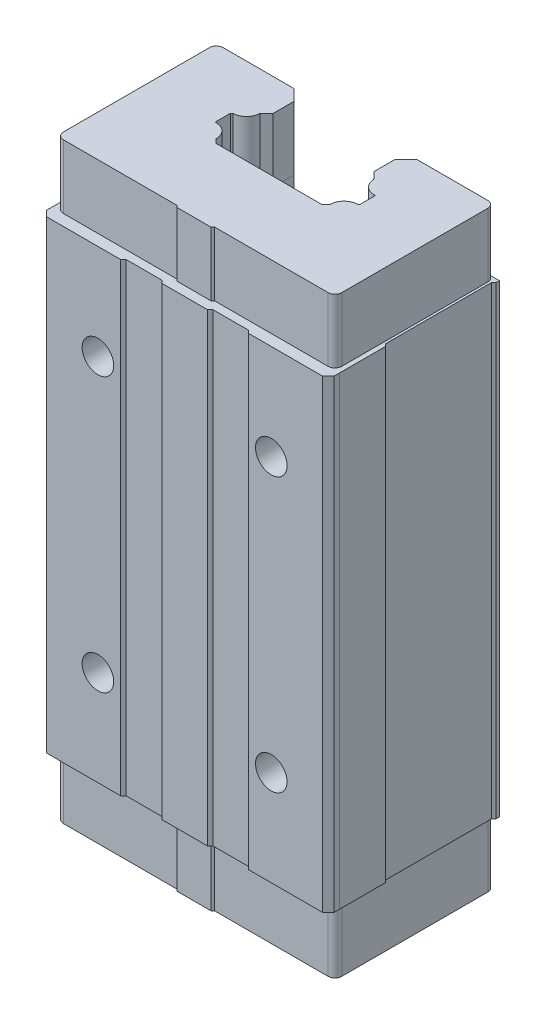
ISO-10303-21;
HEADER;
FILE_DESCRIPTION(('STEP AP214'),'2;1');
FILE_NAME('part.step','',(''),(''),'','','');
FILE_SCHEMA(('AUTOMOTIVE_DESIGN { 1 0 10303 214 1 1 1 1 }'));
ENDSEC;
DATA;
#1=APPLICATION_CONTEXT('core data for automotive mechanical design processes');
#2=APPLICATION_PROTOCOL_DEFINITION('international standard','automotive_design',2000,#1);
#3=PRODUCT_CONTEXT('',#1,'mechanical');
#4=PRODUCT('Part','Part','',(#3));
#5=PRODUCT_RELATED_PRODUCT_CATEGORY('part','',(#4));
#6=PRODUCT_DEFINITION_FORMATION('','',#4);
#7=PRODUCT_DEFINITION_CONTEXT('part definition',#1,'design');
#8=PRODUCT_DEFINITION('design','',#6,#7);
#9=PRODUCT_DEFINITION_SHAPE('','',#8);
#10=(LENGTH_UNIT() NAMED_UNIT(*) SI_UNIT(.MILLI.,.METRE.));
#11=(NAMED_UNIT(*) PLANE_ANGLE_UNIT() SI_UNIT($,.RADIAN.));
#12=(NAMED_UNIT(*) SI_UNIT($,.STERADIAN.) SOLID_ANGLE_UNIT());
#13=UNCERTAINTY_MEASURE_WITH_UNIT(LENGTH_MEASURE(1.E-05),#10,'distance_accuracy_value','');
#14=(GEOMETRIC_REPRESENTATION_CONTEXT(3) GLOBAL_UNCERTAINTY_ASSIGNED_CONTEXT((#13)) GLOBAL_UNIT_ASSIGNED_CONTEXT((#10,
#11,#12)) REPRESENTATION_CONTEXT('',''));
#15=CARTESIAN_POINT('',(0.,0.,0.));
#16=DIRECTION('',(0.,0.,1.));
#17=DIRECTION('',(1.,0.,0.));
#18=AXIS2_PLACEMENT_3D('',#15,#16,#17);
#19=CARTESIAN_POINT('',(0.,101.8,0.));
#20=DIRECTION('',(0.,1.,0.));
#21=DIRECTION('',(1.,0.,0.));
#22=AXIS2_PLACEMENT_3D('',#19,#20,#21);
#23=PLANE('',#22);
#24=CARTESIAN_POINT('',(-30.9898486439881,101.8,-58.1254108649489));
#25=DIRECTION('',(0.,1.,0.));
#26=DIRECTION('',(1.,0.,0.));
#27=AXIS2_PLACEMENT_3D('',#24,#25,#26);
#28=CIRCLE('',#27,6.);
#29=CARTESIAN_POINT('',(-30.9078277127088,101.8,-52.1259284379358));
#30=VERTEX_POINT('',#29);
#31=CARTESIAN_POINT('',(-24.9908745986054,101.8,-58.0112718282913));
#32=VERTEX_POINT('',#31);
#33=EDGE_CURVE('E42',#30,#32,#28,.T.);
#34=ORIENTED_EDGE('',*,*,#33,.F.);
#35=CARTESIAN_POINT('',(-30.9896845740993,101.8,-58.1252726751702));
#36=DIRECTION('',(0.,1.,0.));
#37=DIRECTION('',(0.,0.,1.));
#38=AXIS2_PLACEMENT_3D('',#35,#36,#37);
#39=CIRCLE('',#38,5.99994571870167);
#40=CARTESIAN_POINT('',(-25.5475710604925,101.8,-55.5988623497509));
#41=VERTEX_POINT('',#40);
#42=EDGE_CURVE('E10',#30,#41,#39,.T.);
#43=ORIENTED_EDGE('',*,*,#42,.T.);
#44=CARTESIAN_POINT('',(-30.9897338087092,101.8,-58.1252955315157));
#45=DIRECTION('',(0.,1.,0.));
#46=DIRECTION('',(0.,0.,1.));
#47=AXIS2_PLACEMENT_3D('',#44,#45,#46);
#48=CIRCLE('',#47,6.);
#49=CARTESIAN_POINT('',(-24.9947889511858,101.8,-57.8790514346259));
#50=VERTEX_POINT('',#49);
#51=EDGE_CURVE('E29',#41,#50,#48,.T.);
#52=ORIENTED_EDGE('',*,*,#51,.T.);
#53=CARTESIAN_POINT('',(-30.9897290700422,101.8,-58.1254108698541));
#54=DIRECTION('',(0.,1.,0.));
#55=DIRECTION('',(0.,0.,1.));
#56=AXIS2_PLACEMENT_3D('',#53,#54,#55);
#57=CIRCLE('',#56,6.);
#58=EDGE_CURVE('E995',#50,#32,#57,.T.);
#59=ORIENTED_EDGE('',*,*,#58,.T.);
#60=EDGE_LOOP('',(#34,#43,#52,#59));
#61=FACE_BOUND('',#60,.T.);
#62=ADVANCED_FACE('F16',(#61),#23,.T.);
#63=CARTESIAN_POINT('',(0.,101.8,0.));
#64=DIRECTION('',(0.,1.,0.));
#65=DIRECTION('',(1.,0.,0.));
#66=AXIS2_PLACEMENT_3D('',#63,#64,#65);
#67=PLANE('',#66);
#68=CARTESIAN_POINT('',(-30.9898486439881,101.8,-38.8783685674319));
#69=DIRECTION('',(0.,1.,0.));
#70=DIRECTION('',(-1.,0.,0.));
#71=AXIS2_PLACEMENT_3D('',#68,#69,#70);
#72=CIRCLE('',#71,6.);
#73=CARTESIAN_POINT('',(-24.9938148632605,101.8,-38.6585223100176));
#74=VERTEX_POINT('',#73);
#75=CARTESIAN_POINT('',(-29.9650365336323,101.8,-44.7902007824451));
#76=VERTEX_POINT('',#75);
#77=EDGE_CURVE('E1436',#74,#76,#72,.T.);
#78=ORIENTED_EDGE('',*,*,#77,.F.);
#79=CARTESIAN_POINT('',(-30.9896973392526,101.8,-38.8783683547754));
#80=DIRECTION('',(0.,1.,0.));
#81=DIRECTION('',(0.,0.,1.));
#82=AXIS2_PLACEMENT_3D('',#79,#80,#81);
#83=CIRCLE('',#82,5.99997436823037);
#84=EDGE_CURVE('E1426',#74,#76,#83,.T.);
#85=ORIENTED_EDGE('',*,*,#84,.T.);
#86=EDGE_LOOP('',(#78,#85));
#87=FACE_BOUND('',#86,.T.);
#88=ADVANCED_FACE('F1882',(#87),#67,.T.);
#89=CARTESIAN_POINT('',(0.,101.8,0.));
#90=DIRECTION('',(0.,1.,0.));
#91=DIRECTION('',(1.,0.,0.));
#92=AXIS2_PLACEMENT_3D('',#89,#90,#91);
#93=PLANE('',#92);
#94=DIRECTION('',(-1.,0.,0.));
#95=VECTOR('',#94,1.);
#96=CARTESIAN_POINT('',(-27.0591262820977,101.8,-74.9196795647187));
#97=LINE('',#96,#95);
#98=CARTESIAN_POINT('',(-27.0590613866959,101.8,-74.9197011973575));
#99=VERTEX_POINT('',#98);
#100=CARTESIAN_POINT('',(-58.0161356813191,101.8,-74.9196795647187));
#101=VERTEX_POINT('',#100);
#102=EDGE_CURVE('E1464',#99,#101,#97,.T.);
#103=ORIENTED_EDGE('',*,*,#102,.F.);
#104=DIRECTION('',(-0.707147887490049,0.,-0.70706567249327));
#105=VECTOR('',#104,1.);
#106=CARTESIAN_POINT('',(-22.0997069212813,101.8,-69.9609563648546));
#107=LINE('',#106,#105);
#108=CARTESIAN_POINT('',(-27.1404702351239,101.8,-75.0011336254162));
#109=VERTEX_POINT('',#108);
#110=EDGE_CURVE('E1454',#99,#109,#107,.T.);
#111=ORIENTED_EDGE('',*,*,#110,.T.);
#112=DIRECTION('',(-1.,0.,0.));
#113=VECTOR('',#112,1.);
#114=CARTESIAN_POINT('',(0.,101.8,-75.0011336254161));
#115=LINE('',#114,#113);
#116=CARTESIAN_POINT('',(-63.,101.8,-75.0011336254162));
#117=VERTEX_POINT('',#116);
#118=EDGE_CURVE('E1474',#109,#117,#115,.T.);
#119=ORIENTED_EDGE('',*,*,#118,.T.);
#120=DIRECTION('',(0.,0.,1.));
#121=VECTOR('',#120,1.);
#122=CARTESIAN_POINT('',(-63.,101.8,0.));
#123=LINE('',#122,#121);
#124=CARTESIAN_POINT('',(-63.,101.8,-73.5010173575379));
#125=VERTEX_POINT('',#124);
#126=EDGE_CURVE('E1242',#117,#125,#123,.T.);
#127=ORIENTED_EDGE('',*,*,#126,.T.);
#128=DIRECTION('',(0.707127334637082,0.,0.707086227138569));
#129=VECTOR('',#128,1.);
#130=CARTESIAN_POINT('',(5.25233986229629,101.8,-5.25264521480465));
#131=LINE('',#130,#129);
#132=CARTESIAN_POINT('',(-62.,101.8,-72.50107549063));
#133=VERTEX_POINT('',#132);
#134=EDGE_CURVE('E1189',#125,#133,#131,.T.);
#135=ORIENTED_EDGE('',*,*,#134,.T.);
#136=DIRECTION('',(0.,0.,1.));
#137=VECTOR('',#136,1.);
#138=CARTESIAN_POINT('',(-62.,101.8,0.));
#139=LINE('',#138,#137);
#140=CARTESIAN_POINT('',(-62.,101.8,-40.));
#141=VERTEX_POINT('',#140);
#142=EDGE_CURVE('E1185',#133,#141,#139,.T.);
#143=ORIENTED_EDGE('',*,*,#142,.T.);
#144=DIRECTION('',(-0.707086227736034,0.,0.707127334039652));
#145=VECTOR('',#144,1.);
#146=CARTESIAN_POINT('',(-51.0018020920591,101.8,-50.9988372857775));
#147=LINE('',#146,#145);
#148=CARTESIAN_POINT('',(-63.,101.8,-38.9999418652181));
#149=VERTEX_POINT('',#148);
#150=EDGE_CURVE('E885',#141,#149,#147,.T.);
#151=ORIENTED_EDGE('',*,*,#150,.T.);
#152=DIRECTION('',(0.,0.,1.));
#153=VECTOR('',#152,1.);
#154=CARTESIAN_POINT('',(-63.,101.8,0.));
#155=LINE('',#154,#153);
#156=CARTESIAN_POINT('',(-63.,101.8,-2.5));
#157=VERTEX_POINT('',#156);
#158=EDGE_CURVE('E881',#149,#157,#155,.T.);
#159=ORIENTED_EDGE('',*,*,#158,.T.);
#160=DIRECTION('',(0.707106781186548,0.,0.707106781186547));
#161=VECTOR('',#160,1.);
#162=CARTESIAN_POINT('',(-30.25,101.8,30.25));
#163=LINE('',#162,#161);
#164=CARTESIAN_POINT('',(-60.5,101.8,0.));
#165=VERTEX_POINT('',#164);
#166=EDGE_CURVE('E879',#157,#165,#163,.T.);
#167=ORIENTED_EDGE('',*,*,#166,.T.);
#168=DIRECTION('',(1.,0.,0.));
#169=VECTOR('',#168,1.);
#170=CARTESIAN_POINT('',(-65.,101.8,0.));
#171=LINE('',#170,#169);
#172=CARTESIAN_POINT('',(-27.9999643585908,101.8,0.));
#173=VERTEX_POINT('',#172);
#174=EDGE_CURVE('E875',#165,#173,#171,.T.);
#175=ORIENTED_EDGE('',*,*,#174,.T.);
#176=DIRECTION('',(0.707108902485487,0.,-0.707104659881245));
#177=VECTOR('',#176,1.);
#178=CARTESIAN_POINT('',(-13.9998981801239,101.8,-13.9999821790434));
#179=LINE('',#178,#177);
#180=CARTESIAN_POINT('',(-26.7999571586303,101.8,-1.20000000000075));
#181=VERTEX_POINT('',#180);
#182=EDGE_CURVE('E880',#173,#181,#179,.T.);
#183=ORIENTED_EDGE('',*,*,#182,.T.);
#184=DIRECTION('',(1.,0.,0.));
#185=VECTOR('',#184,1.);
#186=CARTESIAN_POINT('',(0.,101.8,-1.20000000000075));
#187=LINE('',#186,#185);
#188=CARTESIAN_POINT('',(-11.2000079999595,101.8,-1.20000000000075));
#189=VERTEX_POINT('',#188);
#190=EDGE_CURVE('E886',#181,#189,#187,.T.);
#191=ORIENTED_EDGE('',*,*,#190,.T.);
#192=DIRECTION('',(0.707109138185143,0.,0.707104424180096));
#193=VECTOR('',#192,1.);
#194=CARTESIAN_POINT('',(-4.99996666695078,101.8,4.99999999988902));
#195=LINE('',#194,#193);
#196=CARTESIAN_POINT('',(-10.0000000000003,101.8,0.));
#197=VERTEX_POINT('',#196);
#198=EDGE_CURVE('E890',#189,#197,#195,.T.);
#199=ORIENTED_EDGE('',*,*,#198,.T.);
#200=DIRECTION('',(1.,0.,0.));
#201=VECTOR('',#200,1.);
#202=CARTESIAN_POINT('',(-65.,101.8,0.));
#203=LINE('',#202,#201);
#204=CARTESIAN_POINT('',(10.0000000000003,101.8,0.));
#205=VERTEX_POINT('',#204);
#206=EDGE_CURVE('E1109',#197,#205,#203,.T.);
#207=ORIENTED_EDGE('',*,*,#206,.T.);
#208=DIRECTION('',(0.707109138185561,0.,-0.707104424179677));
#209=VECTOR('',#208,1.);
#210=CARTESIAN_POINT('',(4.99996666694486,101.8,4.99999999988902));
#211=LINE('',#210,#209);
#212=CARTESIAN_POINT('',(11.2000079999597,101.8,-1.19999999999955));
#213=VERTEX_POINT('',#212);
#214=EDGE_CURVE('E1235',#205,#213,#211,.T.);
#215=ORIENTED_EDGE('',*,*,#214,.T.);
#216=DIRECTION('',(1.,0.,0.));
#217=VECTOR('',#216,1.);
#218=CARTESIAN_POINT('',(0.,101.8,-1.19999999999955));
#219=LINE('',#218,#217);
#220=CARTESIAN_POINT('',(26.7999571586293,101.8,-1.19999999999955));
#221=VERTEX_POINT('',#220);
#222=EDGE_CURVE('E1184',#213,#221,#219,.T.);
#223=ORIENTED_EDGE('',*,*,#222,.T.);
#224=DIRECTION('',(0.707108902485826,0.,0.707104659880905));
#225=VECTOR('',#224,1.);
#226=CARTESIAN_POINT('',(13.9998981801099,101.8,-13.9999821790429));
#227=LINE('',#226,#225);
#228=CARTESIAN_POINT('',(27.9999643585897,101.8,0.));
#229=VERTEX_POINT('',#228);
#230=EDGE_CURVE('E1145',#221,#229,#227,.T.);
#231=ORIENTED_EDGE('',*,*,#230,.T.);
#232=DIRECTION('',(1.,0.,0.));
#233=VECTOR('',#232,1.);
#234=CARTESIAN_POINT('',(-65.,101.8,0.));
#235=LINE('',#234,#233);
#236=CARTESIAN_POINT('',(60.4,101.8,0.));
#237=VERTEX_POINT('',#236);
#238=EDGE_CURVE('E1141',#229,#237,#235,.T.);
#239=ORIENTED_EDGE('',*,*,#238,.T.);
#240=DIRECTION('',(0.707106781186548,0.,-0.707106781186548));
#241=VECTOR('',#240,1.);
#242=CARTESIAN_POINT('',(30.2,101.8,30.2));
#243=LINE('',#242,#241);
#244=CARTESIAN_POINT('',(63.,101.8,-2.6));
#245=VERTEX_POINT('',#244);
#246=EDGE_CURVE('E1146',#237,#245,#243,.T.);
#247=ORIENTED_EDGE('',*,*,#246,.T.);
#248=DIRECTION('',(0.,0.,-1.));
#249=VECTOR('',#248,1.);
#250=CARTESIAN_POINT('',(63.,101.8,0.));
#251=LINE('',#250,#249);
#252=CARTESIAN_POINT('',(63.,101.8,-4.91938982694));
#253=VERTEX_POINT('',#252);
#254=EDGE_CURVE('E2470',#245,#253,#251,.T.);
#255=ORIENTED_EDGE('',*,*,#254,.T.);
#256=DIRECTION('',(1.,0.,0.));
#257=VECTOR('',#256,1.);
#258=CARTESIAN_POINT('',(0.,101.8,-4.91938982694));
#259=LINE('',#258,#257);
#260=CARTESIAN_POINT('',(63.000293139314,101.8,-4.91938982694));
#261=VERTEX_POINT('',#260);
#262=EDGE_CURVE('E1088',#253,#261,#259,.T.);
#263=ORIENTED_EDGE('',*,*,#262,.T.);
#264=DIRECTION('',(0.,0.,-1.));
#265=VECTOR('',#264,1.);
#266=CARTESIAN_POINT('',(63.000293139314,101.8,0.));
#267=LINE('',#266,#265);
#268=CARTESIAN_POINT('',(63.000293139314,101.8,-24.9996487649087));
#269=VERTEX_POINT('',#268);
#270=EDGE_CURVE('E1084',#261,#269,#267,.T.);
#271=ORIENTED_EDGE('',*,*,#270,.T.);
#272=DIRECTION('',(-0.70716842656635,0.,-0.707045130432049));
#273=VECTOR('',#272,1.);
#274=CARTESIAN_POINT('',(43.9944781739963,101.8,-44.0021500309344));
#275=LINE('',#274,#273);
#276=CARTESIAN_POINT('',(61.9997674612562,101.8,-25.9999999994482));
#277=VERTEX_POINT('',#276);
#278=EDGE_CURVE('E1089',#269,#277,#275,.T.);
#279=ORIENTED_EDGE('',*,*,#278,.T.);
#280=DIRECTION('',(0.,0.,-1.));
#281=VECTOR('',#280,1.);
#282=CARTESIAN_POINT('',(61.9997674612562,101.8,0.));
#283=LINE('',#282,#281);
#284=CARTESIAN_POINT('',(61.9997674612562,101.8,-72.5010754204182));
#285=VERTEX_POINT('',#284);
#286=EDGE_CURVE('E1222',#277,#285,#283,.T.);
#287=ORIENTED_EDGE('',*,*,#286,.T.);
#288=DIRECTION('',(0.707125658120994,0.,-0.707087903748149));
#289=VECTOR('',#288,1.);
#290=CARTESIAN_POINT('',(-5.25230909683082,101.8,-5.25258953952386));
#291=LINE('',#290,#289);
#292=CARTESIAN_POINT('',(63.000293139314,101.8,-73.5015476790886));
#293=VERTEX_POINT('',#292);
#294=EDGE_CURVE('E1284',#285,#293,#291,.T.);
#295=ORIENTED_EDGE('',*,*,#294,.T.);
#296=DIRECTION('',(0.,0.,-1.));
#297=VECTOR('',#296,1.);
#298=CARTESIAN_POINT('',(63.000293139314,101.8,0.));
#299=LINE('',#298,#297);
#300=CARTESIAN_POINT('',(63.000293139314,101.8,-75.0014266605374));
#301=VERTEX_POINT('',#300);
#302=EDGE_CURVE('E1288',#293,#301,#299,.T.);
#303=ORIENTED_EDGE('',*,*,#302,.T.);
#304=DIRECTION('',(-1.,0.,0.));
#305=VECTOR('',#304,1.);
#306=CARTESIAN_POINT('',(0.,101.8,-75.0014266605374));
#307=LINE('',#306,#305);
#308=CARTESIAN_POINT('',(27.1407633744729,101.8,-75.0014266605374));
#309=VERTEX_POINT('',#308);
#310=EDGE_CURVE('E1386',#301,#309,#307,.T.);
#311=ORIENTED_EDGE('',*,*,#310,.T.);
#312=DIRECTION('',(-0.707106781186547,0.,0.707106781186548));
#313=VECTOR('',#312,1.);
#314=CARTESIAN_POINT('',(27.1407633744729,101.8,-75.0014266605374));
#315=LINE('',#314,#313);
#316=CARTESIAN_POINT('',(27.0592518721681,101.8,-74.9199482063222));
#317=VERTEX_POINT('',#316);
#318=EDGE_CURVE('E1390',#309,#317,#315,.T.);
#319=ORIENTED_EDGE('',*,*,#318,.T.);
#320=DIRECTION('',(-1.,0.,0.));
#321=VECTOR('',#320,1.);
#322=CARTESIAN_POINT('',(57.984152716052,101.8,-74.9199698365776));
#323=LINE('',#322,#321);
#324=CARTESIAN_POINT('',(57.984152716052,101.8,-74.9199698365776));
#325=VERTEX_POINT('',#324);
#326=EDGE_CURVE('E1208',#325,#317,#323,.T.);
#327=ORIENTED_EDGE('',*,*,#326,.F.);
#328=CARTESIAN_POINT('',(57.984152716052,101.8,-71.9199698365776));
#329=DIRECTION('',(0.,1.,0.));
#330=DIRECTION('',(1.,0.,0.));
#331=AXIS2_PLACEMENT_3D('',#328,#329,#330);
#332=CIRCLE('',#331,3.);
#333=CARTESIAN_POINT('',(60.984152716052,101.8,-71.9199698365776));
#334=VERTEX_POINT('',#333);
#335=EDGE_CURVE('E896',#334,#325,#332,.T.);
#336=ORIENTED_EDGE('',*,*,#335,.F.);
#337=DIRECTION('',(0.,0.,-1.));
#338=VECTOR('',#337,1.);
#339=CARTESIAN_POINT('',(60.984152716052,101.8,-7.91950516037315));
#340=LINE('',#339,#338);
#341=CARTESIAN_POINT('',(60.984152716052,101.8,-7.91950516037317));
#342=VERTEX_POINT('',#341);
#343=EDGE_CURVE('E1090',#342,#334,#340,.T.);
#344=ORIENTED_EDGE('',*,*,#343,.F.);
#345=CARTESIAN_POINT('',(57.984152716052,101.8,-7.91950516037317));
#346=DIRECTION('',(0.,1.,0.));
#347=DIRECTION('',(-1.,0.,0.));
#348=AXIS2_PLACEMENT_3D('',#345,#346,#347);
#349=CIRCLE('',#348,3.);
#350=CARTESIAN_POINT('',(57.984152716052,101.8,-4.91950516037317));
#351=VERTEX_POINT('',#350);
#352=EDGE_CURVE('E866',#351,#342,#349,.T.);
#353=ORIENTED_EDGE('',*,*,#352,.F.);
#354=DIRECTION('',(1.,0.,0.));
#355=VECTOR('',#354,1.);
#356=CARTESIAN_POINT('',(8.28381561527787,101.8,-4.91950516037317));
#357=LINE('',#356,#355);
#358=CARTESIAN_POINT('',(8.28381561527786,101.8,-4.91950516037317));
#359=VERTEX_POINT('',#358);
#360=EDGE_CURVE('E1020',#359,#351,#357,.T.);
#361=ORIENTED_EDGE('',*,*,#360,.F.);
#362=DIRECTION('',(0.707106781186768,0.,-0.707106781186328));
#363=VECTOR('',#362,1.);
#364=CARTESIAN_POINT('',(7.48381561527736,101.8,-4.11950516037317));
#365=LINE('',#364,#363);
#366=CARTESIAN_POINT('',(7.48381561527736,101.8,-4.11950516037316));
#367=VERTEX_POINT('',#366);
#368=EDGE_CURVE('E912',#367,#359,#365,.T.);
#369=ORIENTED_EDGE('',*,*,#368,.F.);
#370=DIRECTION('',(1.,0.,0.));
#371=VECTOR('',#370,1.);
#372=CARTESIAN_POINT('',(-7.51618438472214,101.8,-4.11950516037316));
#373=LINE('',#372,#371);
#374=CARTESIAN_POINT('',(-7.51618438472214,101.8,-4.11950516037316));
#375=VERTEX_POINT('',#374);
#376=EDGE_CURVE('E1013',#375,#367,#373,.T.);
#377=ORIENTED_EDGE('',*,*,#376,.F.);
#378=DIRECTION('',(0.707106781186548,0.,0.707106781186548));
#379=VECTOR('',#378,1.);
#380=CARTESIAN_POINT('',(-8.31618438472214,101.8,-4.91950516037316));
#381=LINE('',#380,#379);
#382=CARTESIAN_POINT('',(-8.31618438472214,101.8,-4.91950516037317));
#383=VERTEX_POINT('',#382);
#384=EDGE_CURVE('E792',#383,#375,#381,.T.);
#385=ORIENTED_EDGE('',*,*,#384,.F.);
#386=DIRECTION('',(1.,0.,0.));
#387=VECTOR('',#386,1.);
#388=CARTESIAN_POINT('',(-58.0161356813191,101.8,-4.91950516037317));
#389=LINE('',#388,#387);
#390=CARTESIAN_POINT('',(-58.0161356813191,101.8,-4.91950516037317));
#391=VERTEX_POINT('',#390);
#392=EDGE_CURVE('E791',#391,#383,#389,.T.);
#393=ORIENTED_EDGE('',*,*,#392,.F.);
#394=CARTESIAN_POINT('',(-58.0161356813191,101.8,-7.91950516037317));
#395=DIRECTION('',(0.,1.,0.));
#396=DIRECTION('',(1.,0.,0.));
#397=AXIS2_PLACEMENT_3D('',#394,#395,#396);
#398=CIRCLE('',#397,3.);
#399=CARTESIAN_POINT('',(-61.0161356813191,101.8,-7.91950516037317));
#400=VERTEX_POINT('',#399);
#401=EDGE_CURVE('E788',#400,#391,#398,.T.);
#402=ORIENTED_EDGE('',*,*,#401,.F.);
#403=DIRECTION('',(0.,0.,1.));
#404=VECTOR('',#403,1.);
#405=CARTESIAN_POINT('',(-61.0161356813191,101.8,-71.9196795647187));
#406=LINE('',#405,#404);
#407=CARTESIAN_POINT('',(-61.0161356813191,101.8,-71.9196795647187));
#408=VERTEX_POINT('',#407);
#409=EDGE_CURVE('E1311',#408,#400,#406,.T.);
#410=ORIENTED_EDGE('',*,*,#409,.F.);
#411=CARTESIAN_POINT('',(-58.0161356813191,101.8,-71.9196795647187));
#412=DIRECTION('',(0.,1.,0.));
#413=DIRECTION('',(1.,0.,0.));
#414=AXIS2_PLACEMENT_3D('',#411,#412,#413);
#415=CIRCLE('',#414,3.);
#416=EDGE_CURVE('E611',#101,#408,#415,.T.);
#417=ORIENTED_EDGE('',*,*,#416,.F.);
#418=EDGE_LOOP('',(#103,#111,#119,#127,#135,#143,#151,#159,#167,#175,#183,#191,#199,#207,#215,
#223,#231,#239,#247,#255,#263,#271,#279,#287,#295,#303,#311,#319,#327,#336,#344,#353,#361,#369,
#377,#385,#393,#402,#410,#417));
#419=FACE_BOUND('',#418,.T.);
#420=ADVANCED_FACE('F1885',(#419),#93,.T.);
#421=CARTESIAN_POINT('',(0.,-101.8,0.));
#422=DIRECTION('',(0.,1.,0.));
#423=DIRECTION('',(1.,0.,0.));
#424=AXIS2_PLACEMENT_3D('',#421,#422,#423);
#425=PLANE('',#424);
#426=CARTESIAN_POINT('',(30.9901956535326,-101.8,-58.125410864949));
#427=DIRECTION('',(0.,-1.,0.));
#428=DIRECTION('',(1.,0.,0.));
#429=AXIS2_PLACEMENT_3D('',#426,#427,#428);
#430=CIRCLE('',#429,6.00000000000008);
#431=CARTESIAN_POINT('',(31.5002320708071,-101.8,-52.147108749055));
#432=VERTEX_POINT('',#431);
#433=CARTESIAN_POINT('',(29.9433422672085,-101.8,-52.2174418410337));
#434=VERTEX_POINT('',#433);
#435=EDGE_CURVE('E601',#432,#434,#430,.T.);
#436=ORIENTED_EDGE('',*,*,#435,.F.);
#437=CARTESIAN_POINT('',(30.9903457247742,-101.8,-58.1254153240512));
#438=DIRECTION('',(0.,-1.,0.));
#439=DIRECTION('',(0.,0.,1.));
#440=AXIS2_PLACEMENT_3D('',#437,#438,#439);
#441=CIRCLE('',#440,6.00003057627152);
#442=EDGE_CURVE('E1490',#432,#434,#441,.T.);
#443=ORIENTED_EDGE('',*,*,#442,.T.);
#444=EDGE_LOOP('',(#436,#443));
#445=FACE_BOUND('',#444,.T.);
#446=ADVANCED_FACE('F2985',(#445),#425,.F.);
#447=CARTESIAN_POINT('',(0.,-101.8,0.));
#448=DIRECTION('',(0.,1.,0.));
#449=DIRECTION('',(1.,0.,0.));
#450=AXIS2_PLACEMENT_3D('',#447,#448,#449);
#451=PLANE('',#450);
#452=CARTESIAN_POINT('',(-30.9898486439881,-101.8,-38.8783685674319));
#453=DIRECTION('',(0.,-1.,0.));
#454=DIRECTION('',(-1.,0.,0.));
#455=AXIS2_PLACEMENT_3D('',#452,#453,#454);
#456=CIRCLE('',#455,6.);
#457=CARTESIAN_POINT('',(-29.9650365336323,-101.8,-44.7902007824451));
#458=VERTEX_POINT('',#457);
#459=CARTESIAN_POINT('',(-24.9938148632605,-101.8,-38.6585223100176));
#460=VERTEX_POINT('',#459);
#461=EDGE_CURVE('E1526',#458,#460,#456,.T.);
#462=ORIENTED_EDGE('',*,*,#461,.F.);
#463=CARTESIAN_POINT('',(-30.9896973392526,-101.8,-38.8783683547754));
#464=DIRECTION('',(0.,-1.,0.));
#465=DIRECTION('',(0.,0.,1.));
#466=AXIS2_PLACEMENT_3D('',#463,#464,#465);
#467=CIRCLE('',#466,5.99997436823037);
#468=EDGE_CURVE('E1516',#458,#460,#467,.T.);
#469=ORIENTED_EDGE('',*,*,#468,.T.);
#470=EDGE_LOOP('',(#462,#469));
#471=FACE_BOUND('',#470,.T.);
#472=ADVANCED_FACE('F2059',(#471),#451,.F.);
#473=CARTESIAN_POINT('',(0.,-101.8,0.));
#474=DIRECTION('',(0.,1.,0.));
#475=DIRECTION('',(1.,0.,0.));
#476=AXIS2_PLACEMENT_3D('',#473,#474,#475);
#477=PLANE('',#476);
#478=CARTESIAN_POINT('',(-30.9898486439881,-101.8,-58.1254108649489));
#479=DIRECTION('',(0.,-1.,0.));
#480=DIRECTION('',(1.,0.,0.));
#481=AXIS2_PLACEMENT_3D('',#478,#479,#480);
#482=CIRCLE('',#481,6.);
#483=CARTESIAN_POINT('',(-24.9908745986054,-101.8,-58.0112718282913));
#484=VERTEX_POINT('',#483);
#485=CARTESIAN_POINT('',(-30.9078277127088,-101.8,-52.1259284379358));
#486=VERTEX_POINT('',#485);
#487=EDGE_CURVE('E1546',#484,#486,#482,.T.);
#488=ORIENTED_EDGE('',*,*,#487,.F.);
#489=CARTESIAN_POINT('',(-30.9897290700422,-101.8,-58.1254108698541));
#490=DIRECTION('',(0.,-1.,0.));
#491=DIRECTION('',(0.,0.,1.));
#492=AXIS2_PLACEMENT_3D('',#489,#490,#491);
#493=CIRCLE('',#492,6.);
#494=CARTESIAN_POINT('',(-24.9947889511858,-101.8,-57.8790514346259));
#495=VERTEX_POINT('',#494);
#496=EDGE_CURVE('E1170',#484,#495,#493,.T.);
#497=ORIENTED_EDGE('',*,*,#496,.T.);
#498=CARTESIAN_POINT('',(-30.9897338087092,-101.8,-58.1252955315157));
#499=DIRECTION('',(0.,-1.,0.));
#500=DIRECTION('',(0.,0.,1.));
#501=AXIS2_PLACEMENT_3D('',#498,#499,#500);
#502=CIRCLE('',#501,6.);
#503=CARTESIAN_POINT('',(-25.5475710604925,-101.8,-55.5988623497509));
#504=VERTEX_POINT('',#503);
#505=EDGE_CURVE('E1166',#495,#504,#502,.T.);
#506=ORIENTED_EDGE('',*,*,#505,.T.);
#507=CARTESIAN_POINT('',(-30.9896845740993,-101.8,-58.1252726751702));
#508=DIRECTION('',(0.,-1.,0.));
#509=DIRECTION('',(0.,0.,1.));
#510=AXIS2_PLACEMENT_3D('',#507,#508,#509);
#511=CIRCLE('',#510,5.99994571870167);
#512=EDGE_CURVE('E1171',#504,#486,#511,.T.);
#513=ORIENTED_EDGE('',*,*,#512,.T.);
#514=EDGE_LOOP('',(#488,#497,#506,#513));
#515=FACE_BOUND('',#514,.T.);
#516=ADVANCED_FACE('F1903',(#515),#477,.F.);
#517=CARTESIAN_POINT('',(0.,-101.8,0.));
#518=DIRECTION('',(0.,1.,0.));
#519=DIRECTION('',(1.,0.,0.));
#520=AXIS2_PLACEMENT_3D('',#517,#518,#519);
#521=PLANE('',#520);
#522=DIRECTION('',(1.,0.,0.));
#523=VECTOR('',#522,1.);
#524=CARTESIAN_POINT('',(27.0591869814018,-101.8,-74.9199698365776));
#525=LINE('',#524,#523);
#526=CARTESIAN_POINT('',(27.0592518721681,-101.8,-74.9199482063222));
#527=VERTEX_POINT('',#526);
#528=CARTESIAN_POINT('',(57.984152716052,-101.8,-74.9199698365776));
#529=VERTEX_POINT('',#528);
#530=EDGE_CURVE('E1578',#527,#529,#525,.T.);
#531=ORIENTED_EDGE('',*,*,#530,.F.);
#532=DIRECTION('',(0.707106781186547,0.,-0.707106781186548));
#533=VECTOR('',#532,1.);
#534=CARTESIAN_POINT('',(22.1002930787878,-101.8,-69.9609563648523));
#535=LINE('',#534,#533);
#536=CARTESIAN_POINT('',(27.1407633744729,-101.8,-75.0014266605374));
#537=VERTEX_POINT('',#536);
#538=EDGE_CURVE('E1568',#527,#537,#535,.T.);
#539=ORIENTED_EDGE('',*,*,#538,.T.);
#540=DIRECTION('',(1.,0.,0.));
#541=VECTOR('',#540,1.);
#542=CARTESIAN_POINT('',(0.,-101.8,-75.0014266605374));
#543=LINE('',#542,#541);
#544=CARTESIAN_POINT('',(63.000293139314,-101.8,-75.0014266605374));
#545=VERTEX_POINT('',#544);
#546=EDGE_CURVE('E1396',#537,#545,#543,.T.);
#547=ORIENTED_EDGE('',*,*,#546,.T.);
#548=DIRECTION('',(0.,0.,1.));
#549=VECTOR('',#548,1.);
#550=CARTESIAN_POINT('',(63.000293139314,-101.8,0.));
#551=LINE('',#550,#549);
#552=CARTESIAN_POINT('',(63.000293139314,-101.8,-73.5015476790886));
#553=VERTEX_POINT('',#552);
#554=EDGE_CURVE('E1062',#545,#553,#551,.T.);
#555=ORIENTED_EDGE('',*,*,#554,.T.);
#556=DIRECTION('',(-0.707125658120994,0.,0.707087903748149));
#557=VECTOR('',#556,1.);
#558=CARTESIAN_POINT('',(-5.25230909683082,-101.8,-5.25258953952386));
#559=LINE('',#558,#557);
#560=CARTESIAN_POINT('',(61.9997674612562,-101.8,-72.5010754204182));
#561=VERTEX_POINT('',#560);
#562=EDGE_CURVE('E1058',#553,#561,#559,.T.);
#563=ORIENTED_EDGE('',*,*,#562,.T.);
#564=DIRECTION('',(0.,0.,1.));
#565=VECTOR('',#564,1.);
#566=CARTESIAN_POINT('',(61.9997674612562,-101.8,0.));
#567=LINE('',#566,#565);
#568=CARTESIAN_POINT('',(61.9997674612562,-101.8,-25.9999999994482));
#569=VERTEX_POINT('',#568);
#570=EDGE_CURVE('E895',#561,#569,#567,.T.);
#571=ORIENTED_EDGE('',*,*,#570,.T.);
#572=DIRECTION('',(0.70716842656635,0.,0.707045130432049));
#573=VECTOR('',#572,1.);
#574=CARTESIAN_POINT('',(43.9944781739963,-101.8,-44.0021500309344));
#575=LINE('',#574,#573);
#576=CARTESIAN_POINT('',(63.000293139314,-101.8,-24.9996487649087));
#577=VERTEX_POINT('',#576);
#578=EDGE_CURVE('E891',#569,#577,#575,.T.);
#579=ORIENTED_EDGE('',*,*,#578,.T.);
#580=DIRECTION('',(0.,0.,1.));
#581=VECTOR('',#580,1.);
#582=CARTESIAN_POINT('',(63.000293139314,-101.8,0.));
#583=LINE('',#582,#581);
#584=CARTESIAN_POINT('',(63.000293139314,-101.8,-4.91938982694));
#585=VERTEX_POINT('',#584);
#586=EDGE_CURVE('E848',#577,#585,#583,.T.);
#587=ORIENTED_EDGE('',*,*,#586,.T.);
#588=DIRECTION('',(-1.,0.,0.));
#589=VECTOR('',#588,1.);
#590=CARTESIAN_POINT('',(0.,-101.8,-4.91938982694));
#591=LINE('',#590,#589);
#592=CARTESIAN_POINT('',(63.,-101.8,-4.91938982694));
#593=VERTEX_POINT('',#592);
#594=EDGE_CURVE('E844',#585,#593,#591,.T.);
#595=ORIENTED_EDGE('',*,*,#594,.T.);
#596=DIRECTION('',(0.,0.,1.));
#597=VECTOR('',#596,1.);
#598=CARTESIAN_POINT('',(63.,-101.8,0.));
#599=LINE('',#598,#597);
#600=CARTESIAN_POINT('',(63.,-101.8,-2.6));
#601=VERTEX_POINT('',#600);
#602=EDGE_CURVE('E849',#593,#601,#599,.T.);
#603=ORIENTED_EDGE('',*,*,#602,.T.);
#604=DIRECTION('',(-0.707106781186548,0.,0.707106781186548));
#605=VECTOR('',#604,1.);
#606=CARTESIAN_POINT('',(30.2,-101.8,30.2));
#607=LINE('',#606,#605);
#608=CARTESIAN_POINT('',(60.4,-101.8,0.));
#609=VERTEX_POINT('',#608);
#610=EDGE_CURVE('E1267',#601,#609,#607,.T.);
#611=ORIENTED_EDGE('',*,*,#610,.T.);
#612=DIRECTION('',(1.,0.,0.));
#613=VECTOR('',#612,1.);
#614=CARTESIAN_POINT('',(-65.,-101.8,0.));
#615=LINE('',#614,#613);
#616=CARTESIAN_POINT('',(27.9999643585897,-101.8,0.));
#617=VERTEX_POINT('',#616);
#618=EDGE_CURVE('E1266',#617,#609,#615,.T.);
#619=ORIENTED_EDGE('',*,*,#618,.F.);
#620=DIRECTION('',(-0.707108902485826,0.,-0.707104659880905));
#621=VECTOR('',#620,1.);
#622=CARTESIAN_POINT('',(13.9998981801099,-101.8,-13.9999821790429));
#623=LINE('',#622,#621);
#624=CARTESIAN_POINT('',(26.7999571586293,-101.8,-1.19999999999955));
#625=VERTEX_POINT('',#624);
#626=EDGE_CURVE('E837',#617,#625,#623,.T.);
#627=ORIENTED_EDGE('',*,*,#626,.T.);
#628=DIRECTION('',(-1.,0.,0.));
#629=VECTOR('',#628,1.);
#630=CARTESIAN_POINT('',(0.,-101.8,-1.19999999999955));
#631=LINE('',#630,#629);
#632=CARTESIAN_POINT('',(11.2000079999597,-101.8,-1.19999999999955));
#633=VERTEX_POINT('',#632);
#634=EDGE_CURVE('E833',#625,#633,#631,.T.);
#635=ORIENTED_EDGE('',*,*,#634,.T.);
#636=DIRECTION('',(-0.707109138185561,0.,0.707104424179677));
#637=VECTOR('',#636,1.);
#638=CARTESIAN_POINT('',(4.99996666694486,-101.8,4.99999999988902));
#639=LINE('',#638,#637);
#640=CARTESIAN_POINT('',(10.0000000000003,-101.8,0.));
#641=VERTEX_POINT('',#640);
#642=EDGE_CURVE('E838',#633,#641,#639,.T.);
#643=ORIENTED_EDGE('',*,*,#642,.T.);
#644=DIRECTION('',(1.,0.,0.));
#645=VECTOR('',#644,1.);
#646=CARTESIAN_POINT('',(-65.,-101.8,0.));
#647=LINE('',#646,#645);
#648=CARTESIAN_POINT('',(-10.0000000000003,-101.8,0.));
#649=VERTEX_POINT('',#648);
#650=EDGE_CURVE('E1000',#649,#641,#647,.T.);
#651=ORIENTED_EDGE('',*,*,#650,.F.);
#652=DIRECTION('',(-0.707109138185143,0.,-0.707104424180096));
#653=VECTOR('',#652,1.);
#654=CARTESIAN_POINT('',(-4.99996666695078,-101.8,4.99999999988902));
#655=LINE('',#654,#653);
#656=CARTESIAN_POINT('',(-11.2000079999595,-101.8,-1.20000000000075));
#657=VERTEX_POINT('',#656);
#658=EDGE_CURVE('E1072',#649,#657,#655,.T.);
#659=ORIENTED_EDGE('',*,*,#658,.T.);
#660=DIRECTION('',(-1.,0.,0.));
#661=VECTOR('',#660,1.);
#662=CARTESIAN_POINT('',(0.,-101.8,-1.20000000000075));
#663=LINE('',#662,#661);
#664=CARTESIAN_POINT('',(-26.7999571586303,-101.8,-1.20000000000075));
#665=VERTEX_POINT('',#664);
#666=EDGE_CURVE('E1068',#657,#665,#663,.T.);
#667=ORIENTED_EDGE('',*,*,#666,.T.);
#668=DIRECTION('',(-0.707108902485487,0.,0.707104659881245));
#669=VECTOR('',#668,1.);
#670=CARTESIAN_POINT('',(-13.9998981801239,-101.8,-13.9999821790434));
#671=LINE('',#670,#669);
#672=CARTESIAN_POINT('',(-27.9999643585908,-101.8,0.));
#673=VERTEX_POINT('',#672);
#674=EDGE_CURVE('E1073',#665,#673,#671,.T.);
#675=ORIENTED_EDGE('',*,*,#674,.T.);
#676=DIRECTION('',(1.,0.,0.));
#677=VECTOR('',#676,1.);
#678=CARTESIAN_POINT('',(-65.,-101.8,0.));
#679=LINE('',#678,#677);
#680=CARTESIAN_POINT('',(-60.5,-101.8,0.));
#681=VERTEX_POINT('',#680);
#682=EDGE_CURVE('E1034',#681,#673,#679,.T.);
#683=ORIENTED_EDGE('',*,*,#682,.F.);
#684=DIRECTION('',(-0.707106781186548,0.,-0.707106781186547));
#685=VECTOR('',#684,1.);
#686=CARTESIAN_POINT('',(-30.25,-101.8,30.25));
#687=LINE('',#686,#685);
#688=CARTESIAN_POINT('',(-63.,-101.8,-2.5));
#689=VERTEX_POINT('',#688);
#690=EDGE_CURVE('E1150',#681,#689,#687,.T.);
#691=ORIENTED_EDGE('',*,*,#690,.T.);
#692=DIRECTION('',(0.,0.,-1.));
#693=VECTOR('',#692,1.);
#694=CARTESIAN_POINT('',(-63.,-101.8,0.));
#695=LINE('',#694,#693);
#696=CARTESIAN_POINT('',(-63.,-101.8,-38.9999418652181));
#697=VERTEX_POINT('',#696);
#698=EDGE_CURVE('E1154',#689,#697,#695,.T.);
#699=ORIENTED_EDGE('',*,*,#698,.T.);
#700=DIRECTION('',(0.707086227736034,0.,-0.707127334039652));
#701=VECTOR('',#700,1.);
#702=CARTESIAN_POINT('',(-51.0018020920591,-101.8,-50.9988372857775));
#703=LINE('',#702,#701);
#704=CARTESIAN_POINT('',(-62.,-101.8,-40.));
#705=VERTEX_POINT('',#704);
#706=EDGE_CURVE('E1271',#697,#705,#703,.T.);
#707=ORIENTED_EDGE('',*,*,#706,.T.);
#708=DIRECTION('',(0.,0.,-1.));
#709=VECTOR('',#708,1.);
#710=CARTESIAN_POINT('',(-62.,-101.8,0.));
#711=LINE('',#710,#709);
#712=CARTESIAN_POINT('',(-62.,-101.8,-72.50107549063));
#713=VERTEX_POINT('',#712);
#714=EDGE_CURVE('E1275',#705,#713,#711,.T.);
#715=ORIENTED_EDGE('',*,*,#714,.T.);
#716=DIRECTION('',(-0.707127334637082,0.,-0.707086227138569));
#717=VECTOR('',#716,1.);
#718=CARTESIAN_POINT('',(5.25233986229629,-101.8,-5.25264521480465));
#719=LINE('',#718,#717);
#720=CARTESIAN_POINT('',(-63.,-101.8,-73.5010173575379));
#721=VERTEX_POINT('',#720);
#722=EDGE_CURVE('E910',#713,#721,#719,.T.);
#723=ORIENTED_EDGE('',*,*,#722,.T.);
#724=DIRECTION('',(0.,0.,-1.));
#725=VECTOR('',#724,1.);
#726=CARTESIAN_POINT('',(-63.,-101.8,0.));
#727=LINE('',#726,#725);
#728=CARTESIAN_POINT('',(-63.,-101.8,-75.0011336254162));
#729=VERTEX_POINT('',#728);
#730=EDGE_CURVE('E906',#721,#729,#727,.T.);
#731=ORIENTED_EDGE('',*,*,#730,.T.);
#732=DIRECTION('',(1.,0.,0.));
#733=VECTOR('',#732,1.);
#734=CARTESIAN_POINT('',(0.,-101.8,-75.0011336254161));
#735=LINE('',#734,#733);
#736=CARTESIAN_POINT('',(-27.1404702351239,-101.8,-75.0011336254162));
#737=VERTEX_POINT('',#736);
#738=EDGE_CURVE('E911',#729,#737,#735,.T.);
#739=ORIENTED_EDGE('',*,*,#738,.T.);
#740=DIRECTION('',(0.707147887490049,0.,0.70706567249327));
#741=VECTOR('',#740,1.);
#742=CARTESIAN_POINT('',(-27.1404702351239,-101.8,-75.0011336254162));
#743=LINE('',#742,#741);
#744=CARTESIAN_POINT('',(-27.059061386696,-101.8,-74.9197011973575));
#745=VERTEX_POINT('',#744);
#746=EDGE_CURVE('E1600',#737,#745,#743,.T.);
#747=ORIENTED_EDGE('',*,*,#746,.T.);
#748=DIRECTION('',(1.,0.,0.));
#749=VECTOR('',#748,1.);
#750=CARTESIAN_POINT('',(-58.0161356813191,-101.8,-74.9196795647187));
#751=LINE('',#750,#749);
#752=CARTESIAN_POINT('',(-58.0161356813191,-101.8,-74.9196795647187));
#753=VERTEX_POINT('',#752);
#754=EDGE_CURVE('E939',#753,#745,#751,.T.);
#755=ORIENTED_EDGE('',*,*,#754,.F.);
#756=CARTESIAN_POINT('',(-58.0161356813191,-101.8,-71.9196795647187));
#757=DIRECTION('',(0.,-1.,0.));
#758=DIRECTION('',(1.,0.,0.));
#759=AXIS2_PLACEMENT_3D('',#756,#757,#758);
#760=CIRCLE('',#759,3.);
#761=CARTESIAN_POINT('',(-61.0161356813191,-101.8,-71.9196795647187));
#762=VERTEX_POINT('',#761);
#763=EDGE_CURVE('E977',#762,#753,#760,.T.);
#764=ORIENTED_EDGE('',*,*,#763,.F.);
#765=DIRECTION('',(0.,0.,-1.));
#766=VECTOR('',#765,1.);
#767=CARTESIAN_POINT('',(-61.0161356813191,-101.8,-7.91950516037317));
#768=LINE('',#767,#766);
#769=CARTESIAN_POINT('',(-61.0161356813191,-101.8,-7.91950516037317));
#770=VERTEX_POINT('',#769);
#771=EDGE_CURVE('E822',#770,#762,#768,.T.);
#772=ORIENTED_EDGE('',*,*,#771,.F.);
#773=CARTESIAN_POINT('',(-58.0161356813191,-101.8,-7.91950516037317));
#774=DIRECTION('',(0.,-1.,0.));
#775=DIRECTION('',(1.,0.,0.));
#776=AXIS2_PLACEMENT_3D('',#773,#774,#775);
#777=CIRCLE('',#776,3.);
#778=CARTESIAN_POINT('',(-58.0161356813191,-101.8,-4.91950516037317));
#779=VERTEX_POINT('',#778);
#780=EDGE_CURVE('E1115',#779,#770,#777,.T.);
#781=ORIENTED_EDGE('',*,*,#780,.F.);
#782=DIRECTION('',(-1.,0.,0.));
#783=VECTOR('',#782,1.);
#784=CARTESIAN_POINT('',(-8.31618438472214,-101.8,-4.91950516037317));
#785=LINE('',#784,#783);
#786=CARTESIAN_POINT('',(-8.31618438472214,-101.8,-4.91950516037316));
#787=VERTEX_POINT('',#786);
#788=EDGE_CURVE('E1114',#787,#779,#785,.T.);
#789=ORIENTED_EDGE('',*,*,#788,.F.);
#790=DIRECTION('',(-0.707106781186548,0.,-0.707106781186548));
#791=VECTOR('',#790,1.);
#792=CARTESIAN_POINT('',(-7.51618438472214,-101.8,-4.11950516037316));
#793=LINE('',#792,#791);
#794=CARTESIAN_POINT('',(-7.51618438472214,-101.8,-4.11950516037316));
#795=VERTEX_POINT('',#794);
#796=EDGE_CURVE('E1125',#795,#787,#793,.T.);
#797=ORIENTED_EDGE('',*,*,#796,.F.);
#798=DIRECTION('',(-1.,0.,0.));
#799=VECTOR('',#798,1.);
#800=CARTESIAN_POINT('',(7.48381561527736,-101.8,-4.11950516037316));
#801=LINE('',#800,#799);
#802=CARTESIAN_POINT('',(7.48381561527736,-101.8,-4.11950516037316));
#803=VERTEX_POINT('',#802);
#804=EDGE_CURVE('E1006',#803,#795,#801,.T.);
#805=ORIENTED_EDGE('',*,*,#804,.F.);
#806=DIRECTION('',(-0.707106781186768,0.,0.707106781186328));
#807=VECTOR('',#806,1.);
#808=CARTESIAN_POINT('',(8.28381561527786,-101.8,-4.91950516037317));
#809=LINE('',#808,#807);
#810=CARTESIAN_POINT('',(8.28381561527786,-101.8,-4.91950516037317));
#811=VERTEX_POINT('',#810);
#812=EDGE_CURVE('E1012',#811,#803,#809,.T.);
#813=ORIENTED_EDGE('',*,*,#812,.F.);
#814=DIRECTION('',(-1.,0.,0.));
#815=VECTOR('',#814,1.);
#816=CARTESIAN_POINT('',(57.984152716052,-101.8,-4.91950516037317));
#817=LINE('',#816,#815);
#818=CARTESIAN_POINT('',(57.984152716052,-101.8,-4.91950516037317));
#819=VERTEX_POINT('',#818);
#820=EDGE_CURVE('E1102',#819,#811,#817,.T.);
#821=ORIENTED_EDGE('',*,*,#820,.F.);
#822=CARTESIAN_POINT('',(57.984152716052,-101.8,-7.91950516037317));
#823=DIRECTION('',(0.,-1.,0.));
#824=DIRECTION('',(1.,0.,0.));
#825=AXIS2_PLACEMENT_3D('',#822,#823,#824);
#826=CIRCLE('',#825,3.);
#827=CARTESIAN_POINT('',(60.984152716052,-101.8,-7.91950516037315));
#828=VERTEX_POINT('',#827);
#829=EDGE_CURVE('E949',#828,#819,#826,.T.);
#830=ORIENTED_EDGE('',*,*,#829,.F.);
#831=DIRECTION('',(0.,0.,1.));
#832=VECTOR('',#831,1.);
#833=CARTESIAN_POINT('',(60.984152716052,-101.8,-71.9199698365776));
#834=LINE('',#833,#832);
#835=CARTESIAN_POINT('',(60.984152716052,-101.8,-71.9199698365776));
#836=VERTEX_POINT('',#835);
#837=EDGE_CURVE('E1203',#836,#828,#834,.T.);
#838=ORIENTED_EDGE('',*,*,#837,.F.);
#839=CARTESIAN_POINT('',(57.984152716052,-101.8,-71.9199698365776));
#840=DIRECTION('',(0.,-1.,0.));
#841=DIRECTION('',(-1.,0.,0.));
#842=AXIS2_PLACEMENT_3D('',#839,#840,#841);
#843=CIRCLE('',#842,3.);
#844=EDGE_CURVE('E1202',#529,#836,#843,.T.);
#845=ORIENTED_EDGE('',*,*,#844,.F.);
#846=EDGE_LOOP('',(#531,#539,#547,#555,#563,#571,#579,#587,#595,#603,#611,#619,#627,#635,#643,
#651,#659,#667,#675,#683,#691,#699,#707,#715,#723,#731,#739,#747,#755,#764,#772,#781,#789,#797,
#805,#813,#821,#830,#838,#845));
#847=FACE_BOUND('',#846,.T.);
#848=ADVANCED_FACE('F1899',(#847),#521,.F.);
#849=CARTESIAN_POINT('',(-65.,-101.8,0.));
#850=DIRECTION('',(0.,0.,1.));
#851=DIRECTION('',(1.,0.,0.));
#852=AXIS2_PLACEMENT_3D('',#849,#850,#851);
#853=PLANE('',#852);
#854=CARTESIAN_POINT('',(-38.,60.,0.));
#855=DIRECTION('',(0.,0.,-1.));
#856=DIRECTION('',(0.,-1.,0.));
#857=AXIS2_PLACEMENT_3D('',#854,#855,#856);
#858=CIRCLE('',#857,6.9175);
#859=CARTESIAN_POINT('',(-38.,53.0825,0.));
#860=VERTEX_POINT('',#859);
#861=EDGE_CURVE('E1364',#860,#860,#858,.T.);
#862=ORIENTED_EDGE('',*,*,#861,.T.);
#863=EDGE_LOOP('',(#862));
#864=FACE_BOUND('',#863,.T.);
#865=CARTESIAN_POINT('',(-38.,-60.,0.));
#866=DIRECTION('',(0.,0.,-1.));
#867=DIRECTION('',(0.,-1.,0.));
#868=AXIS2_PLACEMENT_3D('',#865,#866,#867);
#869=CIRCLE('',#868,6.9175);
#870=CARTESIAN_POINT('',(-38.,-66.9175,0.));
#871=VERTEX_POINT('',#870);
#872=EDGE_CURVE('E1360',#871,#871,#869,.T.);
#873=ORIENTED_EDGE('',*,*,#872,.T.);
#874=EDGE_LOOP('',(#873));
#875=FACE_BOUND('',#874,.T.);
#876=DIRECTION('',(0.,1.,0.));
#877=VECTOR('',#876,1.);
#878=CARTESIAN_POINT('',(-27.9999643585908,-254.46602916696,0.));
#879=LINE('',#878,#877);
#880=EDGE_CURVE('E1037',#673,#173,#879,.T.);
#881=ORIENTED_EDGE('',*,*,#880,.T.);
#882=ORIENTED_EDGE('',*,*,#174,.F.);
#883=DIRECTION('',(0.,1.,0.));
#884=VECTOR('',#883,1.);
#885=CARTESIAN_POINT('',(-60.5,-254.46602916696,0.));
#886=LINE('',#885,#884);
#887=EDGE_CURVE('E1136',#681,#165,#886,.T.);
#888=ORIENTED_EDGE('',*,*,#887,.F.);
#889=ORIENTED_EDGE('',*,*,#682,.T.);
#890=EDGE_LOOP('',(#881,#882,#888,#889));
#891=FACE_BOUND('',#890,.T.);
#892=ADVANCED_FACE('F1902',(#864,#875,#891),#853,.T.);
#893=CARTESIAN_POINT('',(-65.,-101.8,0.));
#894=DIRECTION('',(0.,0.,1.));
#895=DIRECTION('',(1.,0.,0.));
#896=AXIS2_PLACEMENT_3D('',#893,#894,#895);
#897=PLANE('',#896);
#898=DIRECTION('',(0.,1.,0.));
#899=VECTOR('',#898,1.);
#900=CARTESIAN_POINT('',(10.0000000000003,-254.46602916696,0.));
#901=LINE('',#900,#899);
#902=EDGE_CURVE('E1038',#641,#205,#901,.T.);
#903=ORIENTED_EDGE('',*,*,#902,.T.);
#904=ORIENTED_EDGE('',*,*,#206,.F.);
#905=DIRECTION('',(0.,1.,0.));
#906=VECTOR('',#905,1.);
#907=CARTESIAN_POINT('',(-10.0000000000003,-254.46602916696,0.));
#908=LINE('',#907,#906);
#909=EDGE_CURVE('E922',#649,#197,#908,.T.);
#910=ORIENTED_EDGE('',*,*,#909,.F.);
#911=ORIENTED_EDGE('',*,*,#650,.T.);
#912=EDGE_LOOP('',(#903,#904,#910,#911));
#913=FACE_BOUND('',#912,.T.);
#914=ADVANCED_FACE('F2804',(#913),#897,.T.);
#915=CARTESIAN_POINT('',(-65.,-101.8,0.));
#916=DIRECTION('',(0.,0.,1.));
#917=DIRECTION('',(1.,0.,0.));
#918=AXIS2_PLACEMENT_3D('',#915,#916,#917);
#919=PLANE('',#918);
#920=CARTESIAN_POINT('',(38.,60.,0.));
#921=DIRECTION('',(0.,0.,-1.));
#922=DIRECTION('',(0.,-1.,0.));
#923=AXIS2_PLACEMENT_3D('',#920,#921,#922);
#924=CIRCLE('',#923,6.9175);
#925=CARTESIAN_POINT('',(38.,53.0825,0.));
#926=VERTEX_POINT('',#925);
#927=EDGE_CURVE('E996',#926,#926,#924,.T.);
#928=ORIENTED_EDGE('',*,*,#927,.T.);
#929=EDGE_LOOP('',(#928));
#930=FACE_BOUND('',#929,.T.);
#931=CARTESIAN_POINT('',(38.,-60.,0.));
#932=DIRECTION('',(0.,0.,-1.));
#933=DIRECTION('',(0.,-1.,0.));
#934=AXIS2_PLACEMENT_3D('',#931,#932,#933);
#935=CIRCLE('',#934,6.9175);
#936=CARTESIAN_POINT('',(38.,-66.9175,0.));
#937=VERTEX_POINT('',#936);
#938=EDGE_CURVE('E1001',#937,#937,#935,.T.);
#939=ORIENTED_EDGE('',*,*,#938,.T.);
#940=EDGE_LOOP('',(#939));
#941=FACE_BOUND('',#940,.T.);
#942=DIRECTION('',(0.,1.,0.));
#943=VECTOR('',#942,1.);
#944=CARTESIAN_POINT('',(60.4,-254.46602916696,0.));
#945=LINE('',#944,#943);
#946=EDGE_CURVE('E1024',#609,#237,#945,.T.);
#947=ORIENTED_EDGE('',*,*,#946,.T.);
#948=ORIENTED_EDGE('',*,*,#238,.F.);
#949=DIRECTION('',(0.,1.,0.));
#950=VECTOR('',#949,1.);
#951=CARTESIAN_POINT('',(27.9999643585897,-254.46602916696,0.));
#952=LINE('',#951,#950);
#953=EDGE_CURVE('E855',#617,#229,#952,.T.);
#954=ORIENTED_EDGE('',*,*,#953,.F.);
#955=ORIENTED_EDGE('',*,*,#618,.T.);
#956=EDGE_LOOP('',(#947,#948,#954,#955));
#957=FACE_BOUND('',#956,.T.);
#958=ADVANCED_FACE('F2253',(#930,#941,#957),#919,.T.);
#959=CARTESIAN_POINT('',(-60.5,-254.46602916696,0.));
#960=DIRECTION('',(0.707106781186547,0.,-0.707106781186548));
#961=DIRECTION('',(0.,-1.,0.));
#962=AXIS2_PLACEMENT_3D('',#959,#960,#961);
#963=PLANE('',#962);
#964=ORIENTED_EDGE('',*,*,#887,.T.);
#965=ORIENTED_EDGE('',*,*,#166,.F.);
#966=DIRECTION('',(0.,1.,0.));
#967=VECTOR('',#966,1.);
#968=CARTESIAN_POINT('',(-63.,-254.46602916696,-2.5));
#969=LINE('',#968,#967);
#970=EDGE_CURVE('E982',#689,#157,#969,.T.);
#971=ORIENTED_EDGE('',*,*,#970,.F.);
#972=ORIENTED_EDGE('',*,*,#690,.F.);
#973=EDGE_LOOP('',(#964,#965,#971,#972));
#974=FACE_BOUND('',#973,.T.);
#975=ADVANCED_FACE('F2381',(#974),#963,.F.);
#976=CARTESIAN_POINT('',(63.,-254.46602916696,-2.6));
#977=DIRECTION('',(-0.707106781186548,0.,-0.707106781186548));
#978=DIRECTION('',(-0.707106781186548,0.,0.707106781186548));
#979=AXIS2_PLACEMENT_3D('',#976,#977,#978);
#980=PLANE('',#979);
#981=DIRECTION('',(0.,1.,0.));
#982=VECTOR('',#981,1.);
#983=CARTESIAN_POINT('',(63.,-254.46602916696,-2.6));
#984=LINE('',#983,#982);
#985=EDGE_CURVE('E1132',#601,#245,#984,.T.);
#986=ORIENTED_EDGE('',*,*,#985,.T.);
#987=ORIENTED_EDGE('',*,*,#246,.F.);
#988=ORIENTED_EDGE('',*,*,#946,.F.);
#989=ORIENTED_EDGE('',*,*,#610,.F.);
#990=EDGE_LOOP('',(#986,#987,#988,#989));
#991=FACE_BOUND('',#990,.T.);
#992=ADVANCED_FACE('F2384',(#991),#980,.F.);
#993=CARTESIAN_POINT('',(27.1407633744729,-254.46602916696,-75.0014266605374));
#994=DIRECTION('',(0.,0.,1.));
#995=DIRECTION('',(1.,0.,0.));
#996=AXIS2_PLACEMENT_3D('',#993,#994,#995);
#997=PLANE('',#996);
#998=DIRECTION('',(0.,1.,0.));
#999=VECTOR('',#998,1.);
#1000=CARTESIAN_POINT('',(27.1407633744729,-254.46602916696,-75.0014266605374));
#1001=LINE('',#1000,#999);
#1002=EDGE_CURVE('E1137',#537,#309,#1001,.T.);
#1003=ORIENTED_EDGE('',*,*,#1002,.T.);
#1004=ORIENTED_EDGE('',*,*,#310,.F.);
#1005=DIRECTION('',(0.,1.,0.));
#1006=VECTOR('',#1005,1.);
#1007=CARTESIAN_POINT('',(63.000293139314,-254.46602916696,-75.0014266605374));
#1008=LINE('',#1007,#1006);
#1009=EDGE_CURVE('E917',#545,#301,#1008,.T.);
#1010=ORIENTED_EDGE('',*,*,#1009,.F.);
#1011=ORIENTED_EDGE('',*,*,#546,.F.);
#1012=EDGE_LOOP('',(#1003,#1004,#1010,#1011));
#1013=FACE_BOUND('',#1012,.T.);
#1014=ADVANCED_FACE('F2395',(#1013),#997,.F.);
#1015=CARTESIAN_POINT('',(22.1002930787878,-254.46602916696,-69.9609563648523));
#1016=DIRECTION('',(0.707106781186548,0.,0.707106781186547));
#1017=DIRECTION('',(0.,-1.,0.));
#1018=AXIS2_PLACEMENT_3D('',#1015,#1016,#1017);
#1019=PLANE('',#1018);
#1020=DIRECTION('',(0.,1.,0.));
#1021=VECTOR('',#1020,1.);
#1022=CARTESIAN_POINT('',(22.1002930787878,-254.46602916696,-69.9609563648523));
#1023=LINE('',#1022,#1021);
#1024=CARTESIAN_POINT('',(22.1002332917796,-101.8,-69.9609563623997));
#1025=VERTEX_POINT('',#1024);
#1026=CARTESIAN_POINT('',(22.1002332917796,101.8,-69.9609563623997));
#1027=VERTEX_POINT('',#1026);
#1028=EDGE_CURVE('E1613',#1025,#1027,#1023,.T.);
#1029=ORIENTED_EDGE('',*,*,#1028,.T.);
#1030=CARTESIAN_POINT('',(27.0592086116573,101.8,-74.9199914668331));
#1031=DIRECTION('',(-0.707106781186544,0.,0.707106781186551));
#1032=VECTOR('',#1031,1.);
#1033=LINE('',#1030,#1032);
#1034=EDGE_CURVE('E1209',#317,#1027,#1033,.T.);
#1035=ORIENTED_EDGE('',*,*,#1034,.F.);
#1036=ORIENTED_EDGE('',*,*,#318,.F.);
#1037=ORIENTED_EDGE('',*,*,#1002,.F.);
#1038=ORIENTED_EDGE('',*,*,#538,.F.);
#1039=CARTESIAN_POINT('',(22.1002332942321,-101.8,-69.9610161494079));
#1040=DIRECTION('',(0.707106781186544,0.,-0.707106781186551));
#1041=VECTOR('',#1040,1.);
#1042=LINE('',#1039,#1041);
#1043=EDGE_CURVE('E1300',#1025,#527,#1042,.T.);
#1044=ORIENTED_EDGE('',*,*,#1043,.F.);
#1045=EDGE_LOOP('',(#1029,#1035,#1036,#1037,#1038,#1044));
#1046=FACE_BOUND('',#1045,.T.);
#1047=ADVANCED_FACE('F2113',(#1046),#1019,.F.);
#1048=CARTESIAN_POINT('',(22.1002930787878,-254.46602916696,-61.5237000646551));
#1049=DIRECTION('',(1.,0.,0.));
#1050=DIRECTION('',(0.,1.,0.));
#1051=AXIS2_PLACEMENT_3D('',#1048,#1049,#1050);
#1052=PLANE('',#1051);
#1053=DIRECTION('',(0.,1.,0.));
#1054=VECTOR('',#1053,1.);
#1055=CARTESIAN_POINT('',(22.1002930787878,-254.46602916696,-61.5237000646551));
#1056=LINE('',#1055,#1054);
#1057=CARTESIAN_POINT('',(22.1002332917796,-101.8,-61.5237000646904));
#1058=VERTEX_POINT('',#1057);
#1059=CARTESIAN_POINT('',(22.1002332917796,101.8,-61.5237000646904));
#1060=VERTEX_POINT('',#1059);
#1061=EDGE_CURVE('E1617',#1058,#1060,#1056,.T.);
#1062=ORIENTED_EDGE('',*,*,#1061,.T.);
#1063=CARTESIAN_POINT('',(22.1001735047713,101.8,-69.9609563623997));
#1064=DIRECTION('',(0.,0.,1.));
#1065=VECTOR('',#1064,1.);
#1066=LINE('',#1063,#1065);
#1067=EDGE_CURVE('E1497',#1027,#1060,#1066,.T.);
#1068=ORIENTED_EDGE('',*,*,#1067,.F.);
#1069=ORIENTED_EDGE('',*,*,#1028,.F.);
#1070=CARTESIAN_POINT('',(22.1001735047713,-101.8,-61.5237000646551));
#1071=DIRECTION('',(0.,0.,-1.));
#1072=VECTOR('',#1071,1.);
#1073=LINE('',#1070,#1072);
#1074=EDGE_CURVE('E1299',#1058,#1025,#1073,.T.);
#1075=ORIENTED_EDGE('',*,*,#1074,.F.);
#1076=EDGE_LOOP('',(#1062,#1068,#1069,#1075));
#1077=FACE_BOUND('',#1076,.T.);
#1078=ADVANCED_FACE('F2287',(#1077),#1052,.F.);
#1079=CARTESIAN_POINT('',(23.6002930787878,-254.46602916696,-61.5237000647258));
#1080=DIRECTION('',(0.,1.,0.));
#1081=DIRECTION('',(0.,0.,1.));
#1082=AXIS2_PLACEMENT_3D('',#1079,#1080,#1081);
#1083=CYLINDRICAL_SURFACE('',#1082,1.5);
#1084=DIRECTION('',(0.,1.,0.));
#1085=VECTOR('',#1084,1.);
#1086=CARTESIAN_POINT('',(22.5396206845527,-254.46602916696,-60.4630521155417));
#1087=LINE('',#1086,#1085);
#1088=CARTESIAN_POINT('',(22.5395911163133,-101.8,-60.4630158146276));
#1089=VERTEX_POINT('',#1088);
#1090=CARTESIAN_POINT('',(22.5395911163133,101.8,-60.4630158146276));
#1091=VERTEX_POINT('',#1090);
#1092=EDGE_CURVE('E1641',#1089,#1091,#1087,.T.);
#1093=ORIENTED_EDGE('',*,*,#1092,.T.);
#1094=CARTESIAN_POINT('',(23.6002930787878,101.8,-61.5237000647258));
#1095=DIRECTION('',(0.,1.,0.));
#1096=DIRECTION('',(0.,0.,1.));
#1097=AXIS2_PLACEMENT_3D('',#1094,#1095,#1096);
#1098=CIRCLE('',#1097,1.5);
#1099=EDGE_CURVE('E1327',#1060,#1091,#1098,.T.);
#1100=ORIENTED_EDGE('',*,*,#1099,.F.);
#1101=ORIENTED_EDGE('',*,*,#1061,.F.);
#1102=CARTESIAN_POINT('',(23.6002930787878,-101.8,-61.5237000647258));
#1103=DIRECTION('',(0.,-1.,0.));
#1104=DIRECTION('',(0.,0.,1.));
#1105=AXIS2_PLACEMENT_3D('',#1102,#1103,#1104);
#1106=CIRCLE('',#1105,1.5);
#1107=EDGE_CURVE('E1280',#1089,#1058,#1106,.T.);
#1108=ORIENTED_EDGE('',*,*,#1107,.F.);
#1109=EDGE_LOOP('',(#1093,#1100,#1101,#1108));
#1110=FACE_BOUND('',#1109,.T.);
#1111=ADVANCED_FACE('F2112',(#1110),#1083,.T.);
#1112=CARTESIAN_POINT('',(24.9914020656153,-254.46602916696,-58.0112142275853));
#1113=DIRECTION('',(0.707114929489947,0.,-0.707098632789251));
#1114=DIRECTION('',(0.,-1.,0.));
#1115=AXIS2_PLACEMENT_3D('',#1112,#1113,#1114);
#1116=PLANE('',#1115);
#1117=DIRECTION('',(0.,1.,0.));
#1118=VECTOR('',#1117,1.);
#1119=CARTESIAN_POINT('',(24.9914020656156,-254.46602916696,-58.0112142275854));
#1120=LINE('',#1119,#1118);
#1121=CARTESIAN_POINT('',(24.9913417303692,-101.8,-58.0112430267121));
#1122=VERTEX_POINT('',#1121);
#1123=CARTESIAN_POINT('',(24.9913417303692,101.8,-58.0112430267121));
#1124=VERTEX_POINT('',#1123);
#1125=EDGE_CURVE('E1510',#1122,#1124,#1120,.T.);
#1126=ORIENTED_EDGE('',*,*,#1125,.T.);
#1127=CARTESIAN_POINT('',(22.5395642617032,101.8,-60.4629889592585));
#1128=DIRECTION('',(0.707106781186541,0.,0.707106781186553));
#1129=VECTOR('',#1128,1.);
#1130=LINE('',#1127,#1129);
#1131=EDGE_CURVE('E1670',#1091,#1124,#1130,.T.);
#1132=ORIENTED_EDGE('',*,*,#1131,.F.);
#1133=ORIENTED_EDGE('',*,*,#1092,.F.);
#1134=CARTESIAN_POINT('',(24.9913259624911,-101.8,-58.0112272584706));
#1135=DIRECTION('',(-0.707106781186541,0.,-0.707106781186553));
#1136=VECTOR('',#1135,1.);
#1137=LINE('',#1134,#1136);
#1138=EDGE_CURVE('E1523',#1122,#1089,#1137,.T.);
#1139=ORIENTED_EDGE('',*,*,#1138,.F.);
#1140=EDGE_LOOP('',(#1126,#1132,#1133,#1139));
#1141=FACE_BOUND('',#1140,.T.);
#1142=ADVANCED_FACE('F2101',(#1141),#1116,.F.);
#1143=CARTESIAN_POINT('',(30.9903457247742,-254.46602916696,-58.1254153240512));
#1144=DIRECTION('',(0.,1.,0.));
#1145=DIRECTION('',(0.,0.,1.));
#1146=AXIS2_PLACEMENT_3D('',#1143,#1144,#1145);
#1147=CYLINDRICAL_SURFACE('',#1146,6.00003057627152);
#1148=DIRECTION('',(0.,1.,0.));
#1149=VECTOR('',#1148,1.);
#1150=CARTESIAN_POINT('',(31.5002906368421,-254.46602916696,-52.147094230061));
#1151=LINE('',#1150,#1149);
#1152=CARTESIAN_POINT('',(31.5002320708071,101.8,-52.1471087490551));
#1153=VERTEX_POINT('',#1152);
#1154=EDGE_CURVE('E1506',#432,#1153,#1151,.T.);
#1155=ORIENTED_EDGE('',*,*,#1154,.T.);
#1156=CARTESIAN_POINT('',(30.9901956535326,101.8,-58.125410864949));
#1157=DIRECTION('',(0.,1.,0.));
#1158=DIRECTION('',(-0.174475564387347,0.,0.984661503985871));
#1159=AXIS2_PLACEMENT_3D('',#1156,#1157,#1158);
#1160=CIRCLE('',#1159,6.00000000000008);
#1161=CARTESIAN_POINT('',(29.9433422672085,101.8,-52.2174418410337));
#1162=VERTEX_POINT('',#1161);
#1163=EDGE_CURVE('E1684',#1162,#1153,#1160,.T.);
#1164=ORIENTED_EDGE('',*,*,#1163,.F.);
#1165=CARTESIAN_POINT('',(30.9903457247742,101.8,-58.1254153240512));
#1166=DIRECTION('',(0.,1.,0.));
#1167=DIRECTION('',(0.,0.,1.));
#1168=AXIS2_PLACEMENT_3D('',#1165,#1166,#1167);
#1169=CIRCLE('',#1168,6.00003057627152);
#1170=EDGE_CURVE('E1635',#1124,#1162,#1169,.T.);
#1171=ORIENTED_EDGE('',*,*,#1170,.F.);
#1172=ORIENTED_EDGE('',*,*,#1125,.F.);
#1173=CARTESIAN_POINT('',(30.9903457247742,-101.8,-58.1254153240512));
#1174=DIRECTION('',(0.,-1.,0.));
#1175=DIRECTION('',(0.,0.,1.));
#1176=AXIS2_PLACEMENT_3D('',#1173,#1174,#1175);
#1177=CIRCLE('',#1176,6.00003057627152);
#1178=EDGE_CURVE('E1652',#434,#1122,#1177,.T.);
#1179=ORIENTED_EDGE('',*,*,#1178,.F.);
#1180=ORIENTED_EDGE('',*,*,#442,.F.);
#1181=EDGE_LOOP('',(#1155,#1164,#1171,#1172,#1179,#1180));
#1182=FACE_BOUND('',#1181,.T.);
#1183=ADVANCED_FACE('F2111',(#1182),#1147,.T.);
#1184=CARTESIAN_POINT('',(31.5002930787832,-254.46602916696,-45.4697450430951));
#1185=DIRECTION('',(0.999999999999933,0.,-3.65705156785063E-07));
#1186=DIRECTION('',(0.,-1.,0.));
#1187=AXIS2_PLACEMENT_3D('',#1184,#1185,#1186);
#1188=PLANE('',#1187);
#1189=DIRECTION('',(0.,1.,0.));
#1190=VECTOR('',#1189,1.);
#1191=CARTESIAN_POINT('',(31.5002930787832,-254.46602916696,-45.4697450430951));
#1192=LINE('',#1191,#1190);
#1193=CARTESIAN_POINT('',(31.5002332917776,-101.8,-45.4697450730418));
#1194=VERTEX_POINT('',#1193);
#1195=CARTESIAN_POINT('',(31.5002332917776,101.8,-45.4697450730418));
#1196=VERTEX_POINT('',#1195);
#1197=EDGE_CURVE('E1511',#1194,#1196,#1192,.T.);
#1198=ORIENTED_EDGE('',*,*,#1197,.T.);
#1199=CARTESIAN_POINT('',(31.500173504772,101.8,-52.147094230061));
#1200=DIRECTION('',(0.,0.,1.));
#1201=VECTOR('',#1200,1.);
#1202=LINE('',#1199,#1201);
#1203=EDGE_CURVE('E1701',#1153,#1196,#1202,.T.);
#1204=ORIENTED_EDGE('',*,*,#1203,.F.);
#1205=ORIENTED_EDGE('',*,*,#1154,.F.);
#1206=CARTESIAN_POINT('',(31.500173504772,-101.8,-45.4697450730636));
#1207=DIRECTION('',(0.,0.,-1.));
#1208=VECTOR('',#1207,1.);
#1209=LINE('',#1206,#1208);
#1210=EDGE_CURVE('E1741',#1194,#432,#1209,.T.);
#1211=ORIENTED_EDGE('',*,*,#1210,.F.);
#1212=EDGE_LOOP('',(#1198,#1204,#1205,#1211));
#1213=FACE_BOUND('',#1212,.T.);
#1214=ADVANCED_FACE('F2216',(#1213),#1188,.F.);
#1215=CARTESIAN_POINT('',(30.9083579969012,-254.46602916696,-44.8777223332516));
#1216=DIRECTION('',(0.707159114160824,0.,0.707054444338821));
#1217=DIRECTION('',(0.,-1.,0.));
#1218=AXIS2_PLACEMENT_3D('',#1215,#1216,#1217);
#1219=PLANE('',#1218);
#1220=DIRECTION('',(0.,1.,0.));
#1221=VECTOR('',#1220,1.);
#1222=CARTESIAN_POINT('',(30.9083579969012,-254.46602916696,-44.8777223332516));
#1223=LINE('',#1222,#1221);
#1224=CARTESIAN_POINT('',(30.9082997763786,-101.8,-44.877765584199));
#1225=VERTEX_POINT('',#1224);
#1226=CARTESIAN_POINT('',(30.9082997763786,101.8,-44.877765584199));
#1227=VERTEX_POINT('',#1226);
#1228=EDGE_CURVE('E1046',#1225,#1227,#1223,.T.);
#1229=ORIENTED_EDGE('',*,*,#1228,.T.);
#1230=CARTESIAN_POINT('',(31.500203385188,101.8,-45.4697749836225));
#1231=DIRECTION('',(-0.707104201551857,0.,0.707109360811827));
#1232=VECTOR('',#1231,1.);
#1233=LINE('',#1230,#1232);
#1234=EDGE_CURVE('E1723',#1196,#1227,#1233,.T.);
#1235=ORIENTED_EDGE('',*,*,#1234,.F.);
#1236=ORIENTED_EDGE('',*,*,#1197,.F.);
#1237=CARTESIAN_POINT('',(30.9082565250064,-101.8,-44.877823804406));
#1238=DIRECTION('',(0.707104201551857,0.,-0.707109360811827));
#1239=VECTOR('',#1238,1.);
#1240=LINE('',#1237,#1239);
#1241=EDGE_CURVE('E854',#1225,#1194,#1240,.T.);
#1242=ORIENTED_EDGE('',*,*,#1241,.F.);
#1243=EDGE_LOOP('',(#1229,#1235,#1236,#1242));
#1244=FACE_BOUND('',#1243,.T.);
#1245=ADVANCED_FACE('F1918',(#1244),#1219,.F.);
#1246=CARTESIAN_POINT('',(30.9903638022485,-254.46602916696,-38.8782284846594));
#1247=DIRECTION('',(0.,1.,0.));
#1248=DIRECTION('',(0.,0.,1.));
#1249=AXIS2_PLACEMENT_3D('',#1246,#1247,#1248);
#1250=CYLINDRICAL_SURFACE('',#1249,6.00005428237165);
#1251=DIRECTION('',(0.,1.,0.));
#1252=VECTOR('',#1251,1.);
#1253=CARTESIAN_POINT('',(24.9953703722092,-254.46602916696,-39.1246126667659));
#1254=LINE('',#1253,#1252);
#1255=CARTESIAN_POINT('',(24.9953703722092,-101.8,-39.1246126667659));
#1256=VERTEX_POINT('',#1255);
#1257=CARTESIAN_POINT('',(24.9953703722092,101.8,-39.1246126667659));
#1258=VERTEX_POINT('',#1257);
#1259=EDGE_CURVE('E1042',#1256,#1258,#1254,.T.);
#1260=ORIENTED_EDGE('',*,*,#1259,.T.);
#1261=CARTESIAN_POINT('',(30.9903638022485,101.8,-38.8782284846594));
#1262=DIRECTION('',(0.,1.,0.));
#1263=DIRECTION('',(0.,0.,1.));
#1264=AXIS2_PLACEMENT_3D('',#1261,#1262,#1263);
#1265=CIRCLE('',#1264,6.00005428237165);
#1266=EDGE_CURVE('E963',#1227,#1258,#1265,.T.);
#1267=ORIENTED_EDGE('',*,*,#1266,.F.);
#1268=ORIENTED_EDGE('',*,*,#1228,.F.);
#1269=CARTESIAN_POINT('',(30.9903638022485,-101.8,-38.8782284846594));
#1270=DIRECTION('',(0.,-1.,0.));
#1271=DIRECTION('',(0.,0.,1.));
#1272=AXIS2_PLACEMENT_3D('',#1269,#1270,#1271);
#1273=CIRCLE('',#1272,6.00005428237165);
#1274=EDGE_CURVE('E1281',#1256,#1225,#1273,.T.);
#1275=ORIENTED_EDGE('',*,*,#1274,.F.);
#1276=EDGE_LOOP('',(#1260,#1267,#1268,#1275));
#1277=FACE_BOUND('',#1276,.T.);
#1278=ADVANCED_FACE('F2170',(#1277),#1250,.T.);
#1279=CARTESIAN_POINT('',(30.9903152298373,-254.46602916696,-38.8783685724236));
#1280=DIRECTION('',(0.,1.,0.));
#1281=DIRECTION('',(0.,0.,1.));
#1282=AXIS2_PLACEMENT_3D('',#1279,#1280,#1281);
#1283=CYLINDRICAL_SURFACE('',#1282,6.);
#1284=DIRECTION('',(0.,1.,0.));
#1285=VECTOR('',#1284,1.);
#1286=CARTESIAN_POINT('',(24.9943458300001,-254.46602916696,-38.6584800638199));
#1287=LINE('',#1286,#1285);
#1288=CARTESIAN_POINT('',(24.9943458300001,-101.8,-38.6584800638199));
#1289=VERTEX_POINT('',#1288);
#1290=CARTESIAN_POINT('',(24.9943458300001,101.8,-38.6584800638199));
#1291=VERTEX_POINT('',#1290);
#1292=EDGE_CURVE('E1047',#1289,#1291,#1287,.T.);
#1293=ORIENTED_EDGE('',*,*,#1292,.T.);
#1294=CARTESIAN_POINT('',(30.9903152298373,101.8,-38.8783685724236));
#1295=DIRECTION('',(0.,1.,0.));
#1296=DIRECTION('',(0.,0.,1.));
#1297=AXIS2_PLACEMENT_3D('',#1294,#1295,#1296);
#1298=CIRCLE('',#1297,6.);
#1299=EDGE_CURVE('E960',#1258,#1291,#1298,.T.);
#1300=ORIENTED_EDGE('',*,*,#1299,.F.);
#1301=ORIENTED_EDGE('',*,*,#1259,.F.);
#1302=CARTESIAN_POINT('',(30.9903152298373,-101.8,-38.8783685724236));
#1303=DIRECTION('',(0.,-1.,0.));
#1304=DIRECTION('',(0.,0.,1.));
#1305=AXIS2_PLACEMENT_3D('',#1302,#1303,#1304);
#1306=CIRCLE('',#1305,6.);
#1307=EDGE_CURVE('E1276',#1289,#1256,#1306,.T.);
#1308=ORIENTED_EDGE('',*,*,#1307,.F.);
#1309=EDGE_LOOP('',(#1293,#1300,#1301,#1308));
#1310=FACE_BOUND('',#1309,.T.);
#1311=ADVANCED_FACE('F2173',(#1310),#1283,.T.);
#1312=CARTESIAN_POINT('',(23.3382434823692,-254.46602916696,-37.0023777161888));
#1313=DIRECTION('',(0.707106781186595,0.,0.7071067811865));
#1314=DIRECTION('',(0.,-1.,0.));
#1315=AXIS2_PLACEMENT_3D('',#1312,#1313,#1314);
#1316=PLANE('',#1315);
#1317=DIRECTION('',(0.,1.,0.));
#1318=VECTOR('',#1317,1.);
#1319=CARTESIAN_POINT('',(23.3382434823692,-254.46602916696,-37.0023777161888));
#1320=LINE('',#1319,#1318);
#1321=CARTESIAN_POINT('',(23.3382434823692,-129.8,-37.0023777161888));
#1322=VERTEX_POINT('',#1321);
#1323=CARTESIAN_POINT('',(23.3382434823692,129.8,-37.0023777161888));
#1324=VERTEX_POINT('',#1323);
#1325=EDGE_CURVE('E927',#1322,#1324,#1320,.T.);
#1326=ORIENTED_EDGE('',*,*,#1325,.T.);
#1327=DIRECTION('',(-0.707106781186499,0.,0.707106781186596));
#1328=VECTOR('',#1327,1.);
#1329=CARTESIAN_POINT('',(24.9942304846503,129.8,-38.6583647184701));
#1330=LINE('',#1329,#1328);
#1331=CARTESIAN_POINT('',(24.9942304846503,129.8,-38.6583647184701));
#1332=VERTEX_POINT('',#1331);
#1333=EDGE_CURVE('E2531',#1332,#1324,#1330,.T.);
#1334=ORIENTED_EDGE('',*,*,#1333,.F.);
#1335=DIRECTION('',(0.,-1.,0.));
#1336=VECTOR('',#1335,1.);
#1337=CARTESIAN_POINT('',(24.9942304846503,129.8,-38.6583647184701));
#1338=LINE('',#1337,#1336);
#1339=CARTESIAN_POINT('',(24.9942304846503,101.8,-38.6583647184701));
#1340=VERTEX_POINT('',#1339);
#1341=EDGE_CURVE('E923',#1332,#1340,#1338,.T.);
#1342=ORIENTED_EDGE('',*,*,#1341,.T.);
#1343=DIRECTION('',(-0.7071067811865,0.,0.707106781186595));
#1344=VECTOR('',#1343,1.);
#1345=CARTESIAN_POINT('',(-6.8320671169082,101.8,-6.83206711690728));
#1346=LINE('',#1345,#1344);
#1347=EDGE_CURVE('E964',#1291,#1340,#1346,.T.);
#1348=ORIENTED_EDGE('',*,*,#1347,.F.);
#1349=ORIENTED_EDGE('',*,*,#1292,.F.);
#1350=DIRECTION('',(0.7071067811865,0.,-0.707106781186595));
#1351=VECTOR('',#1350,1.);
#1352=CARTESIAN_POINT('',(23.3382434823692,-101.8,-37.0023777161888));
#1353=LINE('',#1352,#1351);
#1354=CARTESIAN_POINT('',(24.9942304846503,-101.8,-38.65836471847));
#1355=VERTEX_POINT('',#1354);
#1356=EDGE_CURVE('E1334',#1355,#1289,#1353,.T.);
#1357=ORIENTED_EDGE('',*,*,#1356,.F.);
#1358=DIRECTION('',(0.,1.,0.));
#1359=VECTOR('',#1358,1.);
#1360=CARTESIAN_POINT('',(24.9942304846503,-129.8,-38.6583647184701));
#1361=LINE('',#1360,#1359);
#1362=CARTESIAN_POINT('',(24.9942304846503,-129.8,-38.6583647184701));
#1363=VERTEX_POINT('',#1362);
#1364=EDGE_CURVE('E850',#1363,#1355,#1361,.T.);
#1365=ORIENTED_EDGE('',*,*,#1364,.F.);
#1366=DIRECTION('',(0.707106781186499,0.,-0.707106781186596));
#1367=VECTOR('',#1366,1.);
#1368=CARTESIAN_POINT('',(23.3382434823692,-129.8,-37.0023777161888));
#1369=LINE('',#1368,#1367);
#1370=EDGE_CURVE('E1083',#1322,#1363,#1369,.T.);
#1371=ORIENTED_EDGE('',*,*,#1370,.F.);
#1372=EDGE_LOOP('',(#1326,#1334,#1342,#1348,#1349,#1357,#1365,#1371));
#1373=FACE_BOUND('',#1372,.T.);
#1374=ADVANCED_FACE('F2254',(#1373),#1316,.F.);
#1375=CARTESIAN_POINT('',(-23.3376573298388,-254.46602916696,-37.0023777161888));
#1376=DIRECTION('',(0.,0.,1.));
#1377=DIRECTION('',(1.,0.,0.));
#1378=AXIS2_PLACEMENT_3D('',#1375,#1376,#1377);
#1379=PLANE('',#1378);
#1380=DIRECTION('',(0.,1.,0.));
#1381=VECTOR('',#1380,1.);
#1382=CARTESIAN_POINT('',(-23.3376573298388,-254.46602916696,-37.0023777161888));
#1383=LINE('',#1382,#1381);
#1384=CARTESIAN_POINT('',(-23.3376573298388,-101.8,-37.0023777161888));
#1385=VERTEX_POINT('',#1384);
#1386=CARTESIAN_POINT('',(-23.3376573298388,101.8,-37.0023777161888));
#1387=VERTEX_POINT('',#1386);
#1388=EDGE_CURVE('E928',#1385,#1387,#1383,.T.);
#1389=ORIENTED_EDGE('',*,*,#1388,.T.);
#1390=DIRECTION('',(0.,-1.,0.));
#1391=VECTOR('',#1390,1.);
#1392=CARTESIAN_POINT('',(-23.3376573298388,129.8,-37.0023777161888));
#1393=LINE('',#1392,#1391);
#1394=CARTESIAN_POINT('',(-23.3376573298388,129.8,-37.0023777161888));
#1395=VERTEX_POINT('',#1394);
#1396=EDGE_CURVE('E1439',#1395,#1387,#1393,.T.);
#1397=ORIENTED_EDGE('',*,*,#1396,.F.);
#1398=DIRECTION('',(-1.,0.,0.));
#1399=VECTOR('',#1398,1.);
#1400=CARTESIAN_POINT('',(23.3382434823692,129.8,-37.0023777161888));
#1401=LINE('',#1400,#1399);
#1402=EDGE_CURVE('E1319',#1324,#1395,#1401,.T.);
#1403=ORIENTED_EDGE('',*,*,#1402,.F.);
#1404=ORIENTED_EDGE('',*,*,#1325,.F.);
#1405=DIRECTION('',(1.,0.,0.));
#1406=VECTOR('',#1405,1.);
#1407=CARTESIAN_POINT('',(-23.3376573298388,-129.8,-37.0023777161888));
#1408=LINE('',#1407,#1406);
#1409=CARTESIAN_POINT('',(-23.3376573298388,-129.8,-37.0023777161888));
#1410=VERTEX_POINT('',#1409);
#1411=EDGE_CURVE('E1323',#1410,#1322,#1408,.T.);
#1412=ORIENTED_EDGE('',*,*,#1411,.F.);
#1413=DIRECTION('',(0.,1.,0.));
#1414=VECTOR('',#1413,1.);
#1415=CARTESIAN_POINT('',(-23.3376573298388,-129.8,-37.0023777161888));
#1416=LINE('',#1415,#1414);
#1417=EDGE_CURVE('E1447',#1410,#1385,#1416,.T.);
#1418=ORIENTED_EDGE('',*,*,#1417,.T.);
#1419=EDGE_LOOP('',(#1389,#1397,#1403,#1404,#1412,#1418));
#1420=FACE_BOUND('',#1419,.T.);
#1421=ADVANCED_FACE('F1998',(#1420),#1379,.F.);
#1422=CARTESIAN_POINT('',(-23.3376573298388,-254.46602916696,-37.0023777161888));
#1423=DIRECTION('',(-0.707106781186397,0.,0.707106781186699));
#1424=DIRECTION('',(0.,1.,0.));
#1425=AXIS2_PLACEMENT_3D('',#1422,#1423,#1424);
#1426=PLANE('',#1425);
#1427=DIRECTION('',(0.,1.,0.));
#1428=VECTOR('',#1427,1.);
#1429=CARTESIAN_POINT('',(-24.9937537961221,-254.46602916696,-38.6584741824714));
#1430=LINE('',#1429,#1428);
#1431=EDGE_CURVE('E1443',#460,#74,#1430,.T.);
#1432=ORIENTED_EDGE('',*,*,#1431,.T.);
#1433=CARTESIAN_POINT('',(-23.3376573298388,101.8,-37.0023777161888));
#1434=DIRECTION('',(-0.707112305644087,0.,-0.707101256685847));
#1435=VECTOR('',#1434,1.);
#1436=LINE('',#1433,#1435);
#1437=EDGE_CURVE('E1762',#1387,#74,#1436,.T.);
#1438=ORIENTED_EDGE('',*,*,#1437,.F.);
#1439=ORIENTED_EDGE('',*,*,#1388,.F.);
#1440=CARTESIAN_POINT('',(-24.99376673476,-101.8,-38.6584612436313));
#1441=DIRECTION('',(0.707112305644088,0.,0.707101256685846));
#1442=VECTOR('',#1441,1.);
#1443=LINE('',#1440,#1442);
#1444=EDGE_CURVE('E1543',#460,#1385,#1443,.T.);
#1445=ORIENTED_EDGE('',*,*,#1444,.F.);
#1446=EDGE_LOOP('',(#1432,#1438,#1439,#1445));
#1447=FACE_BOUND('',#1446,.T.);
#1448=ADVANCED_FACE('F1989',(#1447),#1426,.F.);
#1449=CARTESIAN_POINT('',(-30.9896973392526,-254.46602916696,-38.8783683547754));
#1450=DIRECTION('',(0.,1.,0.));
#1451=DIRECTION('',(0.,0.,1.));
#1452=AXIS2_PLACEMENT_3D('',#1449,#1450,#1451);
#1453=CYLINDRICAL_SURFACE('',#1452,5.99997436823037);
#1454=DIRECTION('',(0.,1.,0.));
#1455=VECTOR('',#1454,1.);
#1456=CARTESIAN_POINT('',(-31.4997090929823,-254.46602916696,-44.8566273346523));
#1457=LINE('',#1456,#1455);
#1458=CARTESIAN_POINT('',(-31.4997677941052,-101.8,-44.8566417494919));
#1459=VERTEX_POINT('',#1458);
#1460=CARTESIAN_POINT('',(-31.4997677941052,101.8,-44.8566417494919));
#1461=VERTEX_POINT('',#1460);
#1462=EDGE_CURVE('E1448',#1459,#1461,#1457,.T.);
#1463=ORIENTED_EDGE('',*,*,#1462,.T.);
#1464=CARTESIAN_POINT('',(-30.9898486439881,101.8,-38.8783685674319));
#1465=DIRECTION('',(0.,1.,0.));
#1466=DIRECTION('',(0.170802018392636,0.,-0.985305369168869));
#1467=AXIS2_PLACEMENT_3D('',#1464,#1465,#1466);
#1468=CIRCLE('',#1467,6.);
#1469=EDGE_CURVE('E1440',#76,#1461,#1468,.T.);
#1470=ORIENTED_EDGE('',*,*,#1469,.F.);
#1471=ORIENTED_EDGE('',*,*,#84,.F.);
#1472=ORIENTED_EDGE('',*,*,#1431,.F.);
#1473=ORIENTED_EDGE('',*,*,#468,.F.);
#1474=CARTESIAN_POINT('',(-30.9896973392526,-101.8,-38.8783683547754));
#1475=DIRECTION('',(0.,-1.,0.));
#1476=DIRECTION('',(0.,0.,1.));
#1477=AXIS2_PLACEMENT_3D('',#1474,#1475,#1476);
#1478=CIRCLE('',#1477,5.99997436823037);
#1479=EDGE_CURVE('E860',#1459,#458,#1478,.T.);
#1480=ORIENTED_EDGE('',*,*,#1479,.F.);
#1481=EDGE_LOOP('',(#1463,#1470,#1471,#1472,#1473,#1480));
#1482=FACE_BOUND('',#1481,.T.);
#1483=ADVANCED_FACE('F1916',(#1482),#1453,.T.);
#1484=CARTESIAN_POINT('',(-31.4997079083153,-254.46602916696,-51.53403538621));
#1485=DIRECTION('',(-0.999999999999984,0.,-1.77414192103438E-07));
#1486=DIRECTION('',(-1.77414192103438E-07,0.,0.999999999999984));
#1487=AXIS2_PLACEMENT_3D('',#1484,#1485,#1486);
#1488=PLANE('',#1487);
#1489=DIRECTION('',(0.,1.,0.));
#1490=VECTOR('',#1489,1.);
#1491=CARTESIAN_POINT('',(-31.4997079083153,-254.46602916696,-51.53403538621));
#1492=LINE('',#1491,#1490);
#1493=CARTESIAN_POINT('',(-31.4997672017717,-101.8,-51.5340349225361));
#1494=VERTEX_POINT('',#1493);
#1495=CARTESIAN_POINT('',(-31.4997672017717,101.8,-51.5340349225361));
#1496=VERTEX_POINT('',#1495);
#1497=EDGE_CURVE('E1407',#1494,#1496,#1492,.T.);
#1498=ORIENTED_EDGE('',*,*,#1497,.T.);
#1499=CARTESIAN_POINT('',(-31.4998264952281,101.8,-44.8566417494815));
#1500=DIRECTION('',(0.,0.,-1.));
#1501=VECTOR('',#1500,1.);
#1502=LINE('',#1499,#1501);
#1503=EDGE_CURVE('E1461',#1461,#1496,#1502,.T.);
#1504=ORIENTED_EDGE('',*,*,#1503,.F.);
#1505=ORIENTED_EDGE('',*,*,#1462,.F.);
#1506=CARTESIAN_POINT('',(-31.4998264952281,-101.8,-51.5340349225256));
#1507=DIRECTION('',(0.,0.,1.));
#1508=VECTOR('',#1507,1.);
#1509=LINE('',#1506,#1508);
#1510=EDGE_CURVE('E1575',#1494,#1459,#1509,.T.);
#1511=ORIENTED_EDGE('',*,*,#1510,.F.);
#1512=EDGE_LOOP('',(#1498,#1504,#1505,#1511));
#1513=FACE_BOUND('',#1512,.T.);
#1514=ADVANCED_FACE('F1911',(#1513),#1488,.F.);
#1515=CARTESIAN_POINT('',(-30.907769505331,-254.46602916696,-52.1258861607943));
#1516=DIRECTION('',(-0.707054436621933,0.,-0.70715912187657));
#1517=DIRECTION('',(-0.70715912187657,0.,0.707054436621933));
#1518=AXIS2_PLACEMENT_3D('',#1515,#1516,#1517);
#1519=PLANE('',#1518);
#1520=DIRECTION('',(0.,1.,0.));
#1521=VECTOR('',#1520,1.);
#1522=CARTESIAN_POINT('',(-30.907769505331,-254.46602916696,-52.1258861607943));
#1523=LINE('',#1522,#1521);
#1524=EDGE_CURVE('E1403',#486,#30,#1523,.T.);
#1525=ORIENTED_EDGE('',*,*,#1524,.T.);
#1526=CARTESIAN_POINT('',(-31.4997667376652,101.8,-51.5340942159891));
#1527=DIRECTION('',(0.707109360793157,0.,-0.707104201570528));
#1528=VECTOR('',#1527,1.);
#1529=LINE('',#1526,#1528);
#1530=EDGE_CURVE('E1790',#1496,#30,#1529,.T.);
#1531=ORIENTED_EDGE('',*,*,#1530,.F.);
#1532=ORIENTED_EDGE('',*,*,#1497,.F.);
#1533=CARTESIAN_POINT('',(-30.9078779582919,-101.8,-52.1259786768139));
#1534=DIRECTION('',(-0.707109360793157,0.,0.707104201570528));
#1535=VECTOR('',#1534,1.);
#1536=LINE('',#1533,#1535);
#1537=EDGE_CURVE('E1562',#486,#1494,#1536,.T.);
#1538=ORIENTED_EDGE('',*,*,#1537,.F.);
#1539=EDGE_LOOP('',(#1525,#1531,#1532,#1538));
#1540=FACE_BOUND('',#1539,.T.);
#1541=ADVANCED_FACE('F1915',(#1540),#1519,.F.);
#1542=CARTESIAN_POINT('',(-30.9896845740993,-254.46602916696,-58.1252726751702));
#1543=DIRECTION('',(0.,1.,0.));
#1544=DIRECTION('',(0.,0.,1.));
#1545=AXIS2_PLACEMENT_3D('',#1542,#1543,#1544);
#1546=CYLINDRICAL_SURFACE('',#1545,5.99994571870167);
#1547=DIRECTION('',(0.,1.,0.));
#1548=VECTOR('',#1547,1.);
#1549=CARTESIAN_POINT('',(-25.5475710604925,-254.46602916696,-55.5988623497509));
#1550=LINE('',#1549,#1548);
#1551=EDGE_CURVE('E1051',#504,#41,#1550,.T.);
#1552=ORIENTED_EDGE('',*,*,#1551,.T.);
#1553=ORIENTED_EDGE('',*,*,#42,.F.);
#1554=ORIENTED_EDGE('',*,*,#1524,.F.);
#1555=ORIENTED_EDGE('',*,*,#512,.F.);
#1556=EDGE_LOOP('',(#1552,#1553,#1554,#1555));
#1557=FACE_BOUND('',#1556,.T.);
#1558=ADVANCED_FACE('F2339',(#1557),#1546,.T.);
#1559=CARTESIAN_POINT('',(-30.9897338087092,-254.46602916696,-58.1252955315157));
#1560=DIRECTION('',(0.,1.,0.));
#1561=DIRECTION('',(0.,0.,1.));
#1562=AXIS2_PLACEMENT_3D('',#1559,#1560,#1561);
#1563=CYLINDRICAL_SURFACE('',#1562,6.);
#1564=DIRECTION('',(0.,1.,0.));
#1565=VECTOR('',#1564,1.);
#1566=CARTESIAN_POINT('',(-24.9947889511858,-254.46602916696,-57.8790514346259));
#1567=LINE('',#1566,#1565);
#1568=EDGE_CURVE('E1048',#495,#50,#1567,.T.);
#1569=ORIENTED_EDGE('',*,*,#1568,.T.);
#1570=ORIENTED_EDGE('',*,*,#51,.F.);
#1571=ORIENTED_EDGE('',*,*,#1551,.F.);
#1572=ORIENTED_EDGE('',*,*,#505,.F.);
#1573=EDGE_LOOP('',(#1569,#1570,#1571,#1572));
#1574=FACE_BOUND('',#1573,.T.);
#1575=ADVANCED_FACE('F1897',(#1574),#1563,.T.);
#1576=CARTESIAN_POINT('',(-30.9897290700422,-254.46602916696,-58.1254108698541));
#1577=DIRECTION('',(0.,1.,0.));
#1578=DIRECTION('',(0.,0.,1.));
#1579=AXIS2_PLACEMENT_3D('',#1576,#1577,#1578);
#1580=CYLINDRICAL_SURFACE('',#1579,6.);
#1581=DIRECTION('',(0.,1.,0.));
#1582=VECTOR('',#1581,1.);
#1583=CARTESIAN_POINT('',(-24.9908148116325,-254.46602916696,-58.0112718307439));
#1584=LINE('',#1583,#1582);
#1585=EDGE_CURVE('E1052',#484,#32,#1584,.T.);
#1586=ORIENTED_EDGE('',*,*,#1585,.T.);
#1587=ORIENTED_EDGE('',*,*,#58,.F.);
#1588=ORIENTED_EDGE('',*,*,#1568,.F.);
#1589=ORIENTED_EDGE('',*,*,#496,.F.);
#1590=EDGE_LOOP('',(#1586,#1587,#1588,#1589));
#1591=FACE_BOUND('',#1590,.T.);
#1592=ADVANCED_FACE('F1893',(#1591),#1580,.T.);
#1593=CARTESIAN_POINT('',(-22.0997069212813,-254.46602916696,-60.9023797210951));
#1594=DIRECTION('',(-0.707106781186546,0.,-0.707106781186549));
#1595=DIRECTION('',(-0.707106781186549,0.,0.707106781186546));
#1596=AXIS2_PLACEMENT_3D('',#1593,#1594,#1595);
#1597=PLANE('',#1596);
#1598=DIRECTION('',(0.,1.,0.));
#1599=VECTOR('',#1598,1.);
#1600=CARTESIAN_POINT('',(-22.0997069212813,-254.46602916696,-60.9023797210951));
#1601=LINE('',#1600,#1599);
#1602=CARTESIAN_POINT('',(-22.0997667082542,-101.8,-60.9023797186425));
#1603=VERTEX_POINT('',#1602);
#1604=CARTESIAN_POINT('',(-22.0997667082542,101.8,-60.9023797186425));
#1605=VERTEX_POINT('',#1604);
#1606=EDGE_CURVE('E1421',#1603,#1605,#1601,.T.);
#1607=ORIENTED_EDGE('',*,*,#1606,.T.);
#1608=CARTESIAN_POINT('',(-24.9908745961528,101.8,-58.0113316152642));
#1609=DIRECTION('',(0.707106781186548,0.,-0.707106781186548));
#1610=VECTOR('',#1609,1.);
#1611=LINE('',#1608,#1610);
#1612=EDGE_CURVE('E1415',#32,#1605,#1611,.T.);
#1613=ORIENTED_EDGE('',*,*,#1612,.F.);
#1614=ORIENTED_EDGE('',*,*,#1585,.F.);
#1615=CARTESIAN_POINT('',(-22.0997966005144,-101.8,-60.9024096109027));
#1616=DIRECTION('',(-0.707106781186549,0.,0.707106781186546));
#1617=VECTOR('',#1616,1.);
#1618=LINE('',#1615,#1617);
#1619=EDGE_CURVE('E1839',#1603,#484,#1618,.T.);
#1620=ORIENTED_EDGE('',*,*,#1619,.F.);
#1621=EDGE_LOOP('',(#1607,#1613,#1614,#1620));
#1622=FACE_BOUND('',#1621,.T.);
#1623=ADVANCED_FACE('F1896',(#1622),#1597,.F.);
#1624=CARTESIAN_POINT('',(-22.0997069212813,-254.46602916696,-69.9609563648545));
#1625=DIRECTION('',(-1.,0.,0.));
#1626=DIRECTION('',(0.,1.,0.));
#1627=AXIS2_PLACEMENT_3D('',#1624,#1625,#1626);
#1628=PLANE('',#1627);
#1629=DIRECTION('',(0.,1.,0.));
#1630=VECTOR('',#1629,1.);
#1631=CARTESIAN_POINT('',(-22.0997069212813,-254.46602916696,-69.9609563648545));
#1632=LINE('',#1631,#1630);
#1633=CARTESIAN_POINT('',(-22.0997667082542,-101.8,-69.9609563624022));
#1634=VERTEX_POINT('',#1633);
#1635=CARTESIAN_POINT('',(-22.0997667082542,101.8,-69.9609563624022));
#1636=VERTEX_POINT('',#1635);
#1637=EDGE_CURVE('E1375',#1634,#1636,#1632,.T.);
#1638=ORIENTED_EDGE('',*,*,#1637,.T.);
#1639=CARTESIAN_POINT('',(-22.0998264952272,101.8,-60.9023797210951));
#1640=DIRECTION('',(0.,0.,-1.));
#1641=VECTOR('',#1640,1.);
#1642=LINE('',#1639,#1641);
#1643=EDGE_CURVE('E1433',#1605,#1636,#1642,.T.);
#1644=ORIENTED_EDGE('',*,*,#1643,.F.);
#1645=ORIENTED_EDGE('',*,*,#1606,.F.);
#1646=CARTESIAN_POINT('',(-22.0998264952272,-101.8,-69.9609563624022));
#1647=DIRECTION('',(0.,0.,1.));
#1648=VECTOR('',#1647,1.);
#1649=LINE('',#1646,#1648);
#1650=EDGE_CURVE('E1610',#1634,#1603,#1649,.T.);
#1651=ORIENTED_EDGE('',*,*,#1650,.F.);
#1652=EDGE_LOOP('',(#1638,#1644,#1645,#1651));
#1653=FACE_BOUND('',#1652,.T.);
#1654=ADVANCED_FACE('F3075',(#1653),#1628,.F.);
#1655=CARTESIAN_POINT('',(-27.1404702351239,-254.46602916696,-75.0011336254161));
#1656=DIRECTION('',(-0.707065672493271,0.,0.707147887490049));
#1657=DIRECTION('',(0.,1.,0.));
#1658=AXIS2_PLACEMENT_3D('',#1655,#1656,#1657);
#1659=PLANE('',#1658);
#1660=DIRECTION('',(0.,1.,0.));
#1661=VECTOR('',#1660,1.);
#1662=CARTESIAN_POINT('',(-27.1404702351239,-254.46602916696,-75.0011336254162));
#1663=LINE('',#1662,#1661);
#1664=EDGE_CURVE('E933',#737,#109,#1663,.T.);
#1665=ORIENTED_EDGE('',*,*,#1664,.T.);
#1666=ORIENTED_EDGE('',*,*,#110,.F.);
#1667=CARTESIAN_POINT('',(-22.0997965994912,101.8,-69.9609264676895));
#1668=DIRECTION('',(-0.707147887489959,0.,-0.70706567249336));
#1669=VECTOR('',#1668,1.);
#1670=LINE('',#1667,#1669);
#1671=EDGE_CURVE('E1833',#1636,#99,#1670,.T.);
#1672=ORIENTED_EDGE('',*,*,#1671,.F.);
#1673=ORIENTED_EDGE('',*,*,#1637,.F.);
#1674=CARTESIAN_POINT('',(-27.0590963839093,-101.8,-74.9196496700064));
#1675=DIRECTION('',(0.70714788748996,0.,0.70706567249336));
#1676=VECTOR('',#1675,1.);
#1677=LINE('',#1674,#1676);
#1678=EDGE_CURVE('E940',#745,#1634,#1677,.T.);
#1679=ORIENTED_EDGE('',*,*,#1678,.F.);
#1680=ORIENTED_EDGE('',*,*,#746,.F.);
#1681=EDGE_LOOP('',(#1665,#1666,#1672,#1673,#1679,#1680));
#1682=FACE_BOUND('',#1681,.T.);
#1683=ADVANCED_FACE('F2001',(#1682),#1659,.F.);
#1684=CARTESIAN_POINT('',(-63.,-254.46602916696,-75.0011336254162));
#1685=DIRECTION('',(0.,0.,1.));
#1686=DIRECTION('',(1.,0.,0.));
#1687=AXIS2_PLACEMENT_3D('',#1684,#1685,#1686);
#1688=PLANE('',#1687);
#1689=DIRECTION('',(0.,1.,0.));
#1690=VECTOR('',#1689,1.);
#1691=CARTESIAN_POINT('',(-63.,-254.46602916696,-75.0011336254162));
#1692=LINE('',#1691,#1690);
#1693=EDGE_CURVE('E929',#729,#117,#1692,.T.);
#1694=ORIENTED_EDGE('',*,*,#1693,.T.);
#1695=ORIENTED_EDGE('',*,*,#118,.F.);
#1696=ORIENTED_EDGE('',*,*,#1664,.F.);
#1697=ORIENTED_EDGE('',*,*,#738,.F.);
#1698=EDGE_LOOP('',(#1694,#1695,#1696,#1697));
#1699=FACE_BOUND('',#1698,.T.);
#1700=ADVANCED_FACE('F2297',(#1699),#1688,.F.);
#1701=CARTESIAN_POINT('',(-63.,-254.46602916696,-73.5010173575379));
#1702=DIRECTION('',(1.,0.,0.));
#1703=DIRECTION('',(0.,1.,0.));
#1704=AXIS2_PLACEMENT_3D('',#1701,#1702,#1703);
#1705=PLANE('',#1704);
#1706=DIRECTION('',(0.,1.,0.));
#1707=VECTOR('',#1706,1.);
#1708=CARTESIAN_POINT('',(-63.,-254.46602916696,-73.5010173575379));
#1709=LINE('',#1708,#1707);
#1710=EDGE_CURVE('E934',#721,#125,#1709,.T.);
#1711=ORIENTED_EDGE('',*,*,#1710,.T.);
#1712=ORIENTED_EDGE('',*,*,#126,.F.);
#1713=ORIENTED_EDGE('',*,*,#1693,.F.);
#1714=ORIENTED_EDGE('',*,*,#730,.F.);
#1715=EDGE_LOOP('',(#1711,#1712,#1713,#1714));
#1716=FACE_BOUND('',#1715,.T.);
#1717=ADVANCED_FACE('F1891',(#1716),#1705,.F.);
#1718=CARTESIAN_POINT('',(-62.,-254.46602916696,-72.50107549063));
#1719=DIRECTION('',(0.707086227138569,0.,-0.707127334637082));
#1720=DIRECTION('',(0.,-1.,0.));
#1721=AXIS2_PLACEMENT_3D('',#1718,#1719,#1720);
#1722=PLANE('',#1721);
#1723=DIRECTION('',(0.,1.,0.));
#1724=VECTOR('',#1723,1.);
#1725=CARTESIAN_POINT('',(-62.,-254.46602916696,-72.50107549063));
#1726=LINE('',#1725,#1724);
#1727=EDGE_CURVE('E1057',#713,#133,#1726,.T.);
#1728=ORIENTED_EDGE('',*,*,#1727,.T.);
#1729=ORIENTED_EDGE('',*,*,#134,.F.);
#1730=ORIENTED_EDGE('',*,*,#1710,.F.);
#1731=ORIENTED_EDGE('',*,*,#722,.F.);
#1732=EDGE_LOOP('',(#1728,#1729,#1730,#1731));
#1733=FACE_BOUND('',#1732,.T.);
#1734=ADVANCED_FACE('F1887',(#1733),#1722,.F.);
#1735=CARTESIAN_POINT('',(-62.,-254.46602916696,-40.));
#1736=DIRECTION('',(1.,0.,0.));
#1737=DIRECTION('',(0.,1.,0.));
#1738=AXIS2_PLACEMENT_3D('',#1735,#1736,#1737);
#1739=PLANE('',#1738);
#1740=DIRECTION('',(0.,1.,0.));
#1741=VECTOR('',#1740,1.);
#1742=CARTESIAN_POINT('',(-62.,-254.46602916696,-40.));
#1743=LINE('',#1742,#1741);
#1744=EDGE_CURVE('E1307',#705,#141,#1743,.T.);
#1745=ORIENTED_EDGE('',*,*,#1744,.T.);
#1746=ORIENTED_EDGE('',*,*,#142,.F.);
#1747=ORIENTED_EDGE('',*,*,#1727,.F.);
#1748=ORIENTED_EDGE('',*,*,#714,.F.);
#1749=EDGE_LOOP('',(#1745,#1746,#1747,#1748));
#1750=FACE_BOUND('',#1749,.T.);
#1751=ADVANCED_FACE('F1890',(#1750),#1739,.F.);
#1752=CARTESIAN_POINT('',(-63.,-254.46602916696,-38.9999418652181));
#1753=DIRECTION('',(0.707127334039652,0.,0.707086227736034));
#1754=DIRECTION('',(0.,-1.,0.));
#1755=AXIS2_PLACEMENT_3D('',#1752,#1753,#1754);
#1756=PLANE('',#1755);
#1757=DIRECTION('',(0.,1.,0.));
#1758=VECTOR('',#1757,1.);
#1759=CARTESIAN_POINT('',(-63.,-254.46602916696,-38.9999418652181));
#1760=LINE('',#1759,#1758);
#1761=EDGE_CURVE('E1350',#697,#149,#1760,.T.);
#1762=ORIENTED_EDGE('',*,*,#1761,.T.);
#1763=ORIENTED_EDGE('',*,*,#150,.F.);
#1764=ORIENTED_EDGE('',*,*,#1744,.F.);
#1765=ORIENTED_EDGE('',*,*,#706,.F.);
#1766=EDGE_LOOP('',(#1762,#1763,#1764,#1765));
#1767=FACE_BOUND('',#1766,.T.);
#1768=ADVANCED_FACE('F2115',(#1767),#1756,.F.);
#1769=CARTESIAN_POINT('',(-63.,-254.46602916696,-2.5));
#1770=DIRECTION('',(1.,0.,0.));
#1771=DIRECTION('',(0.,1.,0.));
#1772=AXIS2_PLACEMENT_3D('',#1769,#1770,#1771);
#1773=PLANE('',#1772);
#1774=ORIENTED_EDGE('',*,*,#970,.T.);
#1775=ORIENTED_EDGE('',*,*,#158,.F.);
#1776=ORIENTED_EDGE('',*,*,#1761,.F.);
#1777=ORIENTED_EDGE('',*,*,#698,.F.);
#1778=EDGE_LOOP('',(#1774,#1775,#1776,#1777));
#1779=FACE_BOUND('',#1778,.T.);
#1780=ADVANCED_FACE('F2818',(#1779),#1773,.F.);
#1781=CARTESIAN_POINT('',(63.,-254.46602916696,-2.6));
#1782=DIRECTION('',(-1.,0.,0.));
#1783=DIRECTION('',(0.,0.,1.));
#1784=AXIS2_PLACEMENT_3D('',#1781,#1782,#1783);
#1785=PLANE('',#1784);
#1786=DIRECTION('',(0.,1.,0.));
#1787=VECTOR('',#1786,1.);
#1788=CARTESIAN_POINT('',(63.,-254.46602916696,-4.91938982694));
#1789=LINE('',#1788,#1787);
#1790=EDGE_CURVE('E978',#593,#253,#1789,.T.);
#1791=ORIENTED_EDGE('',*,*,#1790,.T.);
#1792=ORIENTED_EDGE('',*,*,#254,.F.);
#1793=ORIENTED_EDGE('',*,*,#985,.F.);
#1794=ORIENTED_EDGE('',*,*,#602,.F.);
#1795=EDGE_LOOP('',(#1791,#1792,#1793,#1794));
#1796=FACE_BOUND('',#1795,.T.);
#1797=ADVANCED_FACE('F2070',(#1796),#1785,.F.);
#1798=CARTESIAN_POINT('',(63.000293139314,-254.46602916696,-4.91938982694));
#1799=DIRECTION('',(0.,0.,-1.));
#1800=DIRECTION('',(0.,-1.,0.));
#1801=AXIS2_PLACEMENT_3D('',#1798,#1799,#1800);
#1802=PLANE('',#1801);
#1803=DIRECTION('',(0.,1.,0.));
#1804=VECTOR('',#1803,1.);
#1805=CARTESIAN_POINT('',(63.000293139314,-254.46602916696,-4.91938982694));
#1806=LINE('',#1805,#1804);
#1807=EDGE_CURVE('E983',#585,#261,#1806,.T.);
#1808=ORIENTED_EDGE('',*,*,#1807,.T.);
#1809=ORIENTED_EDGE('',*,*,#262,.F.);
#1810=ORIENTED_EDGE('',*,*,#1790,.F.);
#1811=ORIENTED_EDGE('',*,*,#594,.F.);
#1812=EDGE_LOOP('',(#1808,#1809,#1810,#1811));
#1813=FACE_BOUND('',#1812,.T.);
#1814=ADVANCED_FACE('F2066',(#1813),#1802,.F.);
#1815=CARTESIAN_POINT('',(63.000293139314,-254.46602916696,-24.9996487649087));
#1816=DIRECTION('',(-1.,0.,0.));
#1817=DIRECTION('',(0.,1.,0.));
#1818=AXIS2_PLACEMENT_3D('',#1815,#1816,#1817);
#1819=PLANE('',#1818);
#1820=DIRECTION('',(0.,1.,0.));
#1821=VECTOR('',#1820,1.);
#1822=CARTESIAN_POINT('',(63.000293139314,-254.46602916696,-24.9996487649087));
#1823=LINE('',#1822,#1821);
#1824=EDGE_CURVE('E1130',#577,#269,#1823,.T.);
#1825=ORIENTED_EDGE('',*,*,#1824,.T.);
#1826=ORIENTED_EDGE('',*,*,#270,.F.);
#1827=ORIENTED_EDGE('',*,*,#1807,.F.);
#1828=ORIENTED_EDGE('',*,*,#586,.F.);
#1829=EDGE_LOOP('',(#1825,#1826,#1827,#1828));
#1830=FACE_BOUND('',#1829,.T.);
#1831=ADVANCED_FACE('F2069',(#1830),#1819,.F.);
#1832=CARTESIAN_POINT('',(63.000293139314,-254.46602916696,-24.9996487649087));
#1833=DIRECTION('',(-0.707045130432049,0.,0.70716842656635));
#1834=DIRECTION('',(0.,1.,0.));
#1835=AXIS2_PLACEMENT_3D('',#1832,#1833,#1834);
#1836=PLANE('',#1835);
#1837=DIRECTION('',(0.,1.,0.));
#1838=VECTOR('',#1837,1.);
#1839=CARTESIAN_POINT('',(61.9997674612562,-254.46602916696,-25.9999999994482));
#1840=LINE('',#1839,#1838);
#1841=EDGE_CURVE('E1126',#569,#277,#1840,.T.);
#1842=ORIENTED_EDGE('',*,*,#1841,.T.);
#1843=ORIENTED_EDGE('',*,*,#278,.F.);
#1844=ORIENTED_EDGE('',*,*,#1824,.F.);
#1845=ORIENTED_EDGE('',*,*,#578,.F.);
#1846=EDGE_LOOP('',(#1842,#1843,#1844,#1845));
#1847=FACE_BOUND('',#1846,.T.);
#1848=ADVANCED_FACE('F2787',(#1847),#1836,.F.);
#1849=CARTESIAN_POINT('',(61.9997674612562,-254.46602916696,-25.9999999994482));
#1850=DIRECTION('',(-1.,0.,0.));
#1851=DIRECTION('',(0.,0.,1.));
#1852=AXIS2_PLACEMENT_3D('',#1849,#1850,#1851);
#1853=PLANE('',#1852);
#1854=DIRECTION('',(0.,1.,0.));
#1855=VECTOR('',#1854,1.);
#1856=CARTESIAN_POINT('',(61.9997674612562,-254.46602916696,-72.5010754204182));
#1857=LINE('',#1856,#1855);
#1858=EDGE_CURVE('E1131',#561,#285,#1857,.T.);
#1859=ORIENTED_EDGE('',*,*,#1858,.T.);
#1860=ORIENTED_EDGE('',*,*,#286,.F.);
#1861=ORIENTED_EDGE('',*,*,#1841,.F.);
#1862=ORIENTED_EDGE('',*,*,#570,.F.);
#1863=EDGE_LOOP('',(#1859,#1860,#1861,#1862));
#1864=FACE_BOUND('',#1863,.T.);
#1865=ADVANCED_FACE('F2785',(#1864),#1853,.F.);
#1866=CARTESIAN_POINT('',(63.000293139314,-254.46602916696,-73.5015476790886));
#1867=DIRECTION('',(-0.707087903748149,0.,-0.707125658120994));
#1868=DIRECTION('',(-0.707125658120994,0.,0.707087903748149));
#1869=AXIS2_PLACEMENT_3D('',#1866,#1867,#1868);
#1870=PLANE('',#1869);
#1871=DIRECTION('',(0.,1.,0.));
#1872=VECTOR('',#1871,1.);
#1873=CARTESIAN_POINT('',(63.000293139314,-254.46602916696,-73.5015476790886));
#1874=LINE('',#1873,#1872);
#1875=EDGE_CURVE('E921',#553,#293,#1874,.T.);
#1876=ORIENTED_EDGE('',*,*,#1875,.T.);
#1877=ORIENTED_EDGE('',*,*,#294,.F.);
#1878=ORIENTED_EDGE('',*,*,#1858,.F.);
#1879=ORIENTED_EDGE('',*,*,#562,.F.);
#1880=EDGE_LOOP('',(#1876,#1877,#1878,#1879));
#1881=FACE_BOUND('',#1880,.T.);
#1882=ADVANCED_FACE('F2194',(#1881),#1870,.F.);
#1883=CARTESIAN_POINT('',(63.000293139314,-254.46602916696,-75.0014266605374));
#1884=DIRECTION('',(-1.,0.,0.));
#1885=DIRECTION('',(0.,0.,1.));
#1886=AXIS2_PLACEMENT_3D('',#1883,#1884,#1885);
#1887=PLANE('',#1886);
#1888=ORIENTED_EDGE('',*,*,#1009,.T.);
#1889=ORIENTED_EDGE('',*,*,#302,.F.);
#1890=ORIENTED_EDGE('',*,*,#1875,.F.);
#1891=ORIENTED_EDGE('',*,*,#554,.F.);
#1892=EDGE_LOOP('',(#1888,#1889,#1890,#1891));
#1893=FACE_BOUND('',#1892,.T.);
#1894=ADVANCED_FACE('F2779',(#1893),#1887,.F.);
#1895=CARTESIAN_POINT('',(-10.0000000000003,-254.46602916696,0.));
#1896=DIRECTION('',(0.707104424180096,0.,-0.707109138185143));
#1897=DIRECTION('',(0.,-1.,0.));
#1898=AXIS2_PLACEMENT_3D('',#1895,#1896,#1897);
#1899=PLANE('',#1898);
#1900=ORIENTED_EDGE('',*,*,#909,.T.);
#1901=ORIENTED_EDGE('',*,*,#198,.F.);
#1902=DIRECTION('',(0.,1.,0.));
#1903=VECTOR('',#1902,1.);
#1904=CARTESIAN_POINT('',(-11.2000079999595,-254.46602916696,-1.20000000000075));
#1905=LINE('',#1904,#1903);
#1906=EDGE_CURVE('E1067',#657,#189,#1905,.T.);
#1907=ORIENTED_EDGE('',*,*,#1906,.F.);
#1908=ORIENTED_EDGE('',*,*,#658,.F.);
#1909=EDGE_LOOP('',(#1900,#1901,#1907,#1908));
#1910=FACE_BOUND('',#1909,.T.);
#1911=ADVANCED_FACE('F2807',(#1910),#1899,.F.);
#1912=CARTESIAN_POINT('',(-26.7999571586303,-254.46602916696,-1.20000000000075));
#1913=DIRECTION('',(-0.707104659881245,0.,-0.707108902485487));
#1914=DIRECTION('',(-0.707108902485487,0.,0.707104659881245));
#1915=AXIS2_PLACEMENT_3D('',#1912,#1913,#1914);
#1916=PLANE('',#1915);
#1917=DIRECTION('',(0.,1.,0.));
#1918=VECTOR('',#1917,1.);
#1919=CARTESIAN_POINT('',(-26.7999571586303,-254.46602916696,-1.20000000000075));
#1920=LINE('',#1919,#1918);
#1921=EDGE_CURVE('E1234',#665,#181,#1920,.T.);
#1922=ORIENTED_EDGE('',*,*,#1921,.T.);
#1923=ORIENTED_EDGE('',*,*,#182,.F.);
#1924=ORIENTED_EDGE('',*,*,#880,.F.);
#1925=ORIENTED_EDGE('',*,*,#674,.F.);
#1926=EDGE_LOOP('',(#1922,#1923,#1924,#1925));
#1927=FACE_BOUND('',#1926,.T.);
#1928=ADVANCED_FACE('F2164',(#1927),#1916,.F.);
#1929=CARTESIAN_POINT('',(-11.2000079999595,-254.46602916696,-1.20000000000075));
#1930=DIRECTION('',(0.,0.,-1.));
#1931=DIRECTION('',(0.,-1.,0.));
#1932=AXIS2_PLACEMENT_3D('',#1929,#1930,#1931);
#1933=PLANE('',#1932);
#1934=ORIENTED_EDGE('',*,*,#1906,.T.);
#1935=ORIENTED_EDGE('',*,*,#190,.F.);
#1936=ORIENTED_EDGE('',*,*,#1921,.F.);
#1937=ORIENTED_EDGE('',*,*,#666,.F.);
#1938=EDGE_LOOP('',(#1934,#1935,#1936,#1937));
#1939=FACE_BOUND('',#1938,.T.);
#1940=ADVANCED_FACE('F1909',(#1939),#1933,.F.);
#1941=CARTESIAN_POINT('',(11.2000079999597,-254.46602916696,-1.19999999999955));
#1942=DIRECTION('',(-0.707104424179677,0.,-0.707109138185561));
#1943=DIRECTION('',(-0.707109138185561,0.,0.707104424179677));
#1944=AXIS2_PLACEMENT_3D('',#1941,#1942,#1943);
#1945=PLANE('',#1944);
#1946=DIRECTION('',(0.,1.,0.));
#1947=VECTOR('',#1946,1.);
#1948=CARTESIAN_POINT('',(11.2000079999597,-254.46602916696,-1.19999999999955));
#1949=LINE('',#1948,#1947);
#1950=EDGE_CURVE('E1063',#633,#213,#1949,.T.);
#1951=ORIENTED_EDGE('',*,*,#1950,.T.);
#1952=ORIENTED_EDGE('',*,*,#214,.F.);
#1953=ORIENTED_EDGE('',*,*,#902,.F.);
#1954=ORIENTED_EDGE('',*,*,#642,.F.);
#1955=EDGE_LOOP('',(#1951,#1952,#1953,#1954));
#1956=FACE_BOUND('',#1955,.T.);
#1957=ADVANCED_FACE('F1905',(#1956),#1945,.F.);
#1958=CARTESIAN_POINT('',(26.7999571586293,-254.46602916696,-1.19999999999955));
#1959=DIRECTION('',(0.,0.,-1.));
#1960=DIRECTION('',(0.,-1.,0.));
#1961=AXIS2_PLACEMENT_3D('',#1958,#1959,#1960);
#1962=PLANE('',#1961);
#1963=DIRECTION('',(0.,1.,0.));
#1964=VECTOR('',#1963,1.);
#1965=CARTESIAN_POINT('',(26.7999571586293,-254.46602916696,-1.19999999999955));
#1966=LINE('',#1965,#1964);
#1967=EDGE_CURVE('E859',#625,#221,#1966,.T.);
#1968=ORIENTED_EDGE('',*,*,#1967,.T.);
#1969=ORIENTED_EDGE('',*,*,#222,.F.);
#1970=ORIENTED_EDGE('',*,*,#1950,.F.);
#1971=ORIENTED_EDGE('',*,*,#634,.F.);
#1972=EDGE_LOOP('',(#1968,#1969,#1970,#1971));
#1973=FACE_BOUND('',#1972,.T.);
#1974=ADVANCED_FACE('F1908',(#1973),#1962,.F.);
#1975=CARTESIAN_POINT('',(27.9999643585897,-254.46602916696,0.));
#1976=DIRECTION('',(0.707104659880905,0.,-0.707108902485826));
#1977=DIRECTION('',(0.,-1.,0.));
#1978=AXIS2_PLACEMENT_3D('',#1975,#1976,#1977);
#1979=PLANE('',#1978);
#1980=ORIENTED_EDGE('',*,*,#953,.T.);
#1981=ORIENTED_EDGE('',*,*,#230,.F.);
#1982=ORIENTED_EDGE('',*,*,#1967,.F.);
#1983=ORIENTED_EDGE('',*,*,#626,.F.);
#1984=EDGE_LOOP('',(#1980,#1981,#1982,#1983));
#1985=FACE_BOUND('',#1984,.T.);
#1986=ADVANCED_FACE('F2048',(#1985),#1979,.F.);
#1987=CARTESIAN_POINT('',(-58.0161356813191,-101.8,-7.91950516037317));
#1988=DIRECTION('',(0.,-1.,0.));
#1989=DIRECTION('',(0.,0.,-1.));
#1990=AXIS2_PLACEMENT_3D('',#1987,#1988,#1989);
#1991=PLANE('',#1990);
#1992=CARTESIAN_POINT('',(-30.9898486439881,-101.8,-38.8783685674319));
#1993=DIRECTION('',(0.,-1.,0.));
#1994=DIRECTION('',(-1.,0.,0.));
#1995=AXIS2_PLACEMENT_3D('',#1992,#1993,#1994);
#1996=CIRCLE('',#1995,6.);
#1997=EDGE_CURVE('E1530',#1459,#458,#1996,.T.);
#1998=ORIENTED_EDGE('',*,*,#1997,.F.);
#1999=ORIENTED_EDGE('',*,*,#1479,.T.);
#2000=EDGE_LOOP('',(#1998,#1999));
#2001=FACE_BOUND('',#2000,.T.);
#2002=ADVANCED_FACE('F18',(#2001),#1991,.F.);
#2003=CARTESIAN_POINT('',(-58.0161356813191,-101.8,-7.91950516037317));
#2004=DIRECTION('',(0.,-1.,0.));
#2005=DIRECTION('',(0.,0.,-1.));
#2006=AXIS2_PLACEMENT_3D('',#2003,#2004,#2005);
#2007=PLANE('',#2006);
#2008=CARTESIAN_POINT('',(30.9901956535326,-101.8,-58.125410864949));
#2009=DIRECTION('',(0.,-1.,0.));
#2010=DIRECTION('',(1.,0.,0.));
#2011=AXIS2_PLACEMENT_3D('',#2008,#2009,#2010);
#2012=CIRCLE('',#2011,6.00000000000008);
#2013=EDGE_CURVE('E1503',#434,#1122,#2012,.T.);
#2014=ORIENTED_EDGE('',*,*,#2013,.F.);
#2015=ORIENTED_EDGE('',*,*,#1178,.T.);
#2016=EDGE_LOOP('',(#2014,#2015));
#2017=FACE_BOUND('',#2016,.T.);
#2018=ADVANCED_FACE('F2052',(#2017),#2007,.F.);
#2019=CARTESIAN_POINT('',(-58.0161356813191,-101.8,-7.91950516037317));
#2020=DIRECTION('',(0.,-1.,0.));
#2021=DIRECTION('',(0.,0.,-1.));
#2022=AXIS2_PLACEMENT_3D('',#2019,#2020,#2021);
#2023=PLANE('',#2022);
#2024=DIRECTION('',(-0.707106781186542,0.,-0.707106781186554));
#2025=VECTOR('',#2024,1.);
#2026=CARTESIAN_POINT('',(24.9912813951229,-101.8,-58.0112718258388));
#2027=LINE('',#2026,#2025);
#2028=CARTESIAN_POINT('',(22.1001735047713,-101.8,-60.9023797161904));
#2029=VERTEX_POINT('',#2028);
#2030=EDGE_CURVE('E1673',#1089,#2029,#2027,.T.);
#2031=ORIENTED_EDGE('',*,*,#2030,.F.);
#2032=ORIENTED_EDGE('',*,*,#1107,.T.);
#2033=DIRECTION('',(0.,0.,-1.));
#2034=VECTOR('',#2033,1.);
#2035=CARTESIAN_POINT('',(22.1001735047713,-101.8,-60.9023797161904));
#2036=LINE('',#2035,#2034);
#2037=EDGE_CURVE('E1655',#2029,#1058,#2036,.T.);
#2038=ORIENTED_EDGE('',*,*,#2037,.F.);
#2039=EDGE_LOOP('',(#2031,#2032,#2038));
#2040=FACE_BOUND('',#2039,.T.);
#2041=ADVANCED_FACE('F2055',(#2040),#2023,.F.);
#2042=CARTESIAN_POINT('',(-58.0161356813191,-101.8,-7.91950516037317));
#2043=DIRECTION('',(0.,-1.,0.));
#2044=DIRECTION('',(0.,0.,-1.));
#2045=AXIS2_PLACEMENT_3D('',#2042,#2043,#2044);
#2046=PLANE('',#2045);
#2047=ORIENTED_EDGE('',*,*,#1307,.T.);
#2048=ORIENTED_EDGE('',*,*,#1274,.T.);
#2049=CARTESIAN_POINT('',(30.990195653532,-101.8,-38.8783685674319));
#2050=DIRECTION('',(0.,-1.,0.));
#2051=DIRECTION('',(1.,0.,0.));
#2052=AXIS2_PLACEMENT_3D('',#2049,#2050,#2051);
#2053=CIRCLE('',#2052,6.);
#2054=EDGE_CURVE('E853',#1355,#1225,#2053,.T.);
#2055=ORIENTED_EDGE('',*,*,#2054,.F.);
#2056=ORIENTED_EDGE('',*,*,#1356,.T.);
#2057=EDGE_LOOP('',(#2047,#2048,#2055,#2056));
#2058=FACE_BOUND('',#2057,.T.);
#2059=ADVANCED_FACE('F1880',(#2058),#2046,.F.);
#2060=CARTESIAN_POINT('',(-7.51618438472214,-129.8,-4.11950516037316));
#2061=DIRECTION('',(0.707106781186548,0.,-0.707106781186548));
#2062=DIRECTION('',(0.,-1.,0.));
#2063=AXIS2_PLACEMENT_3D('',#2060,#2061,#2062);
#2064=PLANE('',#2063);
#2065=ORIENTED_EDGE('',*,*,#796,.T.);
#2066=DIRECTION('',(0.,1.,0.));
#2067=VECTOR('',#2066,1.);
#2068=CARTESIAN_POINT('',(-8.31618438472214,-129.8,-4.91950516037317));
#2069=LINE('',#2068,#2067);
#2070=CARTESIAN_POINT('',(-8.31618438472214,-129.8,-4.91950516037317));
#2071=VERTEX_POINT('',#2070);
#2072=EDGE_CURVE('E1110',#2071,#787,#2069,.T.);
#2073=ORIENTED_EDGE('',*,*,#2072,.F.);
#2074=DIRECTION('',(-0.707106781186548,0.,-0.707106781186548));
#2075=VECTOR('',#2074,1.);
#2076=CARTESIAN_POINT('',(-7.51618438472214,-129.8,-4.11950516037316));
#2077=LINE('',#2076,#2075);
#2078=CARTESIAN_POINT('',(-7.51618438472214,-129.8,-4.11950516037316));
#2079=VERTEX_POINT('',#2078);
#2080=EDGE_CURVE('E1007',#2079,#2071,#2077,.T.);
#2081=ORIENTED_EDGE('',*,*,#2080,.F.);
#2082=DIRECTION('',(0.,1.,0.));
#2083=VECTOR('',#2082,1.);
#2084=CARTESIAN_POINT('',(-7.51618438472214,-129.8,-4.11950516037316));
#2085=LINE('',#2084,#2083);
#2086=EDGE_CURVE('E1121',#2079,#795,#2085,.T.);
#2087=ORIENTED_EDGE('',*,*,#2086,.T.);
#2088=EDGE_LOOP('',(#2065,#2073,#2081,#2087));
#2089=FACE_BOUND('',#2088,.T.);
#2090=ADVANCED_FACE('F2166',(#2089),#2064,.F.);
#2091=CARTESIAN_POINT('',(-8.31618438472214,-129.8,-4.91950516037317));
#2092=DIRECTION('',(0.,0.,-1.));
#2093=DIRECTION('',(0.,-1.,0.));
#2094=AXIS2_PLACEMENT_3D('',#2091,#2092,#2093);
#2095=PLANE('',#2094);
#2096=ORIENTED_EDGE('',*,*,#788,.T.);
#2097=DIRECTION('',(0.,1.,0.));
#2098=VECTOR('',#2097,1.);
#2099=CARTESIAN_POINT('',(-58.0161356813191,-129.8,-4.91950516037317));
#2100=LINE('',#2099,#2098);
#2101=CARTESIAN_POINT('',(-58.0161356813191,-129.8,-4.91950516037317));
#2102=VERTEX_POINT('',#2101);
#2103=EDGE_CURVE('E826',#2102,#779,#2100,.T.);
#2104=ORIENTED_EDGE('',*,*,#2103,.F.);
#2105=DIRECTION('',(-1.,0.,0.));
#2106=VECTOR('',#2105,1.);
#2107=CARTESIAN_POINT('',(-8.31618438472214,-129.8,-4.91950516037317));
#2108=LINE('',#2107,#2106);
#2109=EDGE_CURVE('E1097',#2071,#2102,#2108,.T.);
#2110=ORIENTED_EDGE('',*,*,#2109,.F.);
#2111=ORIENTED_EDGE('',*,*,#2072,.T.);
#2112=EDGE_LOOP('',(#2096,#2104,#2110,#2111));
#2113=FACE_BOUND('',#2112,.T.);
#2114=ADVANCED_FACE('F1999',(#2113),#2095,.F.);
#2115=CARTESIAN_POINT('',(-58.0161356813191,-129.8,-7.91950516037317));
#2116=DIRECTION('',(0.,1.,0.));
#2117=DIRECTION('',(0.,0.,1.));
#2118=AXIS2_PLACEMENT_3D('',#2115,#2116,#2117);
#2119=CYLINDRICAL_SURFACE('',#2118,3.);
#2120=ORIENTED_EDGE('',*,*,#780,.T.);
#2121=DIRECTION('',(0.,1.,0.));
#2122=VECTOR('',#2121,1.);
#2123=CARTESIAN_POINT('',(-61.0161356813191,-129.8,-7.91950516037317));
#2124=LINE('',#2123,#2122);
#2125=CARTESIAN_POINT('',(-61.0161356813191,-129.8,-7.91950516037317));
#2126=VERTEX_POINT('',#2125);
#2127=EDGE_CURVE('E827',#2126,#770,#2124,.T.);
#2128=ORIENTED_EDGE('',*,*,#2127,.F.);
#2129=CARTESIAN_POINT('',(-58.0161356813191,-129.8,-7.91950516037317));
#2130=DIRECTION('',(0.,-1.,0.));
#2131=DIRECTION('',(1.,0.,0.));
#2132=AXIS2_PLACEMENT_3D('',#2129,#2130,#2131);
#2133=CIRCLE('',#2132,3.);
#2134=EDGE_CURVE('E1094',#2102,#2126,#2133,.T.);
#2135=ORIENTED_EDGE('',*,*,#2134,.F.);
#2136=ORIENTED_EDGE('',*,*,#2103,.T.);
#2137=EDGE_LOOP('',(#2120,#2128,#2135,#2136));
#2138=FACE_BOUND('',#2137,.T.);
#2139=ADVANCED_FACE('F2390',(#2138),#2119,.T.);
#2140=CARTESIAN_POINT('',(-61.0161356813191,-129.8,-7.91950516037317));
#2141=DIRECTION('',(1.,0.,0.));
#2142=DIRECTION('',(0.,1.,0.));
#2143=AXIS2_PLACEMENT_3D('',#2140,#2141,#2142);
#2144=PLANE('',#2143);
#2145=ORIENTED_EDGE('',*,*,#771,.T.);
#2146=DIRECTION('',(0.,1.,0.));
#2147=VECTOR('',#2146,1.);
#2148=CARTESIAN_POINT('',(-61.0161356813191,-129.8,-71.9196795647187));
#2149=LINE('',#2148,#2147);
#2150=CARTESIAN_POINT('',(-61.0161356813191,-129.8,-71.9196795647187));
#2151=VERTEX_POINT('',#2150);
#2152=EDGE_CURVE('E1160',#2151,#762,#2149,.T.);
#2153=ORIENTED_EDGE('',*,*,#2152,.F.);
#2154=DIRECTION('',(0.,0.,-1.));
#2155=VECTOR('',#2154,1.);
#2156=CARTESIAN_POINT('',(-61.0161356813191,-129.8,-7.91950516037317));
#2157=LINE('',#2156,#2155);
#2158=EDGE_CURVE('E1098',#2126,#2151,#2157,.T.);
#2159=ORIENTED_EDGE('',*,*,#2158,.F.);
#2160=ORIENTED_EDGE('',*,*,#2127,.T.);
#2161=EDGE_LOOP('',(#2145,#2153,#2159,#2160));
#2162=FACE_BOUND('',#2161,.T.);
#2163=ADVANCED_FACE('F2386',(#2162),#2144,.F.);
#2164=CARTESIAN_POINT('',(-58.0161356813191,-129.8,-71.9196795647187));
#2165=DIRECTION('',(0.,1.,0.));
#2166=DIRECTION('',(0.,0.,1.));
#2167=AXIS2_PLACEMENT_3D('',#2164,#2165,#2166);
#2168=CYLINDRICAL_SURFACE('',#2167,3.);
#2169=ORIENTED_EDGE('',*,*,#763,.T.);
#2170=DIRECTION('',(0.,1.,0.));
#2171=VECTOR('',#2170,1.);
#2172=CARTESIAN_POINT('',(-58.0161356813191,-129.8,-74.9196795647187));
#2173=LINE('',#2172,#2171);
#2174=CARTESIAN_POINT('',(-58.0161356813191,-129.8,-74.9196795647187));
#2175=VERTEX_POINT('',#2174);
#2176=EDGE_CURVE('E935',#2175,#753,#2173,.T.);
#2177=ORIENTED_EDGE('',*,*,#2176,.F.);
#2178=CARTESIAN_POINT('',(-58.0161356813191,-129.8,-71.9196795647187));
#2179=DIRECTION('',(0.,-1.,0.));
#2180=DIRECTION('',(1.,0.,0.));
#2181=AXIS2_PLACEMENT_3D('',#2178,#2179,#2180);
#2182=CIRCLE('',#2181,3.);
#2183=EDGE_CURVE('E831',#2151,#2175,#2182,.T.);
#2184=ORIENTED_EDGE('',*,*,#2183,.F.);
#2185=ORIENTED_EDGE('',*,*,#2152,.T.);
#2186=EDGE_LOOP('',(#2169,#2177,#2184,#2185));
#2187=FACE_BOUND('',#2186,.T.);
#2188=ADVANCED_FACE('F2389',(#2187),#2168,.T.);
#2189=CARTESIAN_POINT('',(-58.0161356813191,-129.8,-74.9196795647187));
#2190=DIRECTION('',(0.,0.,1.));
#2191=DIRECTION('',(1.,0.,0.));
#2192=AXIS2_PLACEMENT_3D('',#2189,#2190,#2191);
#2193=PLANE('',#2192);
#2194=ORIENTED_EDGE('',*,*,#754,.T.);
#2195=DIRECTION('',(0.,1.,0.));
#2196=VECTOR('',#2195,1.);
#2197=CARTESIAN_POINT('',(-27.0591262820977,-129.8,-74.9196795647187));
#2198=LINE('',#2197,#2196);
#2199=CARTESIAN_POINT('',(-27.0591262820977,-129.8,-74.9196795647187));
#2200=VERTEX_POINT('',#2199);
#2201=EDGE_CURVE('E1606',#2200,#745,#2198,.T.);
#2202=ORIENTED_EDGE('',*,*,#2201,.F.);
#2203=DIRECTION('',(1.,0.,0.));
#2204=VECTOR('',#2203,1.);
#2205=CARTESIAN_POINT('',(-58.0161356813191,-129.8,-74.9196795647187));
#2206=LINE('',#2205,#2204);
#2207=EDGE_CURVE('E828',#2175,#2200,#2206,.T.);
#2208=ORIENTED_EDGE('',*,*,#2207,.F.);
#2209=ORIENTED_EDGE('',*,*,#2176,.T.);
#2210=EDGE_LOOP('',(#2194,#2202,#2208,#2209));
#2211=FACE_BOUND('',#2210,.T.);
#2212=ADVANCED_FACE('F1879',(#2211),#2193,.F.);
#2213=CARTESIAN_POINT('',(-27.0591262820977,-129.8,-74.9196795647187));
#2214=DIRECTION('',(-0.70706567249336,0.,0.707147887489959));
#2215=DIRECTION('',(0.,1.,0.));
#2216=AXIS2_PLACEMENT_3D('',#2213,#2214,#2215);
#2217=PLANE('',#2216);
#2218=ORIENTED_EDGE('',*,*,#1678,.T.);
#2219=DIRECTION('',(0.,1.,0.));
#2220=VECTOR('',#2219,1.);
#2221=CARTESIAN_POINT('',(-22.0998264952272,-129.8,-69.9609563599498));
#2222=LINE('',#2221,#2220);
#2223=CARTESIAN_POINT('',(-22.0998264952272,-129.8,-69.9609563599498));
#2224=VERTEX_POINT('',#2223);
#2225=EDGE_CURVE('E1852',#2224,#1634,#2222,.T.);
#2226=ORIENTED_EDGE('',*,*,#2225,.F.);
#2227=DIRECTION('',(0.707147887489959,0.,0.70706567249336));
#2228=VECTOR('',#2227,1.);
#2229=CARTESIAN_POINT('',(-27.0591262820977,-129.8,-74.9196795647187));
#2230=LINE('',#2229,#2228);
#2231=EDGE_CURVE('E832',#2200,#2224,#2230,.T.);
#2232=ORIENTED_EDGE('',*,*,#2231,.F.);
#2233=ORIENTED_EDGE('',*,*,#2201,.T.);
#2234=EDGE_LOOP('',(#2218,#2226,#2232,#2233));
#2235=FACE_BOUND('',#2234,.T.);
#2236=ADVANCED_FACE('F1868',(#2235),#2217,.F.);
#2237=CARTESIAN_POINT('',(-22.0998264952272,-129.8,-69.9609563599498));
#2238=DIRECTION('',(-1.,0.,0.));
#2239=DIRECTION('',(0.,0.,1.));
#2240=AXIS2_PLACEMENT_3D('',#2237,#2238,#2239);
#2241=PLANE('',#2240);
#2242=ORIENTED_EDGE('',*,*,#1650,.T.);
#2243=DIRECTION('',(0.,1.,0.));
#2244=VECTOR('',#2243,1.);
#2245=CARTESIAN_POINT('',(-22.0998264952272,-129.8,-60.9023797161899));
#2246=LINE('',#2245,#2244);
#2247=CARTESIAN_POINT('',(-22.0998264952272,-129.8,-60.9023797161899));
#2248=VERTEX_POINT('',#2247);
#2249=EDGE_CURVE('E1550',#2248,#1603,#2246,.T.);
#2250=ORIENTED_EDGE('',*,*,#2249,.F.);
#2251=DIRECTION('',(0.,0.,1.));
#2252=VECTOR('',#2251,1.);
#2253=CARTESIAN_POINT('',(-22.0998264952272,-129.8,-69.9609563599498));
#2254=LINE('',#2253,#2252);
#2255=EDGE_CURVE('E941',#2224,#2248,#2254,.T.);
#2256=ORIENTED_EDGE('',*,*,#2255,.F.);
#2257=ORIENTED_EDGE('',*,*,#2225,.T.);
#2258=EDGE_LOOP('',(#2242,#2250,#2256,#2257));
#2259=FACE_BOUND('',#2258,.T.);
#2260=ADVANCED_FACE('F1878',(#2259),#2241,.F.);
#2261=CARTESIAN_POINT('',(-22.0998264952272,-129.8,-60.9023797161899));
#2262=DIRECTION('',(-0.707106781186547,0.,-0.707106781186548));
#2263=DIRECTION('',(-0.707106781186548,0.,0.707106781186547));
#2264=AXIS2_PLACEMENT_3D('',#2261,#2262,#2263);
#2265=PLANE('',#2264);
#2266=ORIENTED_EDGE('',*,*,#1619,.T.);
#2267=DIRECTION('',(0.,1.,0.));
#2268=VECTOR('',#2267,1.);
#2269=CARTESIAN_POINT('',(-24.9909343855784,-129.8,-58.0112718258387));
#2270=LINE('',#2269,#2268);
#2271=CARTESIAN_POINT('',(-24.9909343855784,-129.8,-58.0112718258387));
#2272=VERTEX_POINT('',#2271);
#2273=EDGE_CURVE('E1551',#2272,#484,#2270,.T.);
#2274=ORIENTED_EDGE('',*,*,#2273,.F.);
#2275=DIRECTION('',(-0.707106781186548,0.,0.707106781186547));
#2276=VECTOR('',#2275,1.);
#2277=CARTESIAN_POINT('',(-22.0998264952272,-129.8,-60.9023797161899));
#2278=LINE('',#2277,#2276);
#2279=EDGE_CURVE('E945',#2248,#2272,#2278,.T.);
#2280=ORIENTED_EDGE('',*,*,#2279,.F.);
#2281=ORIENTED_EDGE('',*,*,#2249,.T.);
#2282=EDGE_LOOP('',(#2266,#2274,#2280,#2281));
#2283=FACE_BOUND('',#2282,.T.);
#2284=ADVANCED_FACE('F2844',(#2283),#2265,.F.);
#2285=CARTESIAN_POINT('',(-30.9898486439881,-129.8,-58.1254108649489));
#2286=DIRECTION('',(0.,1.,0.));
#2287=DIRECTION('',(0.,0.,1.));
#2288=AXIS2_PLACEMENT_3D('',#2285,#2286,#2287);
#2289=CYLINDRICAL_SURFACE('',#2288,6.);
#2290=ORIENTED_EDGE('',*,*,#487,.T.);
#2291=DIRECTION('',(0.,1.,0.));
#2292=VECTOR('',#2291,1.);
#2293=CARTESIAN_POINT('',(-30.9078859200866,-129.8,-52.1259707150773));
#2294=LINE('',#2293,#2292);
#2295=CARTESIAN_POINT('',(-30.9078859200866,-129.8,-52.1259707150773));
#2296=VERTEX_POINT('',#2295);
#2297=EDGE_CURVE('E1571',#2296,#486,#2294,.T.);
#2298=ORIENTED_EDGE('',*,*,#2297,.F.);
#2299=CARTESIAN_POINT('',(-30.9898486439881,-129.8,-58.1254108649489));
#2300=DIRECTION('',(0.,-1.,0.));
#2301=DIRECTION('',(1.,0.,0.));
#2302=AXIS2_PLACEMENT_3D('',#2299,#2300,#2301);
#2303=CIRCLE('',#2302,6.);
#2304=EDGE_CURVE('E968',#2272,#2296,#2303,.T.);
#2305=ORIENTED_EDGE('',*,*,#2304,.F.);
#2306=ORIENTED_EDGE('',*,*,#2273,.T.);
#2307=EDGE_LOOP('',(#2290,#2298,#2305,#2306));
#2308=FACE_BOUND('',#2307,.T.);
#2309=ADVANCED_FACE('F2848',(#2308),#2289,.T.);
#2310=CARTESIAN_POINT('',(-30.9078859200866,-129.8,-52.1259707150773));
#2311=DIRECTION('',(-0.707104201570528,0.,-0.707109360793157));
#2312=DIRECTION('',(-0.707109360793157,0.,0.707104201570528));
#2313=AXIS2_PLACEMENT_3D('',#2310,#2311,#2312);
#2314=PLANE('',#2313);
#2315=ORIENTED_EDGE('',*,*,#1537,.T.);
#2316=DIRECTION('',(0.,1.,0.));
#2317=VECTOR('',#2316,1.);
#2318=CARTESIAN_POINT('',(-31.4998264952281,-129.8,-51.5340344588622));
#2319=LINE('',#2318,#2317);
#2320=CARTESIAN_POINT('',(-31.4998264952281,-129.8,-51.5340344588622));
#2321=VERTEX_POINT('',#2320);
#2322=EDGE_CURVE('E1796',#2321,#1494,#2319,.T.);
#2323=ORIENTED_EDGE('',*,*,#2322,.F.);
#2324=DIRECTION('',(-0.707109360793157,0.,0.707104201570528));
#2325=VECTOR('',#2324,1.);
#2326=CARTESIAN_POINT('',(-30.9078859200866,-129.8,-52.1259707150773));
#2327=LINE('',#2326,#2325);
#2328=EDGE_CURVE('E1077',#2296,#2321,#2327,.T.);
#2329=ORIENTED_EDGE('',*,*,#2328,.F.);
#2330=ORIENTED_EDGE('',*,*,#2297,.T.);
#2331=EDGE_LOOP('',(#2315,#2323,#2329,#2330));
#2332=FACE_BOUND('',#2331,.T.);
#2333=ADVANCED_FACE('F2412',(#2332),#2314,.F.);
#2334=CARTESIAN_POINT('',(-31.4998264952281,-129.8,-51.5340344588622));
#2335=DIRECTION('',(-1.,0.,0.));
#2336=DIRECTION('',(0.,0.,1.));
#2337=AXIS2_PLACEMENT_3D('',#2334,#2335,#2336);
#2338=PLANE('',#2337);
#2339=ORIENTED_EDGE('',*,*,#1510,.T.);
#2340=DIRECTION('',(0.,1.,0.));
#2341=VECTOR('',#2340,1.);
#2342=CARTESIAN_POINT('',(-31.4998264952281,-129.8,-44.8566561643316));
#2343=LINE('',#2342,#2341);
#2344=CARTESIAN_POINT('',(-31.4998264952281,-129.8,-44.8566561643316));
#2345=VERTEX_POINT('',#2344);
#2346=EDGE_CURVE('E1531',#2345,#1459,#2343,.T.);
#2347=ORIENTED_EDGE('',*,*,#2346,.F.);
#2348=DIRECTION('',(0.,0.,1.));
#2349=VECTOR('',#2348,1.);
#2350=CARTESIAN_POINT('',(-31.4998264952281,-129.8,-51.5340344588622));
#2351=LINE('',#2350,#2349);
#2352=EDGE_CURVE('E1074',#2321,#2345,#2351,.T.);
#2353=ORIENTED_EDGE('',*,*,#2352,.F.);
#2354=ORIENTED_EDGE('',*,*,#2322,.T.);
#2355=EDGE_LOOP('',(#2339,#2347,#2353,#2354));
#2356=FACE_BOUND('',#2355,.T.);
#2357=ADVANCED_FACE('F2262',(#2356),#2338,.F.);
#2358=CARTESIAN_POINT('',(-30.9898486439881,-129.8,-38.8783685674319));
#2359=DIRECTION('',(0.,1.,0.));
#2360=DIRECTION('',(0.,0.,1.));
#2361=AXIS2_PLACEMENT_3D('',#2358,#2359,#2360);
#2362=CYLINDRICAL_SURFACE('',#2361,6.);
#2363=ORIENTED_EDGE('',*,*,#1997,.T.);
#2364=ORIENTED_EDGE('',*,*,#461,.T.);
#2365=DIRECTION('',(0.,1.,0.));
#2366=VECTOR('',#2365,1.);
#2367=CARTESIAN_POINT('',(-24.9938759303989,-129.8,-38.6585704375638));
#2368=LINE('',#2367,#2366);
#2369=CARTESIAN_POINT('',(-24.9938759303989,-129.8,-38.6585704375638));
#2370=VERTEX_POINT('',#2369);
#2371=EDGE_CURVE('E1539',#2370,#460,#2368,.T.);
#2372=ORIENTED_EDGE('',*,*,#2371,.F.);
#2373=CARTESIAN_POINT('',(-30.9898486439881,-129.8,-38.8783685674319));
#2374=DIRECTION('',(0.,-1.,0.));
#2375=DIRECTION('',(-1.,0.,0.));
#2376=AXIS2_PLACEMENT_3D('',#2373,#2374,#2375);
#2377=CIRCLE('',#2376,6.);
#2378=EDGE_CURVE('E1078',#2345,#2370,#2377,.T.);
#2379=ORIENTED_EDGE('',*,*,#2378,.F.);
#2380=ORIENTED_EDGE('',*,*,#2346,.T.);
#2381=EDGE_LOOP('',(#2363,#2364,#2372,#2379,#2380));
#2382=FACE_BOUND('',#2381,.T.);
#2383=ADVANCED_FACE('F2258',(#2382),#2362,.T.);
#2384=CARTESIAN_POINT('',(-24.9938759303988,-129.8,-38.6585704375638));
#2385=DIRECTION('',(-0.707101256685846,0.,0.707112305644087));
#2386=DIRECTION('',(0.,1.,0.));
#2387=AXIS2_PLACEMENT_3D('',#2384,#2385,#2386);
#2388=PLANE('',#2387);
#2389=ORIENTED_EDGE('',*,*,#1444,.T.);
#2390=ORIENTED_EDGE('',*,*,#1417,.F.);
#2391=DIRECTION('',(0.707112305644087,0.,0.707101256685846));
#2392=VECTOR('',#2391,1.);
#2393=CARTESIAN_POINT('',(-24.9938759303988,-129.8,-38.6585704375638));
#2394=LINE('',#2393,#2392);
#2395=EDGE_CURVE('E1105',#2370,#1410,#2394,.T.);
#2396=ORIENTED_EDGE('',*,*,#2395,.F.);
#2397=ORIENTED_EDGE('',*,*,#2371,.T.);
#2398=EDGE_LOOP('',(#2389,#2390,#2396,#2397));
#2399=FACE_BOUND('',#2398,.T.);
#2400=ADVANCED_FACE('F2261',(#2399),#2388,.F.);
#2401=CARTESIAN_POINT('',(30.990195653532,-129.8,-38.8783685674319));
#2402=DIRECTION('',(0.,1.,0.));
#2403=DIRECTION('',(0.,0.,1.));
#2404=AXIS2_PLACEMENT_3D('',#2401,#2402,#2403);
#2405=CYLINDRICAL_SURFACE('',#2404,6.);
#2406=ORIENTED_EDGE('',*,*,#2054,.T.);
#2407=DIRECTION('',(0.,1.,0.));
#2408=VECTOR('',#2407,1.);
#2409=CARTESIAN_POINT('',(30.908241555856,-129.8,-44.8778088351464));
#2410=LINE('',#2409,#2408);
#2411=CARTESIAN_POINT('',(30.908241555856,-129.8,-44.8778088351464));
#2412=VERTEX_POINT('',#2411);
#2413=EDGE_CURVE('E1775',#2412,#1225,#2410,.T.);
#2414=ORIENTED_EDGE('',*,*,#2413,.F.);
#2415=CARTESIAN_POINT('',(30.990195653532,-129.8,-38.8783685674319));
#2416=DIRECTION('',(0.,-1.,0.));
#2417=DIRECTION('',(1.,0.,0.));
#2418=AXIS2_PLACEMENT_3D('',#2415,#2416,#2417);
#2419=CIRCLE('',#2418,6.);
#2420=EDGE_CURVE('E1030',#1363,#2412,#2419,.T.);
#2421=ORIENTED_EDGE('',*,*,#2420,.F.);
#2422=ORIENTED_EDGE('',*,*,#1364,.T.);
#2423=EDGE_LOOP('',(#2406,#2414,#2421,#2422));
#2424=FACE_BOUND('',#2423,.T.);
#2425=ADVANCED_FACE('F2045',(#2424),#2405,.T.);
#2426=CARTESIAN_POINT('',(30.908241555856,-129.8,-44.8778088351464));
#2427=DIRECTION('',(0.707109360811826,0.,0.707104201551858));
#2428=DIRECTION('',(0.,-1.,0.));
#2429=AXIS2_PLACEMENT_3D('',#2426,#2427,#2428);
#2430=PLANE('',#2429);
#2431=ORIENTED_EDGE('',*,*,#1241,.T.);
#2432=DIRECTION('',(0.,1.,0.));
#2433=VECTOR('',#2432,1.);
#2434=CARTESIAN_POINT('',(31.500173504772,-129.8,-45.4697451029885));
#2435=LINE('',#2434,#2433);
#2436=CARTESIAN_POINT('',(31.500173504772,-129.8,-45.4697451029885));
#2437=VERTEX_POINT('',#2436);
#2438=EDGE_CURVE('E1502',#2437,#1194,#2435,.T.);
#2439=ORIENTED_EDGE('',*,*,#2438,.F.);
#2440=DIRECTION('',(0.707104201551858,0.,-0.707109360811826));
#2441=VECTOR('',#2440,1.);
#2442=CARTESIAN_POINT('',(30.908241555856,-129.8,-44.8778088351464));
#2443=LINE('',#2442,#2441);
#2444=EDGE_CURVE('E749',#2412,#2437,#2443,.T.);
#2445=ORIENTED_EDGE('',*,*,#2444,.F.);
#2446=ORIENTED_EDGE('',*,*,#2413,.T.);
#2447=EDGE_LOOP('',(#2431,#2439,#2445,#2446));
#2448=FACE_BOUND('',#2447,.T.);
#2449=ADVANCED_FACE('F2035',(#2448),#2430,.F.);
#2450=CARTESIAN_POINT('',(31.500173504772,-129.8,-45.4697451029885));
#2451=DIRECTION('',(1.,0.,0.));
#2452=DIRECTION('',(0.,1.,0.));
#2453=AXIS2_PLACEMENT_3D('',#2450,#2451,#2452);
#2454=PLANE('',#2453);
#2455=ORIENTED_EDGE('',*,*,#1210,.T.);
#2456=DIRECTION('',(0.,1.,0.));
#2457=VECTOR('',#2456,1.);
#2458=CARTESIAN_POINT('',(31.500173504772,-129.8,-52.1471232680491));
#2459=LINE('',#2458,#2457);
#2460=CARTESIAN_POINT('',(31.500173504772,-129.8,-52.1471232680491));
#2461=VERTEX_POINT('',#2460);
#2462=EDGE_CURVE('E1519',#2461,#432,#2459,.T.);
#2463=ORIENTED_EDGE('',*,*,#2462,.F.);
#2464=DIRECTION('',(0.,0.,-1.));
#2465=VECTOR('',#2464,1.);
#2466=CARTESIAN_POINT('',(31.500173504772,-129.8,-45.4697451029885));
#2467=LINE('',#2466,#2465);
#2468=EDGE_CURVE('E741',#2437,#2461,#2467,.T.);
#2469=ORIENTED_EDGE('',*,*,#2468,.F.);
#2470=ORIENTED_EDGE('',*,*,#2438,.T.);
#2471=EDGE_LOOP('',(#2455,#2463,#2469,#2470));
#2472=FACE_BOUND('',#2471,.T.);
#2473=ADVANCED_FACE('F2044',(#2472),#2454,.F.);
#2474=CARTESIAN_POINT('',(30.9901956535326,-129.8,-58.125410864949));
#2475=DIRECTION('',(0.,1.,0.));
#2476=DIRECTION('',(0.,0.,1.));
#2477=AXIS2_PLACEMENT_3D('',#2474,#2475,#2476);
#2478=CYLINDRICAL_SURFACE('',#2477,6.00000000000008);
#2479=ORIENTED_EDGE('',*,*,#435,.T.);
#2480=ORIENTED_EDGE('',*,*,#2013,.T.);
#2481=DIRECTION('',(0.,1.,0.));
#2482=VECTOR('',#2481,1.);
#2483=CARTESIAN_POINT('',(24.9912813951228,-129.8,-58.0112718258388));
#2484=LINE('',#2483,#2482);
#2485=CARTESIAN_POINT('',(24.9912813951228,-129.8,-58.0112718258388));
#2486=VERTEX_POINT('',#2485);
#2487=EDGE_CURVE('E1659',#2486,#1122,#2484,.T.);
#2488=ORIENTED_EDGE('',*,*,#2487,.F.);
#2489=CARTESIAN_POINT('',(30.9901956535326,-129.8,-58.125410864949));
#2490=DIRECTION('',(0.,-1.,0.));
#2491=DIRECTION('',(1.,0.,0.));
#2492=AXIS2_PLACEMENT_3D('',#2489,#2490,#2491);
#2493=CIRCLE('',#2492,6.00000000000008);
#2494=EDGE_CURVE('E946',#2461,#2486,#2493,.T.);
#2495=ORIENTED_EDGE('',*,*,#2494,.F.);
#2496=ORIENTED_EDGE('',*,*,#2462,.T.);
#2497=EDGE_LOOP('',(#2479,#2480,#2488,#2495,#2496));
#2498=FACE_BOUND('',#2497,.T.);
#2499=ADVANCED_FACE('F2077',(#2498),#2478,.T.);
#2500=CARTESIAN_POINT('',(24.9912813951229,-129.8,-58.0112718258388));
#2501=DIRECTION('',(0.707106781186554,0.,-0.707106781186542));
#2502=DIRECTION('',(0.,-1.,0.));
#2503=AXIS2_PLACEMENT_3D('',#2500,#2501,#2502);
#2504=PLANE('',#2503);
#2505=ORIENTED_EDGE('',*,*,#1138,.T.);
#2506=ORIENTED_EDGE('',*,*,#2030,.T.);
#2507=DIRECTION('',(0.,1.,0.));
#2508=VECTOR('',#2507,1.);
#2509=CARTESIAN_POINT('',(22.1001735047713,-129.8,-60.9023797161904));
#2510=LINE('',#2509,#2508);
#2511=CARTESIAN_POINT('',(22.1001735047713,-129.8,-60.9023797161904));
#2512=VERTEX_POINT('',#2511);
#2513=EDGE_CURVE('E1295',#2512,#2029,#2510,.T.);
#2514=ORIENTED_EDGE('',*,*,#2513,.F.);
#2515=DIRECTION('',(-0.707106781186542,0.,-0.707106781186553));
#2516=VECTOR('',#2515,1.);
#2517=CARTESIAN_POINT('',(24.9912813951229,-129.8,-58.0112718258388));
#2518=LINE('',#2517,#2516);
#2519=EDGE_CURVE('E842',#2486,#2512,#2518,.T.);
#2520=ORIENTED_EDGE('',*,*,#2519,.F.);
#2521=ORIENTED_EDGE('',*,*,#2487,.T.);
#2522=EDGE_LOOP('',(#2505,#2506,#2514,#2520,#2521));
#2523=FACE_BOUND('',#2522,.T.);
#2524=ADVANCED_FACE('F2072',(#2523),#2504,.F.);
#2525=CARTESIAN_POINT('',(22.1001735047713,-129.8,-60.9023797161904));
#2526=DIRECTION('',(1.,0.,0.));
#2527=DIRECTION('',(0.,1.,0.));
#2528=AXIS2_PLACEMENT_3D('',#2525,#2526,#2527);
#2529=PLANE('',#2528);
#2530=ORIENTED_EDGE('',*,*,#2037,.T.);
#2531=ORIENTED_EDGE('',*,*,#1074,.T.);
#2532=DIRECTION('',(0.,1.,0.));
#2533=VECTOR('',#2532,1.);
#2534=CARTESIAN_POINT('',(22.1001735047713,-129.8,-69.9609563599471));
#2535=LINE('',#2534,#2533);
#2536=CARTESIAN_POINT('',(22.1001735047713,-129.8,-69.9609563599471));
#2537=VERTEX_POINT('',#2536);
#2538=EDGE_CURVE('E1582',#2537,#1025,#2535,.T.);
#2539=ORIENTED_EDGE('',*,*,#2538,.F.);
#2540=DIRECTION('',(0.,0.,-1.));
#2541=VECTOR('',#2540,1.);
#2542=CARTESIAN_POINT('',(22.1001735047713,-129.8,-60.9023797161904));
#2543=LINE('',#2542,#2541);
#2544=EDGE_CURVE('E839',#2512,#2537,#2543,.T.);
#2545=ORIENTED_EDGE('',*,*,#2544,.F.);
#2546=ORIENTED_EDGE('',*,*,#2513,.T.);
#2547=EDGE_LOOP('',(#2530,#2531,#2539,#2545,#2546));
#2548=FACE_BOUND('',#2547,.T.);
#2549=ADVANCED_FACE('F2076',(#2548),#2529,.F.);
#2550=CARTESIAN_POINT('',(22.1001735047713,-129.8,-69.9609563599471));
#2551=DIRECTION('',(0.707106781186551,0.,0.707106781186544));
#2552=DIRECTION('',(0.,-1.,0.));
#2553=AXIS2_PLACEMENT_3D('',#2550,#2551,#2552);
#2554=PLANE('',#2553);
#2555=ORIENTED_EDGE('',*,*,#1043,.T.);
#2556=DIRECTION('',(0.,1.,0.));
#2557=VECTOR('',#2556,1.);
#2558=CARTESIAN_POINT('',(27.0591869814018,-129.8,-74.9199698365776));
#2559=LINE('',#2558,#2557);
#2560=CARTESIAN_POINT('',(27.0591869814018,-129.8,-74.9199698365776));
#2561=VERTEX_POINT('',#2560);
#2562=EDGE_CURVE('E1371',#2561,#527,#2559,.T.);
#2563=ORIENTED_EDGE('',*,*,#2562,.F.);
#2564=DIRECTION('',(0.707106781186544,0.,-0.707106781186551));
#2565=VECTOR('',#2564,1.);
#2566=CARTESIAN_POINT('',(22.1001735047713,-129.8,-69.9609563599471));
#2567=LINE('',#2566,#2565);
#2568=EDGE_CURVE('E843',#2537,#2561,#2567,.T.);
#2569=ORIENTED_EDGE('',*,*,#2568,.F.);
#2570=ORIENTED_EDGE('',*,*,#2538,.T.);
#2571=EDGE_LOOP('',(#2555,#2563,#2569,#2570));
#2572=FACE_BOUND('',#2571,.T.);
#2573=ADVANCED_FACE('F2267',(#2572),#2554,.F.);
#2574=CARTESIAN_POINT('',(27.0591869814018,-129.8,-74.9199698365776));
#2575=DIRECTION('',(0.,0.,1.));
#2576=DIRECTION('',(1.,0.,0.));
#2577=AXIS2_PLACEMENT_3D('',#2574,#2575,#2576);
#2578=PLANE('',#2577);
#2579=ORIENTED_EDGE('',*,*,#530,.T.);
#2580=DIRECTION('',(0.,1.,0.));
#2581=VECTOR('',#2580,1.);
#2582=CARTESIAN_POINT('',(57.984152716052,-129.8,-74.9199698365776));
#2583=LINE('',#2582,#2581);
#2584=CARTESIAN_POINT('',(57.984152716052,-129.8,-74.9199698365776));
#2585=VERTEX_POINT('',#2584);
#2586=EDGE_CURVE('E1198',#2585,#529,#2583,.T.);
#2587=ORIENTED_EDGE('',*,*,#2586,.F.);
#2588=DIRECTION('',(1.,0.,0.));
#2589=VECTOR('',#2588,1.);
#2590=CARTESIAN_POINT('',(27.0591869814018,-129.8,-74.9199698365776));
#2591=LINE('',#2590,#2589);
#2592=EDGE_CURVE('E820',#2561,#2585,#2591,.T.);
#2593=ORIENTED_EDGE('',*,*,#2592,.F.);
#2594=ORIENTED_EDGE('',*,*,#2562,.T.);
#2595=EDGE_LOOP('',(#2579,#2587,#2593,#2594));
#2596=FACE_BOUND('',#2595,.T.);
#2597=ADVANCED_FACE('F2765',(#2596),#2578,.F.);
#2598=CARTESIAN_POINT('',(57.984152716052,-129.8,-71.9199698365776));
#2599=DIRECTION('',(0.,1.,0.));
#2600=DIRECTION('',(0.,0.,1.));
#2601=AXIS2_PLACEMENT_3D('',#2598,#2599,#2600);
#2602=CYLINDRICAL_SURFACE('',#2601,3.);
#2603=ORIENTED_EDGE('',*,*,#844,.T.);
#2604=DIRECTION('',(0.,1.,0.));
#2605=VECTOR('',#2604,1.);
#2606=CARTESIAN_POINT('',(60.984152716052,-129.8,-71.9199698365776));
#2607=LINE('',#2606,#2605);
#2608=CARTESIAN_POINT('',(60.984152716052,-129.8,-71.9199698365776));
#2609=VERTEX_POINT('',#2608);
#2610=EDGE_CURVE('E953',#2609,#836,#2607,.T.);
#2611=ORIENTED_EDGE('',*,*,#2610,.F.);
#2612=CARTESIAN_POINT('',(57.984152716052,-129.8,-71.9199698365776));
#2613=DIRECTION('',(0.,-1.,0.));
#2614=DIRECTION('',(-1.,0.,0.));
#2615=AXIS2_PLACEMENT_3D('',#2612,#2613,#2614);
#2616=CIRCLE('',#2615,3.);
#2617=EDGE_CURVE('E816',#2585,#2609,#2616,.T.);
#2618=ORIENTED_EDGE('',*,*,#2617,.F.);
#2619=ORIENTED_EDGE('',*,*,#2586,.T.);
#2620=EDGE_LOOP('',(#2603,#2611,#2618,#2619));
#2621=FACE_BOUND('',#2620,.T.);
#2622=ADVANCED_FACE('F2762',(#2621),#2602,.T.);
#2623=CARTESIAN_POINT('',(60.984152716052,-129.8,-71.9199698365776));
#2624=DIRECTION('',(-1.,0.,0.));
#2625=DIRECTION('',(0.,0.,1.));
#2626=AXIS2_PLACEMENT_3D('',#2623,#2624,#2625);
#2627=PLANE('',#2626);
#2628=ORIENTED_EDGE('',*,*,#837,.T.);
#2629=DIRECTION('',(0.,1.,0.));
#2630=VECTOR('',#2629,1.);
#2631=CARTESIAN_POINT('',(60.984152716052,-129.8,-7.91950516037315));
#2632=LINE('',#2631,#2630);
#2633=CARTESIAN_POINT('',(60.984152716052,-129.8,-7.91950516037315));
#2634=VERTEX_POINT('',#2633);
#2635=EDGE_CURVE('E954',#2634,#828,#2632,.T.);
#2636=ORIENTED_EDGE('',*,*,#2635,.F.);
#2637=DIRECTION('',(0.,0.,1.));
#2638=VECTOR('',#2637,1.);
#2639=CARTESIAN_POINT('',(60.984152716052,-129.8,-71.9199698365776));
#2640=LINE('',#2639,#2638);
#2641=EDGE_CURVE('E821',#2609,#2634,#2640,.T.);
#2642=ORIENTED_EDGE('',*,*,#2641,.F.);
#2643=ORIENTED_EDGE('',*,*,#2610,.T.);
#2644=EDGE_LOOP('',(#2628,#2636,#2642,#2643));
#2645=FACE_BOUND('',#2644,.T.);
#2646=ADVANCED_FACE('F2757',(#2645),#2627,.F.);
#2647=CARTESIAN_POINT('',(57.984152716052,-129.8,-7.91950516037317));
#2648=DIRECTION('',(0.,1.,0.));
#2649=DIRECTION('',(0.,0.,1.));
#2650=AXIS2_PLACEMENT_3D('',#2647,#2648,#2649);
#2651=CYLINDRICAL_SURFACE('',#2650,3.);
#2652=ORIENTED_EDGE('',*,*,#829,.T.);
#2653=DIRECTION('',(0.,1.,0.));
#2654=VECTOR('',#2653,1.);
#2655=CARTESIAN_POINT('',(57.984152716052,-129.8,-4.91950516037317));
#2656=LINE('',#2655,#2654);
#2657=CARTESIAN_POINT('',(57.984152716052,-129.8,-4.91950516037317));
#2658=VERTEX_POINT('',#2657);
#2659=EDGE_CURVE('E1213',#2658,#819,#2656,.T.);
#2660=ORIENTED_EDGE('',*,*,#2659,.F.);
#2661=CARTESIAN_POINT('',(57.984152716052,-129.8,-7.91950516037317));
#2662=DIRECTION('',(0.,-1.,0.));
#2663=DIRECTION('',(1.,0.,0.));
#2664=AXIS2_PLACEMENT_3D('',#2661,#2662,#2663);
#2665=CIRCLE('',#2664,3.);
#2666=EDGE_CURVE('E2504',#2634,#2658,#2665,.T.);
#2667=ORIENTED_EDGE('',*,*,#2666,.F.);
#2668=ORIENTED_EDGE('',*,*,#2635,.T.);
#2669=EDGE_LOOP('',(#2652,#2660,#2667,#2668));
#2670=FACE_BOUND('',#2669,.T.);
#2671=ADVANCED_FACE('F2753',(#2670),#2651,.T.);
#2672=CARTESIAN_POINT('',(57.984152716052,-129.8,-4.91950516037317));
#2673=DIRECTION('',(0.,0.,-1.));
#2674=DIRECTION('',(0.,-1.,0.));
#2675=AXIS2_PLACEMENT_3D('',#2672,#2673,#2674);
#2676=PLANE('',#2675);
#2677=ORIENTED_EDGE('',*,*,#820,.T.);
#2678=DIRECTION('',(0.,1.,0.));
#2679=VECTOR('',#2678,1.);
#2680=CARTESIAN_POINT('',(8.28381561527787,-129.8,-4.91950516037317));
#2681=LINE('',#2680,#2679);
#2682=CARTESIAN_POINT('',(8.28381561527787,-129.8,-4.91950516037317));
#2683=VERTEX_POINT('',#2682);
#2684=EDGE_CURVE('E1008',#2683,#811,#2681,.T.);
#2685=ORIENTED_EDGE('',*,*,#2684,.F.);
#2686=DIRECTION('',(-1.,0.,0.));
#2687=VECTOR('',#2686,1.);
#2688=CARTESIAN_POINT('',(57.984152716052,-129.8,-4.91950516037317));
#2689=LINE('',#2688,#2687);
#2690=EDGE_CURVE('E1258',#2658,#2683,#2689,.T.);
#2691=ORIENTED_EDGE('',*,*,#2690,.F.);
#2692=ORIENTED_EDGE('',*,*,#2659,.T.);
#2693=EDGE_LOOP('',(#2677,#2685,#2691,#2692));
#2694=FACE_BOUND('',#2693,.T.);
#2695=ADVANCED_FACE('F2749',(#2694),#2676,.F.);
#2696=CARTESIAN_POINT('',(8.28381561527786,-129.8,-4.91950516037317));
#2697=DIRECTION('',(-0.707106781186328,0.,-0.707106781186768));
#2698=DIRECTION('',(-0.707106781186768,0.,0.707106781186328));
#2699=AXIS2_PLACEMENT_3D('',#2696,#2697,#2698);
#2700=PLANE('',#2699);
#2701=ORIENTED_EDGE('',*,*,#812,.T.);
#2702=DIRECTION('',(0.,1.,0.));
#2703=VECTOR('',#2702,1.);
#2704=CARTESIAN_POINT('',(7.48381561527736,-129.8,-4.11950516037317));
#2705=LINE('',#2704,#2703);
#2706=CARTESIAN_POINT('',(7.48381561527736,-129.8,-4.11950516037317));
#2707=VERTEX_POINT('',#2706);
#2708=EDGE_CURVE('E1002',#2707,#803,#2705,.T.);
#2709=ORIENTED_EDGE('',*,*,#2708,.F.);
#2710=DIRECTION('',(-0.707106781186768,0.,0.707106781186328));
#2711=VECTOR('',#2710,1.);
#2712=CARTESIAN_POINT('',(8.28381561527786,-129.8,-4.91950516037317));
#2713=LINE('',#2712,#2711);
#2714=EDGE_CURVE('E1255',#2683,#2707,#2713,.T.);
#2715=ORIENTED_EDGE('',*,*,#2714,.F.);
#2716=ORIENTED_EDGE('',*,*,#2684,.T.);
#2717=EDGE_LOOP('',(#2701,#2709,#2715,#2716));
#2718=FACE_BOUND('',#2717,.T.);
#2719=ADVANCED_FACE('F2149',(#2718),#2700,.F.);
#2720=CARTESIAN_POINT('',(7.48381561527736,-129.8,-4.11950516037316));
#2721=DIRECTION('',(0.,0.,-1.));
#2722=DIRECTION('',(0.,-1.,0.));
#2723=AXIS2_PLACEMENT_3D('',#2720,#2721,#2722);
#2724=PLANE('',#2723);
#2725=ORIENTED_EDGE('',*,*,#804,.T.);
#2726=ORIENTED_EDGE('',*,*,#2086,.F.);
#2727=DIRECTION('',(-1.,0.,0.));
#2728=VECTOR('',#2727,1.);
#2729=CARTESIAN_POINT('',(7.48381561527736,-129.8,-4.11950516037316));
#2730=LINE('',#2729,#2728);
#2731=EDGE_CURVE('E1259',#2707,#2079,#2730,.T.);
#2732=ORIENTED_EDGE('',*,*,#2731,.F.);
#2733=ORIENTED_EDGE('',*,*,#2708,.T.);
#2734=EDGE_LOOP('',(#2725,#2726,#2732,#2733));
#2735=FACE_BOUND('',#2734,.T.);
#2736=ADVANCED_FACE('F2155',(#2735),#2724,.F.);
#2737=CARTESIAN_POINT('',(-58.0161356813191,-129.8,-7.91950516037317));
#2738=DIRECTION('',(0.,-1.,0.));
#2739=DIRECTION('',(0.,0.,-1.));
#2740=AXIS2_PLACEMENT_3D('',#2737,#2738,#2739);
#2741=PLANE('',#2740);
#2742=ORIENTED_EDGE('',*,*,#2080,.T.);
#2743=ORIENTED_EDGE('',*,*,#2109,.T.);
#2744=ORIENTED_EDGE('',*,*,#2134,.T.);
#2745=ORIENTED_EDGE('',*,*,#2158,.T.);
#2746=ORIENTED_EDGE('',*,*,#2183,.T.);
#2747=ORIENTED_EDGE('',*,*,#2207,.T.);
#2748=ORIENTED_EDGE('',*,*,#2231,.T.);
#2749=ORIENTED_EDGE('',*,*,#2255,.T.);
#2750=ORIENTED_EDGE('',*,*,#2279,.T.);
#2751=ORIENTED_EDGE('',*,*,#2304,.T.);
#2752=ORIENTED_EDGE('',*,*,#2328,.T.);
#2753=ORIENTED_EDGE('',*,*,#2352,.T.);
#2754=ORIENTED_EDGE('',*,*,#2378,.T.);
#2755=ORIENTED_EDGE('',*,*,#2395,.T.);
#2756=ORIENTED_EDGE('',*,*,#1411,.T.);
#2757=ORIENTED_EDGE('',*,*,#1370,.T.);
#2758=ORIENTED_EDGE('',*,*,#2420,.T.);
#2759=ORIENTED_EDGE('',*,*,#2444,.T.);
#2760=ORIENTED_EDGE('',*,*,#2468,.T.);
#2761=ORIENTED_EDGE('',*,*,#2494,.T.);
#2762=ORIENTED_EDGE('',*,*,#2519,.T.);
#2763=ORIENTED_EDGE('',*,*,#2544,.T.);
#2764=ORIENTED_EDGE('',*,*,#2568,.T.);
#2765=ORIENTED_EDGE('',*,*,#2592,.T.);
#2766=ORIENTED_EDGE('',*,*,#2617,.T.);
#2767=ORIENTED_EDGE('',*,*,#2641,.T.);
#2768=ORIENTED_EDGE('',*,*,#2666,.T.);
#2769=ORIENTED_EDGE('',*,*,#2690,.T.);
#2770=ORIENTED_EDGE('',*,*,#2714,.T.);
#2771=ORIENTED_EDGE('',*,*,#2731,.T.);
#2772=EDGE_LOOP('',(#2742,#2743,#2744,#2745,#2746,#2747,#2748,#2749,#2750,#2751,#2752,#2753,
#2754,#2755,#2756,#2757,#2758,#2759,#2760,#2761,#2762,#2763,#2764,#2765,#2766,#2767,#2768,#2769,
#2770,#2771));
#2773=FACE_BOUND('',#2772,.T.);
#2774=ADVANCED_FACE('F2151',(#2773),#2741,.T.);
#2775=CARTESIAN_POINT('',(57.984152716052,101.8,-7.91950516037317));
#2776=DIRECTION('',(0.,1.,0.));
#2777=DIRECTION('',(1.,0.,0.));
#2778=AXIS2_PLACEMENT_3D('',#2775,#2776,#2777);
#2779=PLANE('',#2778);
#2780=DIRECTION('',(0.,0.,1.));
#2781=VECTOR('',#2780,1.);
#2782=CARTESIAN_POINT('',(22.1001735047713,101.8,-69.9609563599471));
#2783=LINE('',#2782,#2781);
#2784=CARTESIAN_POINT('',(22.1001735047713,101.8,-60.9023797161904));
#2785=VERTEX_POINT('',#2784);
#2786=EDGE_CURVE('E1623',#1060,#2785,#2783,.T.);
#2787=ORIENTED_EDGE('',*,*,#2786,.F.);
#2788=ORIENTED_EDGE('',*,*,#1099,.T.);
#2789=DIRECTION('',(0.707106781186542,0.,0.707106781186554));
#2790=VECTOR('',#2789,1.);
#2791=CARTESIAN_POINT('',(22.1001735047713,101.8,-60.9023797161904));
#2792=LINE('',#2791,#2790);
#2793=EDGE_CURVE('E1624',#2785,#1091,#2792,.T.);
#2794=ORIENTED_EDGE('',*,*,#2793,.F.);
#2795=EDGE_LOOP('',(#2787,#2788,#2794));
#2796=FACE_BOUND('',#2795,.T.);
#2797=ADVANCED_FACE('F2154',(#2796),#2779,.F.);
#2798=CARTESIAN_POINT('',(57.984152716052,101.8,-7.91950516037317));
#2799=DIRECTION('',(0.,1.,0.));
#2800=DIRECTION('',(1.,0.,0.));
#2801=AXIS2_PLACEMENT_3D('',#2798,#2799,#2800);
#2802=PLANE('',#2801);
#2803=CARTESIAN_POINT('',(30.9901956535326,101.8,-58.125410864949));
#2804=DIRECTION('',(0.,1.,0.));
#2805=DIRECTION('',(1.,0.,0.));
#2806=AXIS2_PLACEMENT_3D('',#2803,#2804,#2805);
#2807=CIRCLE('',#2806,6.00000000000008);
#2808=EDGE_CURVE('E1679',#1124,#1162,#2807,.T.);
#2809=ORIENTED_EDGE('',*,*,#2808,.F.);
#2810=ORIENTED_EDGE('',*,*,#1170,.T.);
#2811=EDGE_LOOP('',(#2809,#2810));
#2812=FACE_BOUND('',#2811,.T.);
#2813=ADVANCED_FACE('F3230',(#2812),#2802,.F.);
#2814=CARTESIAN_POINT('',(57.984152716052,101.8,-7.91950516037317));
#2815=DIRECTION('',(0.,1.,0.));
#2816=DIRECTION('',(1.,0.,0.));
#2817=AXIS2_PLACEMENT_3D('',#2814,#2815,#2816);
#2818=PLANE('',#2817);
#2819=CARTESIAN_POINT('',(30.990195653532,101.8,-38.8783685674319));
#2820=DIRECTION('',(0.,1.,0.));
#2821=DIRECTION('',(1.,0.,0.));
#2822=AXIS2_PLACEMENT_3D('',#2819,#2820,#2821);
#2823=CIRCLE('',#2822,6.);
#2824=EDGE_CURVE('E1735',#1227,#1340,#2823,.T.);
#2825=ORIENTED_EDGE('',*,*,#2824,.F.);
#2826=ORIENTED_EDGE('',*,*,#1266,.T.);
#2827=ORIENTED_EDGE('',*,*,#1299,.T.);
#2828=ORIENTED_EDGE('',*,*,#1347,.T.);
#2829=EDGE_LOOP('',(#2825,#2826,#2827,#2828));
#2830=FACE_BOUND('',#2829,.T.);
#2831=ADVANCED_FACE('F3272',(#2830),#2818,.F.);
#2832=CARTESIAN_POINT('',(-58.0161356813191,129.8,-4.91950516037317));
#2833=DIRECTION('',(0.,0.,-1.));
#2834=DIRECTION('',(0.,-1.,0.));
#2835=AXIS2_PLACEMENT_3D('',#2832,#2833,#2834);
#2836=PLANE('',#2835);
#2837=ORIENTED_EDGE('',*,*,#392,.T.);
#2838=DIRECTION('',(0.,-1.,0.));
#2839=VECTOR('',#2838,1.);
#2840=CARTESIAN_POINT('',(-8.31618438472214,129.8,-4.91950516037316));
#2841=LINE('',#2840,#2839);
#2842=CARTESIAN_POINT('',(-8.31618438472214,129.8,-4.91950516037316));
#2843=VERTEX_POINT('',#2842);
#2844=EDGE_CURVE('E776',#2843,#383,#2841,.T.);
#2845=ORIENTED_EDGE('',*,*,#2844,.F.);
#2846=DIRECTION('',(1.,0.,0.));
#2847=VECTOR('',#2846,1.);
#2848=CARTESIAN_POINT('',(-58.0161356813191,129.8,-4.91950516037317));
#2849=LINE('',#2848,#2847);
#2850=CARTESIAN_POINT('',(-58.0161356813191,129.8,-4.91950516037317));
#2851=VERTEX_POINT('',#2850);
#2852=EDGE_CURVE('E770',#2851,#2843,#2849,.T.);
#2853=ORIENTED_EDGE('',*,*,#2852,.F.);
#2854=DIRECTION('',(0.,-1.,0.));
#2855=VECTOR('',#2854,1.);
#2856=CARTESIAN_POINT('',(-58.0161356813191,129.8,-4.91950516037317));
#2857=LINE('',#2856,#2855);
#2858=EDGE_CURVE('E774',#2851,#391,#2857,.T.);
#2859=ORIENTED_EDGE('',*,*,#2858,.T.);
#2860=EDGE_LOOP('',(#2837,#2845,#2853,#2859));
#2861=FACE_BOUND('',#2860,.T.);
#2862=ADVANCED_FACE('F773',(#2861),#2836,.F.);
#2863=CARTESIAN_POINT('',(-8.31618438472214,129.8,-4.91950516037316));
#2864=DIRECTION('',(0.707106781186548,0.,-0.707106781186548));
#2865=DIRECTION('',(0.,-1.,0.));
#2866=AXIS2_PLACEMENT_3D('',#2863,#2864,#2865);
#2867=PLANE('',#2866);
#2868=ORIENTED_EDGE('',*,*,#384,.T.);
#2869=DIRECTION('',(0.,-1.,0.));
#2870=VECTOR('',#2869,1.);
#2871=CARTESIAN_POINT('',(-7.51618438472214,129.8,-4.11950516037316));
#2872=LINE('',#2871,#2870);
#2873=CARTESIAN_POINT('',(-7.51618438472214,129.8,-4.11950516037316));
#2874=VERTEX_POINT('',#2873);
#2875=EDGE_CURVE('E916',#2874,#375,#2872,.T.);
#2876=ORIENTED_EDGE('',*,*,#2875,.F.);
#2877=DIRECTION('',(0.707106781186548,0.,0.707106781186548));
#2878=VECTOR('',#2877,1.);
#2879=CARTESIAN_POINT('',(-8.31618438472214,129.8,-4.91950516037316));
#2880=LINE('',#2879,#2878);
#2881=EDGE_CURVE('E781',#2843,#2874,#2880,.T.);
#2882=ORIENTED_EDGE('',*,*,#2881,.F.);
#2883=ORIENTED_EDGE('',*,*,#2844,.T.);
#2884=EDGE_LOOP('',(#2868,#2876,#2882,#2883));
#2885=FACE_BOUND('',#2884,.T.);
#2886=ADVANCED_FACE('F2179',(#2885),#2867,.F.);
#2887=CARTESIAN_POINT('',(-7.51618438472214,129.8,-4.11950516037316));
#2888=DIRECTION('',(0.,0.,-1.));
#2889=DIRECTION('',(0.,-1.,0.));
#2890=AXIS2_PLACEMENT_3D('',#2887,#2888,#2889);
#2891=PLANE('',#2890);
#2892=ORIENTED_EDGE('',*,*,#376,.T.);
#2893=DIRECTION('',(0.,-1.,0.));
#2894=VECTOR('',#2893,1.);
#2895=CARTESIAN_POINT('',(7.48381561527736,129.8,-4.11950516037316));
#2896=LINE('',#2895,#2894);
#2897=CARTESIAN_POINT('',(7.48381561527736,129.8,-4.11950516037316));
#2898=VERTEX_POINT('',#2897);
#2899=EDGE_CURVE('E814',#2898,#367,#2896,.T.);
#2900=ORIENTED_EDGE('',*,*,#2899,.F.);
#2901=DIRECTION('',(1.,0.,0.));
#2902=VECTOR('',#2901,1.);
#2903=CARTESIAN_POINT('',(-7.51618438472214,129.8,-4.11950516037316));
#2904=LINE('',#2903,#2902);
#2905=EDGE_CURVE('E1033',#2874,#2898,#2904,.T.);
#2906=ORIENTED_EDGE('',*,*,#2905,.F.);
#2907=ORIENTED_EDGE('',*,*,#2875,.T.);
#2908=EDGE_LOOP('',(#2892,#2900,#2906,#2907));
#2909=FACE_BOUND('',#2908,.T.);
#2910=ADVANCED_FACE('F2175',(#2909),#2891,.F.);
#2911=CARTESIAN_POINT('',(7.48381561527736,129.8,-4.11950516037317));
#2912=DIRECTION('',(-0.707106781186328,0.,-0.707106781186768));
#2913=DIRECTION('',(-0.707106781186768,0.,0.707106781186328));
#2914=AXIS2_PLACEMENT_3D('',#2911,#2912,#2913);
#2915=PLANE('',#2914);
#2916=ORIENTED_EDGE('',*,*,#368,.T.);
#2917=DIRECTION('',(0.,-1.,0.));
#2918=VECTOR('',#2917,1.);
#2919=CARTESIAN_POINT('',(8.28381561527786,129.8,-4.91950516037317));
#2920=LINE('',#2919,#2918);
#2921=CARTESIAN_POINT('',(8.28381561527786,129.8,-4.91950516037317));
#2922=VERTEX_POINT('',#2921);
#2923=EDGE_CURVE('E870',#2922,#359,#2920,.T.);
#2924=ORIENTED_EDGE('',*,*,#2923,.F.);
#2925=DIRECTION('',(0.707106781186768,0.,-0.707106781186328));
#2926=VECTOR('',#2925,1.);
#2927=CARTESIAN_POINT('',(7.48381561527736,129.8,-4.11950516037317));
#2928=LINE('',#2927,#2926);
#2929=EDGE_CURVE('E1118',#2898,#2922,#2928,.T.);
#2930=ORIENTED_EDGE('',*,*,#2929,.F.);
#2931=ORIENTED_EDGE('',*,*,#2899,.T.);
#2932=EDGE_LOOP('',(#2916,#2924,#2930,#2931));
#2933=FACE_BOUND('',#2932,.T.);
#2934=ADVANCED_FACE('F2178',(#2933),#2915,.F.);
#2935=CARTESIAN_POINT('',(8.28381561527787,129.8,-4.91950516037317));
#2936=DIRECTION('',(0.,0.,-1.));
#2937=DIRECTION('',(0.,-1.,0.));
#2938=AXIS2_PLACEMENT_3D('',#2935,#2936,#2937);
#2939=PLANE('',#2938);
#2940=ORIENTED_EDGE('',*,*,#360,.T.);
#2941=DIRECTION('',(0.,-1.,0.));
#2942=VECTOR('',#2941,1.);
#2943=CARTESIAN_POINT('',(57.984152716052,129.8,-4.91950516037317));
#2944=LINE('',#2943,#2942);
#2945=CARTESIAN_POINT('',(57.984152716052,129.8,-4.91950516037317));
#2946=VERTEX_POINT('',#2945);
#2947=EDGE_CURVE('E871',#2946,#351,#2944,.T.);
#2948=ORIENTED_EDGE('',*,*,#2947,.F.);
#2949=DIRECTION('',(1.,0.,0.));
#2950=VECTOR('',#2949,1.);
#2951=CARTESIAN_POINT('',(8.28381561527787,129.8,-4.91950516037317));
#2952=LINE('',#2951,#2950);
#2953=EDGE_CURVE('E972',#2922,#2946,#2952,.T.);
#2954=ORIENTED_EDGE('',*,*,#2953,.F.);
#2955=ORIENTED_EDGE('',*,*,#2923,.T.);
#2956=EDGE_LOOP('',(#2940,#2948,#2954,#2955));
#2957=FACE_BOUND('',#2956,.T.);
#2958=ADVANCED_FACE('F2183',(#2957),#2939,.F.);
#2959=CARTESIAN_POINT('',(57.984152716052,129.8,-7.91950516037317));
#2960=DIRECTION('',(0.,-1.,0.));
#2961=DIRECTION('',(0.,0.,-1.));
#2962=AXIS2_PLACEMENT_3D('',#2959,#2960,#2961);
#2963=CYLINDRICAL_SURFACE('',#2962,3.);
#2964=ORIENTED_EDGE('',*,*,#352,.T.);
#2965=DIRECTION('',(0.,-1.,0.));
#2966=VECTOR('',#2965,1.);
#2967=CARTESIAN_POINT('',(60.984152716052,129.8,-7.91950516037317));
#2968=LINE('',#2967,#2966);
#2969=CARTESIAN_POINT('',(60.984152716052,129.8,-7.91950516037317));
#2970=VERTEX_POINT('',#2969);
#2971=EDGE_CURVE('E900',#2970,#342,#2968,.T.);
#2972=ORIENTED_EDGE('',*,*,#2971,.F.);
#2973=CARTESIAN_POINT('',(57.984152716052,129.8,-7.91950516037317));
#2974=DIRECTION('',(0.,1.,0.));
#2975=DIRECTION('',(-1.,0.,0.));
#2976=AXIS2_PLACEMENT_3D('',#2973,#2974,#2975);
#2977=CIRCLE('',#2976,3.);
#2978=EDGE_CURVE('E969',#2946,#2970,#2977,.T.);
#2979=ORIENTED_EDGE('',*,*,#2978,.F.);
#2980=ORIENTED_EDGE('',*,*,#2947,.T.);
#2981=EDGE_LOOP('',(#2964,#2972,#2979,#2980));
#2982=FACE_BOUND('',#2981,.T.);
#2983=ADVANCED_FACE('F2379',(#2982),#2963,.T.);
#2984=CARTESIAN_POINT('',(60.984152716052,129.8,-7.91950516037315));
#2985=DIRECTION('',(-1.,0.,0.));
#2986=DIRECTION('',(0.,0.,1.));
#2987=AXIS2_PLACEMENT_3D('',#2984,#2985,#2986);
#2988=PLANE('',#2987);
#2989=ORIENTED_EDGE('',*,*,#343,.T.);
#2990=DIRECTION('',(0.,-1.,0.));
#2991=VECTOR('',#2990,1.);
#2992=CARTESIAN_POINT('',(60.984152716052,129.8,-71.9199698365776));
#2993=LINE('',#2992,#2991);
#2994=CARTESIAN_POINT('',(60.984152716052,129.8,-71.9199698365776));
#2995=VERTEX_POINT('',#2994);
#2996=EDGE_CURVE('E901',#2995,#334,#2993,.T.);
#2997=ORIENTED_EDGE('',*,*,#2996,.F.);
#2998=DIRECTION('',(0.,0.,-1.));
#2999=VECTOR('',#2998,1.);
#3000=CARTESIAN_POINT('',(60.984152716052,129.8,-7.91950516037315));
#3001=LINE('',#3000,#2999);
#3002=EDGE_CURVE('E973',#2970,#2995,#3001,.T.);
#3003=ORIENTED_EDGE('',*,*,#3002,.F.);
#3004=ORIENTED_EDGE('',*,*,#2971,.T.);
#3005=EDGE_LOOP('',(#2989,#2997,#3003,#3004));
#3006=FACE_BOUND('',#3005,.T.);
#3007=ADVANCED_FACE('F2405',(#3006),#2988,.F.);
#3008=CARTESIAN_POINT('',(57.984152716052,129.8,-71.9199698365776));
#3009=DIRECTION('',(0.,-1.,0.));
#3010=DIRECTION('',(0.,0.,-1.));
#3011=AXIS2_PLACEMENT_3D('',#3008,#3009,#3010);
#3012=CYLINDRICAL_SURFACE('',#3011,3.);
#3013=ORIENTED_EDGE('',*,*,#335,.T.);
#3014=DIRECTION('',(0.,-1.,0.));
#3015=VECTOR('',#3014,1.);
#3016=CARTESIAN_POINT('',(57.984152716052,129.8,-74.9199698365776));
#3017=LINE('',#3016,#3015);
#3018=CARTESIAN_POINT('',(57.984152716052,129.8,-74.9199698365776));
#3019=VERTEX_POINT('',#3018);
#3020=EDGE_CURVE('E1204',#3019,#325,#3017,.T.);
#3021=ORIENTED_EDGE('',*,*,#3020,.F.);
#3022=CARTESIAN_POINT('',(57.984152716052,129.8,-71.9199698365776));
#3023=DIRECTION('',(0.,1.,0.));
#3024=DIRECTION('',(1.,0.,0.));
#3025=AXIS2_PLACEMENT_3D('',#3022,#3023,#3024);
#3026=CIRCLE('',#3025,3.);
#3027=EDGE_CURVE('E987',#2995,#3019,#3026,.T.);
#3028=ORIENTED_EDGE('',*,*,#3027,.F.);
#3029=ORIENTED_EDGE('',*,*,#2996,.T.);
#3030=EDGE_LOOP('',(#3013,#3021,#3028,#3029));
#3031=FACE_BOUND('',#3030,.T.);
#3032=ADVANCED_FACE('F2403',(#3031),#3012,.T.);
#3033=CARTESIAN_POINT('',(57.984152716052,129.8,-74.9199698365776));
#3034=DIRECTION('',(0.,0.,1.));
#3035=DIRECTION('',(1.,0.,0.));
#3036=AXIS2_PLACEMENT_3D('',#3033,#3034,#3035);
#3037=PLANE('',#3036);
#3038=ORIENTED_EDGE('',*,*,#326,.T.);
#3039=DIRECTION('',(0.,-1.,0.));
#3040=VECTOR('',#3039,1.);
#3041=CARTESIAN_POINT('',(27.0591869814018,129.8,-74.9199698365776));
#3042=LINE('',#3041,#3040);
#3043=CARTESIAN_POINT('',(27.0591869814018,129.8,-74.9199698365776));
#3044=VERTEX_POINT('',#3043);
#3045=EDGE_CURVE('E1493',#3044,#317,#3042,.T.);
#3046=ORIENTED_EDGE('',*,*,#3045,.F.);
#3047=DIRECTION('',(-1.,0.,0.));
#3048=VECTOR('',#3047,1.);
#3049=CARTESIAN_POINT('',(57.984152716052,129.8,-74.9199698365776));
#3050=LINE('',#3049,#3048);
#3051=EDGE_CURVE('E984',#3019,#3044,#3050,.T.);
#3052=ORIENTED_EDGE('',*,*,#3051,.F.);
#3053=ORIENTED_EDGE('',*,*,#3020,.T.);
#3054=EDGE_LOOP('',(#3038,#3046,#3052,#3053));
#3055=FACE_BOUND('',#3054,.T.);
#3056=ADVANCED_FACE('F2399',(#3055),#3037,.F.);
#3057=CARTESIAN_POINT('',(27.0591869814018,129.8,-74.9199698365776));
#3058=DIRECTION('',(0.707106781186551,0.,0.707106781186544));
#3059=DIRECTION('',(0.,-1.,0.));
#3060=AXIS2_PLACEMENT_3D('',#3057,#3058,#3059);
#3061=PLANE('',#3060);
#3062=ORIENTED_EDGE('',*,*,#1034,.T.);
#3063=DIRECTION('',(0.,-1.,0.));
#3064=VECTOR('',#3063,1.);
#3065=CARTESIAN_POINT('',(22.1001735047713,129.8,-69.9609563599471));
#3066=LINE('',#3065,#3064);
#3067=CARTESIAN_POINT('',(22.1001735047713,129.8,-69.9609563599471));
#3068=VERTEX_POINT('',#3067);
#3069=EDGE_CURVE('E1620',#3068,#1027,#3066,.T.);
#3070=ORIENTED_EDGE('',*,*,#3069,.F.);
#3071=DIRECTION('',(-0.707106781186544,0.,0.707106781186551));
#3072=VECTOR('',#3071,1.);
#3073=CARTESIAN_POINT('',(27.0591869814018,129.8,-74.9199698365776));
#3074=LINE('',#3073,#3072);
#3075=EDGE_CURVE('E988',#3044,#3068,#3074,.T.);
#3076=ORIENTED_EDGE('',*,*,#3075,.F.);
#3077=ORIENTED_EDGE('',*,*,#3045,.T.);
#3078=EDGE_LOOP('',(#3062,#3070,#3076,#3077));
#3079=FACE_BOUND('',#3078,.T.);
#3080=ADVANCED_FACE('F2402',(#3079),#3061,.F.);
#3081=CARTESIAN_POINT('',(22.1001735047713,129.8,-69.9609563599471));
#3082=DIRECTION('',(1.,0.,0.));
#3083=DIRECTION('',(0.,1.,0.));
#3084=AXIS2_PLACEMENT_3D('',#3081,#3082,#3083);
#3085=PLANE('',#3084);
#3086=ORIENTED_EDGE('',*,*,#1067,.T.);
#3087=ORIENTED_EDGE('',*,*,#2786,.T.);
#3088=DIRECTION('',(0.,-1.,0.));
#3089=VECTOR('',#3088,1.);
#3090=CARTESIAN_POINT('',(22.1001735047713,129.8,-60.9023797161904));
#3091=LINE('',#3090,#3089);
#3092=CARTESIAN_POINT('',(22.1001735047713,129.8,-60.9023797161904));
#3093=VERTEX_POINT('',#3092);
#3094=EDGE_CURVE('E1683',#3093,#2785,#3091,.T.);
#3095=ORIENTED_EDGE('',*,*,#3094,.F.);
#3096=DIRECTION('',(0.,0.,1.));
#3097=VECTOR('',#3096,1.);
#3098=CARTESIAN_POINT('',(22.1001735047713,129.8,-69.9609563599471));
#3099=LINE('',#3098,#3097);
#3100=EDGE_CURVE('E874',#3068,#3093,#3099,.T.);
#3101=ORIENTED_EDGE('',*,*,#3100,.F.);
#3102=ORIENTED_EDGE('',*,*,#3069,.T.);
#3103=EDGE_LOOP('',(#3086,#3087,#3095,#3101,#3102));
#3104=FACE_BOUND('',#3103,.T.);
#3105=ADVANCED_FACE('F2327',(#3104),#3085,.F.);
#3106=CARTESIAN_POINT('',(22.1001735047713,129.8,-60.9023797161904));
#3107=DIRECTION('',(0.707106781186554,0.,-0.707106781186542));
#3108=DIRECTION('',(0.,-1.,0.));
#3109=AXIS2_PLACEMENT_3D('',#3106,#3107,#3108);
#3110=PLANE('',#3109);
#3111=ORIENTED_EDGE('',*,*,#2793,.T.);
#3112=ORIENTED_EDGE('',*,*,#1131,.T.);
#3113=DIRECTION('',(0.,-1.,0.));
#3114=VECTOR('',#3113,1.);
#3115=CARTESIAN_POINT('',(24.9912813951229,129.8,-58.0112718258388));
#3116=LINE('',#3115,#3114);
#3117=CARTESIAN_POINT('',(24.9912813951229,129.8,-58.0112718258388));
#3118=VERTEX_POINT('',#3117);
#3119=EDGE_CURVE('E1697',#3118,#1124,#3116,.T.);
#3120=ORIENTED_EDGE('',*,*,#3119,.F.);
#3121=DIRECTION('',(0.707106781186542,0.,0.707106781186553));
#3122=VECTOR('',#3121,1.);
#3123=CARTESIAN_POINT('',(22.1001735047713,129.8,-60.9023797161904));
#3124=LINE('',#3123,#3122);
#3125=EDGE_CURVE('E640',#3093,#3118,#3124,.T.);
#3126=ORIENTED_EDGE('',*,*,#3125,.F.);
#3127=ORIENTED_EDGE('',*,*,#3094,.T.);
#3128=EDGE_LOOP('',(#3111,#3112,#3120,#3126,#3127));
#3129=FACE_BOUND('',#3128,.T.);
#3130=ADVANCED_FACE('F2148',(#3129),#3110,.F.);
#3131=CARTESIAN_POINT('',(30.9901956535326,129.8,-58.125410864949));
#3132=DIRECTION('',(0.,-1.,0.));
#3133=DIRECTION('',(0.,0.,-1.));
#3134=AXIS2_PLACEMENT_3D('',#3131,#3132,#3133);
#3135=CYLINDRICAL_SURFACE('',#3134,6.00000000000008);
#3136=ORIENTED_EDGE('',*,*,#2808,.T.);
#3137=ORIENTED_EDGE('',*,*,#1163,.T.);
#3138=DIRECTION('',(0.,-1.,0.));
#3139=VECTOR('',#3138,1.);
#3140=CARTESIAN_POINT('',(31.500173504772,129.8,-52.1471232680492));
#3141=LINE('',#3140,#3139);
#3142=CARTESIAN_POINT('',(31.500173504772,129.8,-52.1471232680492));
#3143=VERTEX_POINT('',#3142);
#3144=EDGE_CURVE('E1719',#3143,#1153,#3141,.T.);
#3145=ORIENTED_EDGE('',*,*,#3144,.F.);
#3146=CARTESIAN_POINT('',(30.9901956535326,129.8,-58.125410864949));
#3147=DIRECTION('',(0.,1.,0.));
#3148=DIRECTION('',(1.,0.,0.));
#3149=AXIS2_PLACEMENT_3D('',#3146,#3147,#3148);
#3150=CIRCLE('',#3149,6.00000000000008);
#3151=EDGE_CURVE('E631',#3118,#3143,#3150,.T.);
#3152=ORIENTED_EDGE('',*,*,#3151,.F.);
#3153=ORIENTED_EDGE('',*,*,#3119,.T.);
#3154=EDGE_LOOP('',(#3136,#3137,#3145,#3152,#3153));
#3155=FACE_BOUND('',#3154,.T.);
#3156=ADVANCED_FACE('F2137',(#3155),#3135,.T.);
#3157=CARTESIAN_POINT('',(31.500173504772,129.8,-52.1471232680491));
#3158=DIRECTION('',(1.,0.,0.));
#3159=DIRECTION('',(0.,1.,0.));
#3160=AXIS2_PLACEMENT_3D('',#3157,#3158,#3159);
#3161=PLANE('',#3160);
#3162=ORIENTED_EDGE('',*,*,#1203,.T.);
#3163=DIRECTION('',(0.,-1.,0.));
#3164=VECTOR('',#3163,1.);
#3165=CARTESIAN_POINT('',(31.500173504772,129.8,-45.4697451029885));
#3166=LINE('',#3165,#3164);
#3167=CARTESIAN_POINT('',(31.500173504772,129.8,-45.4697451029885));
#3168=VERTEX_POINT('',#3167);
#3169=EDGE_CURVE('E1731',#3168,#1196,#3166,.T.);
#3170=ORIENTED_EDGE('',*,*,#3169,.F.);
#3171=DIRECTION('',(0.,0.,1.));
#3172=VECTOR('',#3171,1.);
#3173=CARTESIAN_POINT('',(31.500173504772,129.8,-52.1471232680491));
#3174=LINE('',#3173,#3172);
#3175=EDGE_CURVE('E1212',#3143,#3168,#3174,.T.);
#3176=ORIENTED_EDGE('',*,*,#3175,.F.);
#3177=ORIENTED_EDGE('',*,*,#3144,.T.);
#3178=EDGE_LOOP('',(#3162,#3170,#3176,#3177));
#3179=FACE_BOUND('',#3178,.T.);
#3180=ADVANCED_FACE('F2147',(#3179),#3161,.F.);
#3181=CARTESIAN_POINT('',(31.500173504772,129.8,-45.4697451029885));
#3182=DIRECTION('',(0.707109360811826,0.,0.707104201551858));
#3183=DIRECTION('',(0.,-1.,0.));
#3184=AXIS2_PLACEMENT_3D('',#3181,#3182,#3183);
#3185=PLANE('',#3184);
#3186=ORIENTED_EDGE('',*,*,#1234,.T.);
#3187=DIRECTION('',(0.,-1.,0.));
#3188=VECTOR('',#3187,1.);
#3189=CARTESIAN_POINT('',(30.908241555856,129.8,-44.8778088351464));
#3190=LINE('',#3189,#3188);
#3191=CARTESIAN_POINT('',(30.908241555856,129.8,-44.8778088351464));
#3192=VERTEX_POINT('',#3191);
#3193=EDGE_CURVE('E1747',#3192,#1227,#3190,.T.);
#3194=ORIENTED_EDGE('',*,*,#3193,.F.);
#3195=DIRECTION('',(-0.707104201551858,0.,0.707109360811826));
#3196=VECTOR('',#3195,1.);
#3197=CARTESIAN_POINT('',(31.500173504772,129.8,-45.4697451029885));
#3198=LINE('',#3197,#3196);
#3199=EDGE_CURVE('E1342',#3168,#3192,#3198,.T.);
#3200=ORIENTED_EDGE('',*,*,#3199,.F.);
#3201=ORIENTED_EDGE('',*,*,#3169,.T.);
#3202=EDGE_LOOP('',(#3186,#3194,#3200,#3201));
#3203=FACE_BOUND('',#3202,.T.);
#3204=ADVANCED_FACE('F2192',(#3203),#3185,.F.);
#3205=CARTESIAN_POINT('',(30.990195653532,129.8,-38.8783685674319));
#3206=DIRECTION('',(0.,-1.,0.));
#3207=DIRECTION('',(0.,0.,-1.));
#3208=AXIS2_PLACEMENT_3D('',#3205,#3206,#3207);
#3209=CYLINDRICAL_SURFACE('',#3208,6.);
#3210=ORIENTED_EDGE('',*,*,#2824,.T.);
#3211=ORIENTED_EDGE('',*,*,#1341,.F.);
#3212=CARTESIAN_POINT('',(30.990195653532,129.8,-38.8783685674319));
#3213=DIRECTION('',(0.,1.,0.));
#3214=DIRECTION('',(1.,0.,0.));
#3215=AXIS2_PLACEMENT_3D('',#3212,#3213,#3214);
#3216=CIRCLE('',#3215,6.);
#3217=EDGE_CURVE('E2492',#3192,#1332,#3216,.T.);
#3218=ORIENTED_EDGE('',*,*,#3217,.F.);
#3219=ORIENTED_EDGE('',*,*,#3193,.T.);
#3220=EDGE_LOOP('',(#3210,#3211,#3218,#3219));
#3221=FACE_BOUND('',#3220,.T.);
#3222=ADVANCED_FACE('F1965',(#3221),#3209,.T.);
#3223=CARTESIAN_POINT('',(-23.3376573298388,129.8,-37.0023777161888));
#3224=DIRECTION('',(-0.707101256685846,0.,0.707112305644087));
#3225=DIRECTION('',(0.,1.,0.));
#3226=AXIS2_PLACEMENT_3D('',#3223,#3224,#3225);
#3227=PLANE('',#3226);
#3228=ORIENTED_EDGE('',*,*,#1437,.T.);
#3229=DIRECTION('',(0.,-1.,0.));
#3230=VECTOR('',#3229,1.);
#3231=CARTESIAN_POINT('',(-24.9938759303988,129.8,-38.6585704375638));
#3232=LINE('',#3231,#3230);
#3233=CARTESIAN_POINT('',(-24.9938759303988,129.8,-38.6585704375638));
#3234=VERTEX_POINT('',#3233);
#3235=EDGE_CURVE('E1457',#3234,#74,#3232,.T.);
#3236=ORIENTED_EDGE('',*,*,#3235,.F.);
#3237=DIRECTION('',(-0.707112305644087,0.,-0.707101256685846));
#3238=VECTOR('',#3237,1.);
#3239=CARTESIAN_POINT('',(-23.3376573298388,129.8,-37.0023777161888));
#3240=LINE('',#3239,#3238);
#3241=EDGE_CURVE('E864',#1395,#3234,#3240,.T.);
#3242=ORIENTED_EDGE('',*,*,#3241,.F.);
#3243=ORIENTED_EDGE('',*,*,#1396,.T.);
#3244=EDGE_LOOP('',(#3228,#3236,#3242,#3243));
#3245=FACE_BOUND('',#3244,.T.);
#3246=ADVANCED_FACE('F1960',(#3245),#3227,.F.);
#3247=CARTESIAN_POINT('',(-30.9898486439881,129.8,-38.8783685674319));
#3248=DIRECTION('',(0.,-1.,0.));
#3249=DIRECTION('',(0.,0.,-1.));
#3250=AXIS2_PLACEMENT_3D('',#3247,#3248,#3249);
#3251=CYLINDRICAL_SURFACE('',#3250,6.);
#3252=ORIENTED_EDGE('',*,*,#77,.T.);
#3253=ORIENTED_EDGE('',*,*,#1469,.T.);
#3254=DIRECTION('',(0.,-1.,0.));
#3255=VECTOR('',#3254,1.);
#3256=CARTESIAN_POINT('',(-31.4998264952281,129.8,-44.8566561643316));
#3257=LINE('',#3256,#3255);
#3258=CARTESIAN_POINT('',(-31.4998264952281,129.8,-44.8566561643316));
#3259=VERTEX_POINT('',#3258);
#3260=EDGE_CURVE('E1786',#3259,#1461,#3257,.T.);
#3261=ORIENTED_EDGE('',*,*,#3260,.F.);
#3262=CARTESIAN_POINT('',(-30.9898486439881,129.8,-38.8783685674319));
#3263=DIRECTION('',(0.,1.,0.));
#3264=DIRECTION('',(-1.,0.,0.));
#3265=AXIS2_PLACEMENT_3D('',#3262,#3263,#3264);
#3266=CIRCLE('',#3265,6.);
#3267=EDGE_CURVE('E861',#3234,#3259,#3266,.T.);
#3268=ORIENTED_EDGE('',*,*,#3267,.F.);
#3269=ORIENTED_EDGE('',*,*,#3235,.T.);
#3270=EDGE_LOOP('',(#3252,#3253,#3261,#3268,#3269));
#3271=FACE_BOUND('',#3270,.T.);
#3272=ADVANCED_FACE('F1964',(#3271),#3251,.T.);
#3273=CARTESIAN_POINT('',(-31.4998264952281,129.8,-44.8566561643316));
#3274=DIRECTION('',(-1.,0.,0.));
#3275=DIRECTION('',(0.,0.,1.));
#3276=AXIS2_PLACEMENT_3D('',#3273,#3274,#3275);
#3277=PLANE('',#3276);
#3278=ORIENTED_EDGE('',*,*,#1503,.T.);
#3279=DIRECTION('',(0.,-1.,0.));
#3280=VECTOR('',#3279,1.);
#3281=CARTESIAN_POINT('',(-31.4998264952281,129.8,-51.5340344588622));
#3282=LINE('',#3281,#3280);
#3283=CARTESIAN_POINT('',(-31.4998264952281,129.8,-51.5340344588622));
#3284=VERTEX_POINT('',#3283);
#3285=EDGE_CURVE('E1399',#3284,#1496,#3282,.T.);
#3286=ORIENTED_EDGE('',*,*,#3285,.F.);
#3287=DIRECTION('',(0.,0.,-1.));
#3288=VECTOR('',#3287,1.);
#3289=CARTESIAN_POINT('',(-31.4998264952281,129.8,-44.8566561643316));
#3290=LINE('',#3289,#3288);
#3291=EDGE_CURVE('E865',#3259,#3284,#3290,.T.);
#3292=ORIENTED_EDGE('',*,*,#3291,.F.);
#3293=ORIENTED_EDGE('',*,*,#3260,.T.);
#3294=EDGE_LOOP('',(#3278,#3286,#3292,#3293));
#3295=FACE_BOUND('',#3294,.T.);
#3296=ADVANCED_FACE('F1958',(#3295),#3277,.F.);
#3297=CARTESIAN_POINT('',(-31.4998264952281,129.8,-51.5340344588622));
#3298=DIRECTION('',(-0.707104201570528,0.,-0.707109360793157));
#3299=DIRECTION('',(-0.707109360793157,0.,0.707104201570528));
#3300=AXIS2_PLACEMENT_3D('',#3297,#3298,#3299);
#3301=PLANE('',#3300);
#3302=ORIENTED_EDGE('',*,*,#1530,.T.);
#3303=DIRECTION('',(0.,-1.,0.));
#3304=VECTOR('',#3303,1.);
#3305=CARTESIAN_POINT('',(-30.9078859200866,129.8,-52.1259707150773));
#3306=LINE('',#3305,#3304);
#3307=CARTESIAN_POINT('',(-30.9078859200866,129.8,-52.1259707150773));
#3308=VERTEX_POINT('',#3307);
#3309=EDGE_CURVE('E1400',#3308,#30,#3306,.T.);
#3310=ORIENTED_EDGE('',*,*,#3309,.F.);
#3311=DIRECTION('',(0.707109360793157,0.,-0.707104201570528));
#3312=VECTOR('',#3311,1.);
#3313=CARTESIAN_POINT('',(-31.4998264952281,129.8,-51.5340344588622));
#3314=LINE('',#3313,#3312);
#3315=EDGE_CURVE('E902',#3284,#3308,#3314,.T.);
#3316=ORIENTED_EDGE('',*,*,#3315,.F.);
#3317=ORIENTED_EDGE('',*,*,#3285,.T.);
#3318=EDGE_LOOP('',(#3302,#3310,#3316,#3317));
#3319=FACE_BOUND('',#3318,.T.);
#3320=ADVANCED_FACE('F1947',(#3319),#3301,.F.);
#3321=CARTESIAN_POINT('',(-30.9898486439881,129.8,-58.1254108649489));
#3322=DIRECTION('',(0.,-1.,0.));
#3323=DIRECTION('',(0.,0.,-1.));
#3324=AXIS2_PLACEMENT_3D('',#3321,#3322,#3323);
#3325=CYLINDRICAL_SURFACE('',#3324,6.);
#3326=ORIENTED_EDGE('',*,*,#33,.T.);
#3327=DIRECTION('',(0.,-1.,0.));
#3328=VECTOR('',#3327,1.);
#3329=CARTESIAN_POINT('',(-24.9909343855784,129.8,-58.0112718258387));
#3330=LINE('',#3329,#3328);
#3331=CARTESIAN_POINT('',(-24.9909343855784,129.8,-58.0112718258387));
#3332=VERTEX_POINT('',#3331);
#3333=EDGE_CURVE('E1429',#3332,#32,#3330,.T.);
#3334=ORIENTED_EDGE('',*,*,#3333,.F.);
#3335=CARTESIAN_POINT('',(-30.9898486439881,129.8,-58.1254108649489));
#3336=DIRECTION('',(0.,1.,0.));
#3337=DIRECTION('',(1.,0.,0.));
#3338=AXIS2_PLACEMENT_3D('',#3335,#3336,#3337);
#3339=CIRCLE('',#3338,6.);
#3340=EDGE_CURVE('E905',#3308,#3332,#3339,.T.);
#3341=ORIENTED_EDGE('',*,*,#3340,.F.);
#3342=ORIENTED_EDGE('',*,*,#3309,.T.);
#3343=EDGE_LOOP('',(#3326,#3334,#3341,#3342));
#3344=FACE_BOUND('',#3343,.T.);
#3345=ADVANCED_FACE('F1957',(#3344),#3325,.T.);
#3346=CARTESIAN_POINT('',(-24.9909343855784,129.8,-58.0112718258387));
#3347=DIRECTION('',(-0.707106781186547,0.,-0.707106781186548));
#3348=DIRECTION('',(-0.707106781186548,0.,0.707106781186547));
#3349=AXIS2_PLACEMENT_3D('',#3346,#3347,#3348);
#3350=PLANE('',#3349);
#3351=ORIENTED_EDGE('',*,*,#1612,.T.);
#3352=DIRECTION('',(0.,-1.,0.));
#3353=VECTOR('',#3352,1.);
#3354=CARTESIAN_POINT('',(-22.0998264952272,129.8,-60.9023797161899));
#3355=LINE('',#3354,#3353);
#3356=CARTESIAN_POINT('',(-22.0998264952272,129.8,-60.9023797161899));
#3357=VERTEX_POINT('',#3356);
#3358=EDGE_CURVE('E1829',#3357,#1605,#3355,.T.);
#3359=ORIENTED_EDGE('',*,*,#3358,.F.);
#3360=DIRECTION('',(0.707106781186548,0.,-0.707106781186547));
#3361=VECTOR('',#3360,1.);
#3362=CARTESIAN_POINT('',(-24.9909343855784,129.8,-58.0112718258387));
#3363=LINE('',#3362,#3361);
#3364=EDGE_CURVE('E1041',#3332,#3357,#3363,.T.);
#3365=ORIENTED_EDGE('',*,*,#3364,.F.);
#3366=ORIENTED_EDGE('',*,*,#3333,.T.);
#3367=EDGE_LOOP('',(#3351,#3359,#3365,#3366));
#3368=FACE_BOUND('',#3367,.T.);
#3369=ADVANCED_FACE('F2368',(#3368),#3350,.F.);
#3370=CARTESIAN_POINT('',(-22.0998264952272,129.8,-60.9023797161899));
#3371=DIRECTION('',(-1.,0.,0.));
#3372=DIRECTION('',(0.,0.,1.));
#3373=AXIS2_PLACEMENT_3D('',#3370,#3371,#3372);
#3374=PLANE('',#3373);
#3375=ORIENTED_EDGE('',*,*,#1643,.T.);
#3376=DIRECTION('',(0.,-1.,0.));
#3377=VECTOR('',#3376,1.);
#3378=CARTESIAN_POINT('',(-22.0998264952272,129.8,-69.9609563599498));
#3379=LINE('',#3378,#3377);
#3380=CARTESIAN_POINT('',(-22.0998264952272,129.8,-69.9609563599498));
#3381=VERTEX_POINT('',#3380);
#3382=EDGE_CURVE('E1467',#3381,#1636,#3379,.T.);
#3383=ORIENTED_EDGE('',*,*,#3382,.F.);
#3384=DIRECTION('',(0.,0.,-1.));
#3385=VECTOR('',#3384,1.);
#3386=CARTESIAN_POINT('',(-22.0998264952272,129.8,-60.9023797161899));
#3387=LINE('',#3386,#3385);
#3388=EDGE_CURVE('E958',#3357,#3381,#3387,.T.);
#3389=ORIENTED_EDGE('',*,*,#3388,.F.);
#3390=ORIENTED_EDGE('',*,*,#3358,.T.);
#3391=EDGE_LOOP('',(#3375,#3383,#3389,#3390));
#3392=FACE_BOUND('',#3391,.T.);
#3393=ADVANCED_FACE('F2378',(#3392),#3374,.F.);
#3394=CARTESIAN_POINT('',(-22.0998264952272,129.8,-69.9609563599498));
#3395=DIRECTION('',(-0.70706567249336,0.,0.707147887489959));
#3396=DIRECTION('',(0.,1.,0.));
#3397=AXIS2_PLACEMENT_3D('',#3394,#3395,#3396);
#3398=PLANE('',#3397);
#3399=ORIENTED_EDGE('',*,*,#1671,.T.);
#3400=DIRECTION('',(0.,-1.,0.));
#3401=VECTOR('',#3400,1.);
#3402=CARTESIAN_POINT('',(-27.0591262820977,129.8,-74.9196795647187));
#3403=LINE('',#3402,#3401);
#3404=CARTESIAN_POINT('',(-27.0591262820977,129.8,-74.9196795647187));
#3405=VERTEX_POINT('',#3404);
#3406=EDGE_CURVE('E1468',#3405,#99,#3403,.T.);
#3407=ORIENTED_EDGE('',*,*,#3406,.F.);
#3408=DIRECTION('',(-0.707147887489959,0.,-0.70706567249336));
#3409=VECTOR('',#3408,1.);
#3410=CARTESIAN_POINT('',(-22.0998264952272,129.8,-69.9609563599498));
#3411=LINE('',#3410,#3409);
#3412=EDGE_CURVE('E955',#3381,#3405,#3411,.T.);
#3413=ORIENTED_EDGE('',*,*,#3412,.F.);
#3414=ORIENTED_EDGE('',*,*,#3382,.T.);
#3415=EDGE_LOOP('',(#3399,#3407,#3413,#3414));
#3416=FACE_BOUND('',#3415,.T.);
#3417=ADVANCED_FACE('F2335',(#3416),#3398,.F.);
#3418=CARTESIAN_POINT('',(-27.0591262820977,129.8,-74.9196795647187));
#3419=DIRECTION('',(0.,0.,1.));
#3420=DIRECTION('',(1.,0.,0.));
#3421=AXIS2_PLACEMENT_3D('',#3418,#3419,#3420);
#3422=PLANE('',#3421);
#3423=ORIENTED_EDGE('',*,*,#102,.T.);
#3424=DIRECTION('',(0.,-1.,0.));
#3425=VECTOR('',#3424,1.);
#3426=CARTESIAN_POINT('',(-58.0161356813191,129.8,-74.9196795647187));
#3427=LINE('',#3426,#3425);
#3428=CARTESIAN_POINT('',(-58.0161356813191,129.8,-74.9196795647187));
#3429=VERTEX_POINT('',#3428);
#3430=EDGE_CURVE('E1314',#3429,#101,#3427,.T.);
#3431=ORIENTED_EDGE('',*,*,#3430,.F.);
#3432=DIRECTION('',(-1.,0.,0.));
#3433=VECTOR('',#3432,1.);
#3434=CARTESIAN_POINT('',(-27.0591262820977,129.8,-74.9196795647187));
#3435=LINE('',#3434,#3433);
#3436=EDGE_CURVE('E959',#3405,#3429,#3435,.T.);
#3437=ORIENTED_EDGE('',*,*,#3436,.F.);
#3438=ORIENTED_EDGE('',*,*,#3406,.T.);
#3439=EDGE_LOOP('',(#3423,#3431,#3437,#3438));
#3440=FACE_BOUND('',#3439,.T.);
#3441=ADVANCED_FACE('F2187',(#3440),#3422,.F.);
#3442=CARTESIAN_POINT('',(-58.0161356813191,129.8,-71.9196795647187));
#3443=DIRECTION('',(0.,-1.,0.));
#3444=DIRECTION('',(0.,0.,-1.));
#3445=AXIS2_PLACEMENT_3D('',#3442,#3443,#3444);
#3446=CYLINDRICAL_SURFACE('',#3445,3.);
#3447=ORIENTED_EDGE('',*,*,#416,.T.);
#3448=DIRECTION('',(0.,-1.,0.));
#3449=VECTOR('',#3448,1.);
#3450=CARTESIAN_POINT('',(-61.0161356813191,129.8,-71.9196795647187));
#3451=LINE('',#3450,#3449);
#3452=CARTESIAN_POINT('',(-61.0161356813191,129.8,-71.9196795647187));
#3453=VERTEX_POINT('',#3452);
#3454=EDGE_CURVE('E1303',#3453,#408,#3451,.T.);
#3455=ORIENTED_EDGE('',*,*,#3454,.F.);
#3456=CARTESIAN_POINT('',(-58.0161356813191,129.8,-71.9196795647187));
#3457=DIRECTION('',(0.,1.,0.));
#3458=DIRECTION('',(1.,0.,0.));
#3459=AXIS2_PLACEMENT_3D('',#3456,#3457,#3458);
#3460=CIRCLE('',#3459,3.);
#3461=EDGE_CURVE('E806',#3429,#3453,#3460,.T.);
#3462=ORIENTED_EDGE('',*,*,#3461,.F.);
#3463=ORIENTED_EDGE('',*,*,#3430,.T.);
#3464=EDGE_LOOP('',(#3447,#3455,#3462,#3463));
#3465=FACE_BOUND('',#3464,.T.);
#3466=ADVANCED_FACE('F2064',(#3465),#3446,.T.);
#3467=CARTESIAN_POINT('',(-61.0161356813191,129.8,-71.9196795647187));
#3468=DIRECTION('',(1.,0.,0.));
#3469=DIRECTION('',(0.,1.,0.));
#3470=AXIS2_PLACEMENT_3D('',#3467,#3468,#3469);
#3471=PLANE('',#3470);
#3472=ORIENTED_EDGE('',*,*,#409,.T.);
#3473=DIRECTION('',(0.,-1.,0.));
#3474=VECTOR('',#3473,1.);
#3475=CARTESIAN_POINT('',(-61.0161356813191,129.8,-7.91950516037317));
#3476=LINE('',#3475,#3474);
#3477=CARTESIAN_POINT('',(-61.0161356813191,129.8,-7.91950516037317));
#3478=VERTEX_POINT('',#3477);
#3479=EDGE_CURVE('E780',#3478,#400,#3476,.T.);
#3480=ORIENTED_EDGE('',*,*,#3479,.F.);
#3481=DIRECTION('',(0.,0.,1.));
#3482=VECTOR('',#3481,1.);
#3483=CARTESIAN_POINT('',(-61.0161356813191,129.8,-71.9196795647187));
#3484=LINE('',#3483,#3482);
#3485=EDGE_CURVE('E797',#3453,#3478,#3484,.T.);
#3486=ORIENTED_EDGE('',*,*,#3485,.F.);
#3487=ORIENTED_EDGE('',*,*,#3454,.T.);
#3488=EDGE_LOOP('',(#3472,#3480,#3486,#3487));
#3489=FACE_BOUND('',#3488,.T.);
#3490=ADVANCED_FACE('F2061',(#3489),#3471,.F.);
#3491=CARTESIAN_POINT('',(-58.0161356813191,129.8,-7.91950516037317));
#3492=DIRECTION('',(0.,-1.,0.));
#3493=DIRECTION('',(0.,0.,-1.));
#3494=AXIS2_PLACEMENT_3D('',#3491,#3492,#3493);
#3495=CYLINDRICAL_SURFACE('',#3494,3.);
#3496=ORIENTED_EDGE('',*,*,#401,.T.);
#3497=ORIENTED_EDGE('',*,*,#2858,.F.);
#3498=CARTESIAN_POINT('',(-58.0161356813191,129.8,-7.91950516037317));
#3499=DIRECTION('',(0.,1.,0.));
#3500=DIRECTION('',(1.,0.,0.));
#3501=AXIS2_PLACEMENT_3D('',#3498,#3499,#3500);
#3502=CIRCLE('',#3501,3.);
#3503=EDGE_CURVE('E787',#3478,#2851,#3502,.T.);
#3504=ORIENTED_EDGE('',*,*,#3503,.F.);
#3505=ORIENTED_EDGE('',*,*,#3479,.T.);
#3506=EDGE_LOOP('',(#3496,#3497,#3504,#3505));
#3507=FACE_BOUND('',#3506,.T.);
#3508=ADVANCED_FACE('F785',(#3507),#3495,.T.);
#3509=CARTESIAN_POINT('',(57.984152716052,129.8,-7.91950516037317));
#3510=DIRECTION('',(0.,1.,0.));
#3511=DIRECTION('',(1.,0.,0.));
#3512=AXIS2_PLACEMENT_3D('',#3509,#3510,#3511);
#3513=PLANE('',#3512);
#3514=ORIENTED_EDGE('',*,*,#2852,.T.);
#3515=ORIENTED_EDGE('',*,*,#2881,.T.);
#3516=ORIENTED_EDGE('',*,*,#2905,.T.);
#3517=ORIENTED_EDGE('',*,*,#2929,.T.);
#3518=ORIENTED_EDGE('',*,*,#2953,.T.);
#3519=ORIENTED_EDGE('',*,*,#2978,.T.);
#3520=ORIENTED_EDGE('',*,*,#3002,.T.);
#3521=ORIENTED_EDGE('',*,*,#3027,.T.);
#3522=ORIENTED_EDGE('',*,*,#3051,.T.);
#3523=ORIENTED_EDGE('',*,*,#3075,.T.);
#3524=ORIENTED_EDGE('',*,*,#3100,.T.);
#3525=ORIENTED_EDGE('',*,*,#3125,.T.);
#3526=ORIENTED_EDGE('',*,*,#3151,.T.);
#3527=ORIENTED_EDGE('',*,*,#3175,.T.);
#3528=ORIENTED_EDGE('',*,*,#3199,.T.);
#3529=ORIENTED_EDGE('',*,*,#3217,.T.);
#3530=ORIENTED_EDGE('',*,*,#1333,.T.);
#3531=ORIENTED_EDGE('',*,*,#1402,.T.);
#3532=ORIENTED_EDGE('',*,*,#3241,.T.);
#3533=ORIENTED_EDGE('',*,*,#3267,.T.);
#3534=ORIENTED_EDGE('',*,*,#3291,.T.);
#3535=ORIENTED_EDGE('',*,*,#3315,.T.);
#3536=ORIENTED_EDGE('',*,*,#3340,.T.);
#3537=ORIENTED_EDGE('',*,*,#3364,.T.);
#3538=ORIENTED_EDGE('',*,*,#3388,.T.);
#3539=ORIENTED_EDGE('',*,*,#3412,.T.);
#3540=ORIENTED_EDGE('',*,*,#3436,.T.);
#3541=ORIENTED_EDGE('',*,*,#3461,.T.);
#3542=ORIENTED_EDGE('',*,*,#3485,.T.);
#3543=ORIENTED_EDGE('',*,*,#3503,.T.);
#3544=EDGE_LOOP('',(#3514,#3515,#3516,#3517,#3518,#3519,#3520,#3521,#3522,#3523,#3524,#3525,
#3526,#3527,#3528,#3529,#3530,#3531,#3532,#3533,#3534,#3535,#3536,#3537,#3538,#3539,#3540,#3541,
#3542,#3543));
#3545=FACE_BOUND('',#3544,.T.);
#3546=ADVANCED_FACE('F794',(#3545),#3513,.T.);
#3547=CARTESIAN_POINT('',(-38.,-60.,0.));
#3548=DIRECTION('',(0.,0.,-1.));
#3549=DIRECTION('',(0.,-1.,0.));
#3550=AXIS2_PLACEMENT_3D('',#3547,#3548,#3549);
#3551=CYLINDRICAL_SURFACE('',#3550,6.9175);
#3552=CARTESIAN_POINT('',(-38.,-60.,-20.));
#3553=DIRECTION('',(0.,0.,-1.));
#3554=DIRECTION('',(0.,1.,0.));
#3555=AXIS2_PLACEMENT_3D('',#3552,#3553,#3554);
#3556=CIRCLE('',#3555,6.9175);
#3557=CARTESIAN_POINT('',(-38.,-53.0825,-20.));
#3558=VERTEX_POINT('',#3557);
#3559=EDGE_CURVE('E800',#3558,#3558,#3556,.T.);
#3560=ORIENTED_EDGE('',*,*,#3559,.T.);
#3561=EDGE_LOOP('',(#3560));
#3562=FACE_BOUND('',#3561,.T.);
#3563=ORIENTED_EDGE('',*,*,#872,.F.);
#3564=EDGE_LOOP('',(#3563));
#3565=FACE_BOUND('',#3564,.T.);
#3566=ADVANCED_FACE('F2079',(#3562,#3565),#3551,.F.);
#3567=CARTESIAN_POINT('',(-38.,-60.,-20.));
#3568=DIRECTION('',(0.,0.,1.));
#3569=DIRECTION('',(0.,1.,0.));
#3570=AXIS2_PLACEMENT_3D('',#3567,#3568,#3569);
#3571=CONICAL_SURFACE('',#3570,6.9175,1.02974425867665);
#3572=ORIENTED_EDGE('',*,*,#3559,.F.);
#3573=EDGE_LOOP('',(#3572));
#3574=FACE_BOUND('',#3573,.T.);
#3575=CARTESIAN_POINT('',(-38.,-60.,-24.1564533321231));
#3576=VERTEX_POINT('',#3575);
#3577=VERTEX_LOOP('',#3576);
#3578=FACE_BOUND('',#3577,.T.);
#3579=ADVANCED_FACE('F2160',(#3574,#3578),#3571,.F.);
#3580=CARTESIAN_POINT('',(38.,-60.,0.));
#3581=DIRECTION('',(0.,0.,-1.));
#3582=DIRECTION('',(0.,-1.,0.));
#3583=AXIS2_PLACEMENT_3D('',#3580,#3581,#3582);
#3584=CYLINDRICAL_SURFACE('',#3583,6.9175);
#3585=CARTESIAN_POINT('',(38.,-60.,-20.));
#3586=DIRECTION('',(0.,0.,-1.));
#3587=DIRECTION('',(0.,1.,0.));
#3588=AXIS2_PLACEMENT_3D('',#3585,#3586,#3587);
#3589=CIRCLE('',#3588,6.9175);
#3590=CARTESIAN_POINT('',(38.,-53.0825,-20.));
#3591=VERTEX_POINT('',#3590);
#3592=EDGE_CURVE('E810',#3591,#3591,#3589,.T.);
#3593=ORIENTED_EDGE('',*,*,#3592,.T.);
#3594=EDGE_LOOP('',(#3593));
#3595=FACE_BOUND('',#3594,.T.);
#3596=ORIENTED_EDGE('',*,*,#938,.F.);
#3597=EDGE_LOOP('',(#3596));
#3598=FACE_BOUND('',#3597,.T.);
#3599=ADVANCED_FACE('F2156',(#3595,#3598),#3584,.F.);
#3600=CARTESIAN_POINT('',(38.,-60.,-20.));
#3601=DIRECTION('',(0.,0.,1.));
#3602=DIRECTION('',(0.,1.,0.));
#3603=AXIS2_PLACEMENT_3D('',#3600,#3601,#3602);
#3604=CONICAL_SURFACE('',#3603,6.9175,1.02974425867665);
#3605=ORIENTED_EDGE('',*,*,#3592,.F.);
#3606=EDGE_LOOP('',(#3605));
#3607=FACE_BOUND('',#3606,.T.);
#3608=CARTESIAN_POINT('',(38.,-60.,-24.1564533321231));
#3609=VERTEX_POINT('',#3608);
#3610=VERTEX_LOOP('',#3609);
#3611=FACE_BOUND('',#3610,.T.);
#3612=ADVANCED_FACE('F2159',(#3607,#3611),#3604,.F.);
#3613=CARTESIAN_POINT('',(-38.,60.,0.));
#3614=DIRECTION('',(0.,0.,-1.));
#3615=DIRECTION('',(0.,-1.,0.));
#3616=AXIS2_PLACEMENT_3D('',#3613,#3614,#3615);
#3617=CYLINDRICAL_SURFACE('',#3616,6.9175);
#3618=CARTESIAN_POINT('',(-38.,60.,-20.));
#3619=DIRECTION('',(0.,0.,-1.));
#3620=DIRECTION('',(0.,1.,0.));
#3621=AXIS2_PLACEMENT_3D('',#3618,#3619,#3620);
#3622=CIRCLE('',#3621,6.9175);
#3623=CARTESIAN_POINT('',(-38.,66.9175,-20.));
#3624=VERTEX_POINT('',#3623);
#3625=EDGE_CURVE('E1161',#3624,#3624,#3622,.T.);
#3626=ORIENTED_EDGE('',*,*,#3625,.T.);
#3627=EDGE_LOOP('',(#3626));
#3628=FACE_BOUND('',#3627,.T.);
#3629=ORIENTED_EDGE('',*,*,#861,.F.);
#3630=EDGE_LOOP('',(#3629));
#3631=FACE_BOUND('',#3630,.T.);
#3632=ADVANCED_FACE('F2588',(#3628,#3631),#3617,.F.);
#3633=CARTESIAN_POINT('',(-38.,60.,-20.));
#3634=DIRECTION('',(0.,0.,1.));
#3635=DIRECTION('',(0.,1.,0.));
#3636=AXIS2_PLACEMENT_3D('',#3633,#3634,#3635);
#3637=CONICAL_SURFACE('',#3636,6.9175,1.02974425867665);
#3638=ORIENTED_EDGE('',*,*,#3625,.F.);
#3639=EDGE_LOOP('',(#3638));
#3640=FACE_BOUND('',#3639,.T.);
#3641=CARTESIAN_POINT('',(-38.,60.,-24.1564533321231));
#3642=VERTEX_POINT('',#3641);
#3643=VERTEX_LOOP('',#3642);
#3644=FACE_BOUND('',#3643,.T.);
#3645=ADVANCED_FACE('F2969',(#3640,#3644),#3637,.F.);
#3646=CARTESIAN_POINT('',(38.,60.,0.));
#3647=DIRECTION('',(0.,0.,-1.));
#3648=DIRECTION('',(0.,-1.,0.));
#3649=AXIS2_PLACEMENT_3D('',#3646,#3647,#3648);
#3650=CYLINDRICAL_SURFACE('',#3649,6.9175);
#3651=CARTESIAN_POINT('',(38.,60.,-20.));
#3652=DIRECTION('',(0.,0.,-1.));
#3653=DIRECTION('',(0.,1.,0.));
#3654=AXIS2_PLACEMENT_3D('',#3651,#3652,#3653);
#3655=CIRCLE('',#3654,6.9175);
#3656=CARTESIAN_POINT('',(38.,66.9175,-20.));
#3657=VERTEX_POINT('',#3656);
#3658=EDGE_CURVE('E1165',#3657,#3657,#3655,.T.);
#3659=ORIENTED_EDGE('',*,*,#3658,.T.);
#3660=EDGE_LOOP('',(#3659));
#3661=FACE_BOUND('',#3660,.T.);
#3662=ORIENTED_EDGE('',*,*,#927,.F.);
#3663=EDGE_LOOP('',(#3662));
#3664=FACE_BOUND('',#3663,.T.);
#3665=ADVANCED_FACE('F2331',(#3661,#3664),#3650,.F.);
#3666=CARTESIAN_POINT('',(38.,60.,-20.));
#3667=DIRECTION('',(0.,0.,1.));
#3668=DIRECTION('',(0.,1.,0.));
#3669=AXIS2_PLACEMENT_3D('',#3666,#3667,#3668);
#3670=CONICAL_SURFACE('',#3669,6.9175,1.02974425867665);
#3671=ORIENTED_EDGE('',*,*,#3658,.F.);
#3672=EDGE_LOOP('',(#3671));
#3673=FACE_BOUND('',#3672,.T.);
#3674=CARTESIAN_POINT('',(38.,60.,-24.1564533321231));
#3675=VERTEX_POINT('',#3674);
#3676=VERTEX_LOOP('',#3675);
#3677=FACE_BOUND('',#3676,.T.);
#3678=ADVANCED_FACE('F2328',(#3673,#3677),#3670,.F.);
#3679=CLOSED_SHELL('',(#62,#88,#420,#446,#472,#516,#848,#892,#914,#958,#975,#992,#1014,#1047,
#1078,#1111,#1142,#1183,#1214,#1245,#1278,#1311,#1374,#1421,#1448,#1483,#1514,#1541,#1558,#1575,
#1592,#1623,#1654,#1683,#1700,#1717,#1734,#1751,#1768,#1780,#1797,#1814,#1831,#1848,#1865,#1882,
#1894,#1911,#1928,#1940,#1957,#1974,#1986,#2002,#2018,#2041,#2059,#2090,#2114,#2139,#2163,#2188,
#2212,#2236,#2260,#2284,#2309,#2333,#2357,#2383,#2400,#2425,#2449,#2473,#2499,#2524,#2549,#2573,
#2597,#2622,#2646,#2671,#2695,#2719,#2736,#2774,#2797,#2813,#2831,#2862,#2886,#2910,#2934,#2958,
#2983,#3007,#3032,#3056,#3080,#3105,#3130,#3156,#3180,#3204,#3222,#3246,#3272,#3296,#3320,#3345,
#3369,#3393,#3417,#3441,#3466,#3490,#3508,#3546,#3566,#3579,#3599,#3612,#3632,#3645,#3665,#3678));
#3680=MANIFOLD_SOLID_BREP('B1',#3679);
#3681=ADVANCED_BREP_SHAPE_REPRESENTATION('',(#18,#3680),#14);
#3682=SHAPE_DEFINITION_REPRESENTATION(#9,#3681);
ENDSEC;
END-ISO-10303-21;
